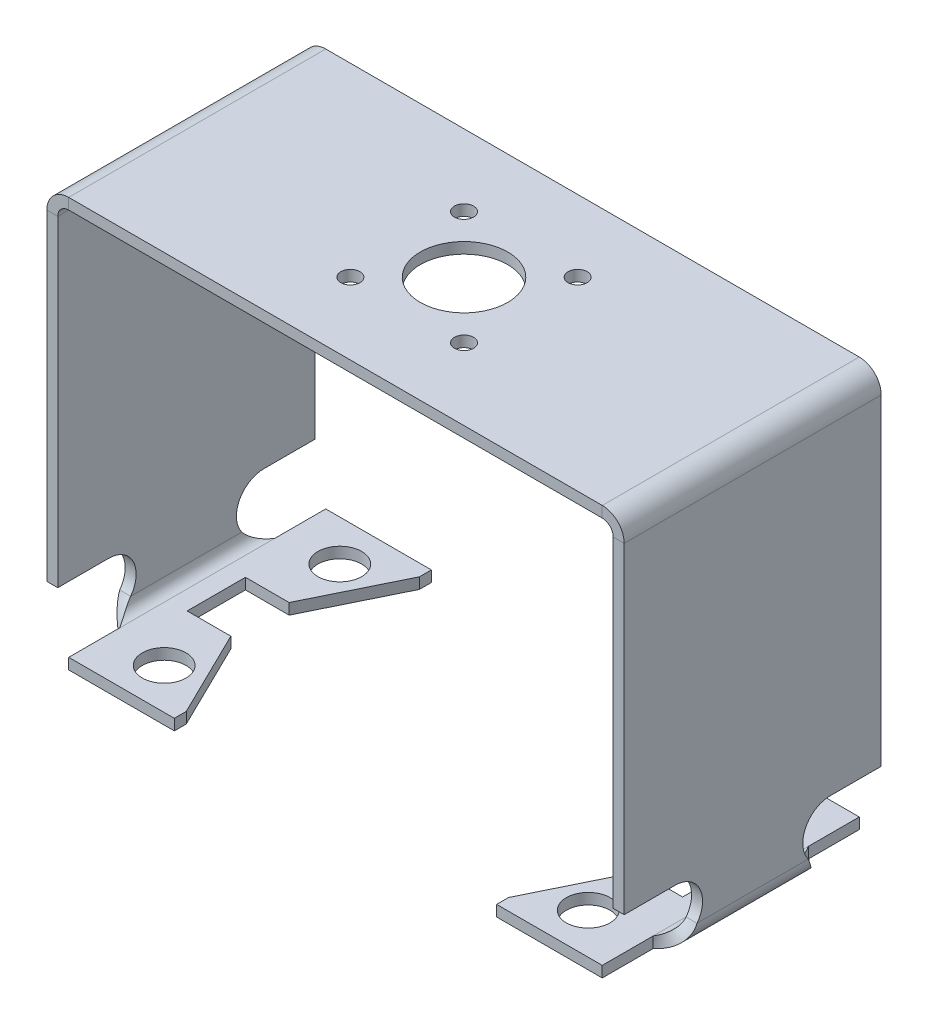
ISO-10303-21;
HEADER;
FILE_DESCRIPTION(('STEP AP214'),'2;1');
FILE_NAME('part.step','',(''),(''),'','','');
FILE_SCHEMA(('AUTOMOTIVE_DESIGN { 1 0 10303 214 1 1 1 1 }'));
ENDSEC;
DATA;
#1=APPLICATION_CONTEXT('core data for automotive mechanical design processes');
#2=APPLICATION_PROTOCOL_DEFINITION('international standard','automotive_design',2000,#1);
#3=PRODUCT_CONTEXT('',#1,'mechanical');
#4=PRODUCT('Part','Part','',(#3));
#5=PRODUCT_RELATED_PRODUCT_CATEGORY('part','',(#4));
#6=PRODUCT_DEFINITION_FORMATION('','',#4);
#7=PRODUCT_DEFINITION_CONTEXT('part definition',#1,'design');
#8=PRODUCT_DEFINITION('design','',#6,#7);
#9=PRODUCT_DEFINITION_SHAPE('','',#8);
#10=(LENGTH_UNIT() NAMED_UNIT(*) SI_UNIT(.MILLI.,.METRE.));
#11=(NAMED_UNIT(*) PLANE_ANGLE_UNIT() SI_UNIT($,.RADIAN.));
#12=(NAMED_UNIT(*) SI_UNIT($,.STERADIAN.) SOLID_ANGLE_UNIT());
#13=UNCERTAINTY_MEASURE_WITH_UNIT(LENGTH_MEASURE(1.E-05),#10,'distance_accuracy_value','');
#14=(GEOMETRIC_REPRESENTATION_CONTEXT(3) GLOBAL_UNCERTAINTY_ASSIGNED_CONTEXT((#13)) GLOBAL_UNIT_ASSIGNED_CONTEXT((#10,
#11,#12)) REPRESENTATION_CONTEXT('',''));
#15=CARTESIAN_POINT('',(0.,0.,0.));
#16=DIRECTION('',(0.,0.,1.));
#17=DIRECTION('',(1.,0.,0.));
#18=AXIS2_PLACEMENT_3D('',#15,#16,#17);
#19=CARTESIAN_POINT('',(-125.8062,0.,-56.007));
#20=DIRECTION('',(1.,0.,0.));
#21=DIRECTION('',(0.,1.,0.));
#22=AXIS2_PLACEMENT_3D('',#19,#20,#21);
#23=PLANE('',#22);
#24=DIRECTION('',(0.,0.,1.));
#25=VECTOR('',#24,1.);
#26=CARTESIAN_POINT('',(-125.8062,-144.932399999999,-56.007));
#27=LINE('',#26,#25);
#28=CARTESIAN_POINT('',(-125.8062,-144.932399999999,-56.007));
#29=VERTEX_POINT('',#28);
#30=CARTESIAN_POINT('',(-125.8062,-144.932399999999,-33.782));
#31=VERTEX_POINT('',#30);
#32=EDGE_CURVE('E462',#29,#31,#27,.T.);
#33=ORIENTED_EDGE('',*,*,#32,.T.);
#34=CARTESIAN_POINT('',(-125.806200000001,-156.870399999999,-33.782));
#35=DIRECTION('',(1.,0.,0.));
#36=DIRECTION('',(0.,1.,0.));
#37=AXIS2_PLACEMENT_3D('',#34,#35,#36);
#38=CIRCLE('',#37,11.938);
#39=CARTESIAN_POINT('',(-125.806200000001,-164.033199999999,-24.2316));
#40=VERTEX_POINT('',#39);
#41=EDGE_CURVE('E1737',#31,#40,#38,.T.);
#42=ORIENTED_EDGE('',*,*,#41,.T.);
#43=DIRECTION('',(0.,0.,-1.));
#44=VECTOR('',#43,1.);
#45=CARTESIAN_POINT('',(-125.806200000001,-164.033199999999,-56.007));
#46=LINE('',#45,#44);
#47=CARTESIAN_POINT('',(-125.806200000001,-164.033199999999,24.2316000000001));
#48=VERTEX_POINT('',#47);
#49=EDGE_CURVE('E363',#40,#48,#46,.F.);
#50=ORIENTED_EDGE('',*,*,#49,.T.);
#51=CARTESIAN_POINT('',(-125.806200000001,-156.870399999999,33.782));
#52=DIRECTION('',(1.,0.,0.));
#53=DIRECTION('',(0.,0.,1.));
#54=AXIS2_PLACEMENT_3D('',#51,#52,#53);
#55=CIRCLE('',#54,11.938);
#56=CARTESIAN_POINT('',(-125.806200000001,-144.932399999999,33.782));
#57=VERTEX_POINT('',#56);
#58=EDGE_CURVE('E1687',#48,#57,#55,.T.);
#59=ORIENTED_EDGE('',*,*,#58,.T.);
#60=DIRECTION('',(0.,0.,1.));
#61=VECTOR('',#60,1.);
#62=CARTESIAN_POINT('',(-125.806200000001,-144.932399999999,33.782));
#63=LINE('',#62,#61);
#64=CARTESIAN_POINT('',(-125.806200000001,-144.932399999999,56.007));
#65=VERTEX_POINT('',#64);
#66=EDGE_CURVE('E1690',#57,#65,#63,.T.);
#67=ORIENTED_EDGE('',*,*,#66,.T.);
#68=DIRECTION('',(0.,1.,0.));
#69=VECTOR('',#68,1.);
#70=CARTESIAN_POINT('',(-125.8062,0.,56.007));
#71=LINE('',#70,#69);
#72=CARTESIAN_POINT('',(-125.8062,-4.77519999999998,56.007));
#73=VERTEX_POINT('',#72);
#74=EDGE_CURVE('E381',#65,#73,#71,.T.);
#75=ORIENTED_EDGE('',*,*,#74,.T.);
#76=DIRECTION('',(0.,0.,1.));
#77=VECTOR('',#76,1.);
#78=CARTESIAN_POINT('',(-125.8062,-4.77519999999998,-56.007));
#79=LINE('',#78,#77);
#80=CARTESIAN_POINT('',(-125.8062,-4.77519999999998,-56.007));
#81=VERTEX_POINT('',#80);
#82=EDGE_CURVE('E372',#81,#73,#79,.T.);
#83=ORIENTED_EDGE('',*,*,#82,.F.);
#84=DIRECTION('',(0.,-1.,0.));
#85=VECTOR('',#84,1.);
#86=CARTESIAN_POINT('',(-125.806200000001,-168.808399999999,-56.007));
#87=LINE('',#86,#85);
#88=EDGE_CURVE('E378',#81,#29,#87,.T.);
#89=ORIENTED_EDGE('',*,*,#88,.T.);
#90=EDGE_LOOP('',(#33,#42,#50,#59,#67,#75,#83,#89));
#91=FACE_BOUND('',#90,.T.);
#92=ADVANCED_FACE('F32',(#91),#23,.F.);
#93=CARTESIAN_POINT('',(-121.031,0.,-56.007));
#94=DIRECTION('',(1.,0.,0.));
#95=DIRECTION('',(0.,1.,0.));
#96=AXIS2_PLACEMENT_3D('',#93,#94,#95);
#97=PLANE('',#96);
#98=CARTESIAN_POINT('',(-121.031000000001,-156.870399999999,-33.782));
#99=DIRECTION('',(1.,0.,0.));
#100=DIRECTION('',(0.,1.,0.));
#101=AXIS2_PLACEMENT_3D('',#98,#99,#100);
#102=CIRCLE('',#101,11.938);
#103=CARTESIAN_POINT('',(-121.031,-144.932399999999,-33.782));
#104=VERTEX_POINT('',#103);
#105=CARTESIAN_POINT('',(-121.031000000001,-164.033199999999,-24.2316));
#106=VERTEX_POINT('',#105);
#107=EDGE_CURVE('E1730',#104,#106,#102,.T.);
#108=ORIENTED_EDGE('',*,*,#107,.F.);
#109=DIRECTION('',(0.,0.,1.));
#110=VECTOR('',#109,1.);
#111=CARTESIAN_POINT('',(-121.031,-144.932399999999,-56.007));
#112=LINE('',#111,#110);
#113=CARTESIAN_POINT('',(-121.031000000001,-144.932399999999,-56.007));
#114=VERTEX_POINT('',#113);
#115=EDGE_CURVE('E531',#114,#104,#112,.T.);
#116=ORIENTED_EDGE('',*,*,#115,.F.);
#117=DIRECTION('',(0.,-1.,0.));
#118=VECTOR('',#117,1.);
#119=CARTESIAN_POINT('',(-121.031000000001,-168.808399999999,-56.007));
#120=LINE('',#119,#118);
#121=CARTESIAN_POINT('',(-121.031,-4.77519999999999,-56.007));
#122=VERTEX_POINT('',#121);
#123=EDGE_CURVE('E377',#122,#114,#120,.T.);
#124=ORIENTED_EDGE('',*,*,#123,.F.);
#125=DIRECTION('',(0.,0.,-1.));
#126=VECTOR('',#125,1.);
#127=CARTESIAN_POINT('',(-121.031,-4.77519999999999,56.007));
#128=LINE('',#127,#126);
#129=CARTESIAN_POINT('',(-121.031,-4.77519999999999,56.007));
#130=VERTEX_POINT('',#129);
#131=EDGE_CURVE('E367',#130,#122,#128,.T.);
#132=ORIENTED_EDGE('',*,*,#131,.F.);
#133=DIRECTION('',(0.,1.,0.));
#134=VECTOR('',#133,1.);
#135=CARTESIAN_POINT('',(-121.031,0.,56.007));
#136=LINE('',#135,#134);
#137=CARTESIAN_POINT('',(-121.031,-144.932399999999,56.007));
#138=VERTEX_POINT('',#137);
#139=EDGE_CURVE('E382',#138,#130,#136,.T.);
#140=ORIENTED_EDGE('',*,*,#139,.F.);
#141=DIRECTION('',(0.,0.,1.));
#142=VECTOR('',#141,1.);
#143=CARTESIAN_POINT('',(-121.031,-144.932399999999,-56.007));
#144=LINE('',#143,#142);
#145=CARTESIAN_POINT('',(-121.031,-144.932399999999,33.782));
#146=VERTEX_POINT('',#145);
#147=EDGE_CURVE('E447',#146,#138,#144,.T.);
#148=ORIENTED_EDGE('',*,*,#147,.F.);
#149=CARTESIAN_POINT('',(-121.031000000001,-156.870399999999,33.782));
#150=DIRECTION('',(1.,0.,0.));
#151=DIRECTION('',(0.,0.,-1.));
#152=AXIS2_PLACEMENT_3D('',#149,#150,#151);
#153=CIRCLE('',#152,11.938);
#154=CARTESIAN_POINT('',(-121.031000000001,-164.033199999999,24.2316000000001));
#155=VERTEX_POINT('',#154);
#156=EDGE_CURVE('E682',#155,#146,#153,.T.);
#157=ORIENTED_EDGE('',*,*,#156,.F.);
#158=DIRECTION('',(0.,0.,-1.));
#159=VECTOR('',#158,1.);
#160=CARTESIAN_POINT('',(-121.031000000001,-164.033199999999,-56.007));
#161=LINE('',#160,#159);
#162=EDGE_CURVE('E362',#106,#155,#161,.F.);
#163=ORIENTED_EDGE('',*,*,#162,.F.);
#164=EDGE_LOOP('',(#108,#116,#124,#132,#140,#148,#157,#163));
#165=FACE_BOUND('',#164,.T.);
#166=ADVANCED_FACE('F445',(#165),#97,.T.);
#167=CARTESIAN_POINT('',(-116.255800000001,-164.033199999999,-56.007));
#168=DIRECTION('',(0.,0.,-1.));
#169=DIRECTION('',(0.,-1.,0.));
#170=AXIS2_PLACEMENT_3D('',#167,#168,#169);
#171=CYLINDRICAL_SURFACE('',#170,9.55039999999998);
#172=ORIENTED_EDGE('',*,*,#49,.F.);
#173=CARTESIAN_POINT('',(-116.255800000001,-173.583599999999,-33.782));
#174=CARTESIAN_POINT('',(-116.575111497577,-173.583610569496,-33.5295588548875));
#175=CARTESIAN_POINT('',(-116.894438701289,-173.567586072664,-33.2771216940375));
#176=CARTESIAN_POINT('',(-117.530594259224,-173.503532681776,-32.773073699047));
#177=CARTESIAN_POINT('',(-117.847422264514,-173.455499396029,-32.5214629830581));
#178=CARTESIAN_POINT('',(-118.477220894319,-173.327237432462,-32.0189500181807));
#179=CARTESIAN_POINT('',(-118.790170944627,-173.246880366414,-31.7680546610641));
#180=CARTESIAN_POINT('',(-119.408252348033,-173.054118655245,-31.2689485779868));
#181=CARTESIAN_POINT('',(-119.713383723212,-172.941714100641,-31.0207378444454));
#182=CARTESIAN_POINT('',(-120.329916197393,-172.677873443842,-30.5140356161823));
#183=CARTESIAN_POINT('',(-120.64070362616,-172.524596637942,-30.2557517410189));
#184=CARTESIAN_POINT('',(-121.246942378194,-172.183026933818,-29.7443990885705));
#185=CARTESIAN_POINT('',(-121.542394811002,-171.994736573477,-29.4913299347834));
#186=CARTESIAN_POINT('',(-122.114127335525,-171.583957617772,-28.9918896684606));
#187=CARTESIAN_POINT('',(-122.390422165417,-171.361495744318,-28.7455134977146));
#188=CARTESIAN_POINT('',(-122.920147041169,-170.883301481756,-28.2605776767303));
#189=CARTESIAN_POINT('',(-123.173580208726,-170.627573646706,-28.0220169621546));
#190=CARTESIAN_POINT('',(-123.634530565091,-170.105757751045,-27.5726039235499));
#191=CARTESIAN_POINT('',(-123.844092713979,-169.842077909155,-27.361050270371));
#192=CARTESIAN_POINT('',(-124.237020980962,-169.289167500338,-26.9469108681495));
#193=CARTESIAN_POINT('',(-124.42038597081,-168.999935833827,-26.7443255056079));
#194=CARTESIAN_POINT('',(-124.672880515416,-168.549008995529,-26.448401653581));
#195=CARTESIAN_POINT('',(-124.75321682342,-168.396016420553,-26.3511801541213));
#196=CARTESIAN_POINT('',(-124.906075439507,-168.08449141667,-26.1594558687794));
#197=CARTESIAN_POINT('',(-124.978597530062,-167.925958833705,-26.0649531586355));
#198=CARTESIAN_POINT('',(-125.115344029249,-167.603806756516,-25.8788090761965));
#199=CARTESIAN_POINT('',(-125.179571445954,-167.440189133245,-25.7871666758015));
#200=CARTESIAN_POINT('',(-125.29932861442,-167.1082390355,-25.606837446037));
#201=CARTESIAN_POINT('',(-125.354859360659,-166.939907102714,-25.5181502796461));
#202=CARTESIAN_POINT('',(-125.470629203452,-166.552758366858,-25.3203466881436));
#203=CARTESIAN_POINT('',(-125.528077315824,-166.332604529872,-25.212194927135));
#204=CARTESIAN_POINT('',(-125.627459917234,-165.886404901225,-25.0012686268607));
#205=CARTESIAN_POINT('',(-125.669400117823,-165.660361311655,-24.8984921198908));
#206=CARTESIAN_POINT('',(-125.7371261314,-165.202880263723,-24.6982962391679));
#207=CARTESIAN_POINT('',(-125.762874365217,-164.97143154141,-24.6008898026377));
#208=CARTESIAN_POINT('',(-125.797426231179,-164.50477921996,-24.4118453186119));
#209=CARTESIAN_POINT('',(-125.806219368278,-164.269573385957,-24.3202108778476));
#210=CARTESIAN_POINT('',(-125.806200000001,-164.033199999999,-24.2316));
#211=B_SPLINE_CURVE_WITH_KNOTS('',3,(#173,#174,#175,#176,#177,#178,#179,#180,#181,#182,#183,
#184,#185,#186,#187,#188,#189,#190,#191,#192,#193,#194,#195,#196,#197,#198,#199,#200,#201,#202,
#203,#204,#205,#206,#207,#208,#209,#210),.UNSPECIFIED.,.F.,.F.,(4,2,2,2,2,2,2,2,2,2,2,2,2,2,2,2,
2,2,4),(0.,1.22083875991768,2.44184505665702,3.66774977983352,4.89365104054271,6.18854800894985,
7.48335115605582,8.77714688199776,10.070765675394,11.2623476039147,12.4539808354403,
13.0485988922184,13.6432334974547,14.2376518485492,14.8320021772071,15.5871569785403,
16.3420333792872,17.0986553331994,17.8557454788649),.UNSPECIFIED.);
#212=CARTESIAN_POINT('',(-116.255800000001,-173.583599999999,-33.782));
#213=VERTEX_POINT('',#212);
#214=EDGE_CURVE('E525',#213,#40,#211,.T.);
#215=ORIENTED_EDGE('',*,*,#214,.F.);
#216=DIRECTION('',(0.,0.,1.));
#217=VECTOR('',#216,1.);
#218=CARTESIAN_POINT('',(-116.255800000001,-173.583599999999,-56.007));
#219=LINE('',#218,#217);
#220=CARTESIAN_POINT('',(-116.255800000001,-173.583599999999,33.782));
#221=VERTEX_POINT('',#220);
#222=EDGE_CURVE('E324',#213,#221,#219,.T.);
#223=ORIENTED_EDGE('',*,*,#222,.T.);
#224=CARTESIAN_POINT('',(-125.806200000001,-164.033199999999,24.2316));
#225=CARTESIAN_POINT('',(-125.806229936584,-164.312370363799,24.3362734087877));
#226=CARTESIAN_POINT('',(-125.793962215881,-164.589829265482,24.4453031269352));
#227=CARTESIAN_POINT('',(-125.745938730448,-165.139196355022,24.6714352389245));
#228=CARTESIAN_POINT('',(-125.71019651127,-165.411107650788,24.7885329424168));
#229=CARTESIAN_POINT('',(-125.61653756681,-165.946385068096,25.0297454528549));
#230=CARTESIAN_POINT('',(-125.558720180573,-166.209783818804,25.1538267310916));
#231=CARTESIAN_POINT('',(-125.422145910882,-166.727629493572,25.409004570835));
#232=CARTESIAN_POINT('',(-125.343386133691,-166.982075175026,25.5401020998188));
#233=CARTESIAN_POINT('',(-125.164885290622,-167.484355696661,25.8110103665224));
#234=CARTESIAN_POINT('',(-125.064833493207,-167.732023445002,25.9509257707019));
#235=CARTESIAN_POINT('',(-124.84611555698,-168.214935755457,26.237426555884));
#236=CARTESIAN_POINT('',(-124.727449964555,-168.450180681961,26.3840117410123));
#237=CARTESIAN_POINT('',(-124.472853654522,-168.907491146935,26.6832337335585));
#238=CARTESIAN_POINT('',(-124.336905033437,-169.129542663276,26.8358767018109));
#239=CARTESIAN_POINT('',(-124.049350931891,-169.559279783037,27.1465391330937));
#240=CARTESIAN_POINT('',(-123.89774442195,-169.766964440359,27.3045589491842));
#241=CARTESIAN_POINT('',(-123.561431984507,-170.191090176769,27.6446449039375));
#242=CARTESIAN_POINT('',(-123.374935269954,-170.405616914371,27.8273297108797));
#243=CARTESIAN_POINT('',(-122.986144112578,-170.814964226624,28.198104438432));
#244=CARTESIAN_POINT('',(-122.78384280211,-171.009776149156,28.3861966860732));
#245=CARTESIAN_POINT('',(-122.365437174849,-171.378970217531,28.7671506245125));
#246=CARTESIAN_POINT('',(-122.149329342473,-171.553347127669,28.9600135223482));
#247=CARTESIAN_POINT('',(-121.705211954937,-171.881144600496,29.3498157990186));
#248=CARTESIAN_POINT('',(-121.477201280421,-172.034563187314,29.5467555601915));
#249=CARTESIAN_POINT('',(-120.98105594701,-172.338455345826,29.9696880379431));
#250=CARTESIAN_POINT('',(-120.711534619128,-172.486007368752,30.1961571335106));
#251=CARTESIAN_POINT('',(-120.161993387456,-172.753590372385,30.6526486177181));
#252=CARTESIAN_POINT('',(-119.881971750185,-172.873616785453,30.8826715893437));
#253=CARTESIAN_POINT('',(-119.313958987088,-173.085806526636,31.3453970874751));
#254=CARTESIAN_POINT('',(-119.025971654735,-173.177982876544,31.5780983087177));
#255=CARTESIAN_POINT('',(-118.444190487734,-173.334371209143,32.0454258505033));
#256=CARTESIAN_POINT('',(-118.150398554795,-173.39859219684,32.2800515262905));
#257=CARTESIAN_POINT('',(-117.589969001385,-173.493763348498,32.7259610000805));
#258=CARTESIAN_POINT('',(-117.323700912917,-173.527488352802,32.9371226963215));
#259=CARTESIAN_POINT('',(-116.79021930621,-173.572385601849,33.3595192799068));
#260=CARTESIAN_POINT('',(-116.523008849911,-173.583603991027,33.5707531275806));
#261=CARTESIAN_POINT('',(-116.255800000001,-173.583599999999,33.782));
#262=B_SPLINE_CURVE_WITH_KNOTS('',3,(#224,#225,#226,#227,#228,#229,#230,#231,#232,#233,#234,
#235,#236,#237,#238,#239,#240,#241,#242,#243,#244,#245,#246,#247,#248,#249,#250,#251,#252,#253,
#254,#255,#256,#257,#258,#259,#260,#261),.UNSPECIFIED.,.F.,.F.,(4,2,2,2,2,2,2,2,2,2,2,2,2,2,2,2,
2,2,4),(0.,0.894050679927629,1.78758591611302,2.67714671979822,3.56683050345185,4.470517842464,
5.37417865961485,6.27878332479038,7.18344750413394,8.19610711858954,9.20920924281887,
10.2225703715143,11.236026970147,12.3799476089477,13.5240579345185,14.6676324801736,
15.8108383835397,16.8346167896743,17.8562940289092),.UNSPECIFIED.);
#263=EDGE_CURVE('E670',#48,#221,#262,.T.);
#264=ORIENTED_EDGE('',*,*,#263,.F.);
#265=EDGE_LOOP('',(#172,#215,#223,#264));
#266=FACE_BOUND('',#265,.T.);
#267=ADVANCED_FACE('F842',(#266),#171,.T.);
#268=CARTESIAN_POINT('',(-116.255800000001,-164.033199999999,-56.007));
#269=DIRECTION('',(0.,0.,-1.));
#270=DIRECTION('',(0.,-1.,0.));
#271=AXIS2_PLACEMENT_3D('',#268,#269,#270);
#272=CYLINDRICAL_SURFACE('',#271,4.77519999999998);
#273=CARTESIAN_POINT('',(-116.255800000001,-168.808399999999,-33.782));
#274=CARTESIAN_POINT('',(-116.398986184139,-168.808389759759,-33.5555995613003));
#275=CARTESIAN_POINT('',(-116.542181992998,-168.801959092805,-33.3291984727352));
#276=CARTESIAN_POINT('',(-116.827998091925,-168.776169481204,-32.8764759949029));
#277=CARTESIAN_POINT('',(-116.970617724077,-168.756798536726,-32.6501548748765));
#278=CARTESIAN_POINT('',(-117.25446873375,-168.70503143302,-32.1980141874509));
#279=CARTESIAN_POINT('',(-117.395699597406,-168.672630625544,-31.9721948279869));
#280=CARTESIAN_POINT('',(-117.677164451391,-168.594316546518,-31.5195218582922));
#281=CARTESIAN_POINT('',(-117.817379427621,-168.548289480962,-31.292676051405));
#282=CARTESIAN_POINT('',(-118.094696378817,-168.442621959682,-30.8403393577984));
#283=CARTESIAN_POINT('',(-118.231799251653,-168.382985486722,-30.6148480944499));
#284=CARTESIAN_POINT('',(-118.501912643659,-168.249855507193,-30.1655891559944));
#285=CARTESIAN_POINT('',(-118.634924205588,-168.176365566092,-29.9418210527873));
#286=CARTESIAN_POINT('',(-118.916971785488,-168.002134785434,-29.4604051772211));
#287=CARTESIAN_POINT('',(-119.065121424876,-167.898909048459,-29.2031294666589));
#288=CARTESIAN_POINT('',(-119.352613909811,-167.672669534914,-28.692321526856));
#289=CARTESIAN_POINT('',(-119.491956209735,-167.549654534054,-28.4387895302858));
#290=CARTESIAN_POINT('',(-119.759187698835,-167.283479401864,-27.9370185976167));
#291=CARTESIAN_POINT('',(-119.887098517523,-167.140358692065,-27.6887703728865));
#292=CARTESIAN_POINT('',(-120.128890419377,-166.833179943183,-27.1984924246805));
#293=CARTESIAN_POINT('',(-120.242776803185,-166.669129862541,-26.9564603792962));
#294=CARTESIAN_POINT('',(-120.42371296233,-166.368299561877,-26.5465722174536));
#295=CARTESIAN_POINT('',(-120.494977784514,-166.236632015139,-26.3768148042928));
#296=CARTESIAN_POINT('',(-120.626764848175,-165.962029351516,-26.0422266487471));
#297=CARTESIAN_POINT('',(-120.687286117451,-165.81909321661,-25.8773963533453));
#298=CARTESIAN_POINT('',(-120.795474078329,-165.522734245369,-25.5540758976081));
#299=CARTESIAN_POINT('',(-120.843183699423,-165.36934864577,-25.3955661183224));
#300=CARTESIAN_POINT('',(-120.923914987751,-165.052021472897,-25.0856386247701));
#301=CARTESIAN_POINT('',(-120.956946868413,-164.88808733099,-24.9342160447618));
#302=CARTESIAN_POINT('',(-120.997479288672,-164.608924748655,-24.6906241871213));
#303=CARTESIAN_POINT('',(-121.009859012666,-164.496464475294,-24.5960773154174));
#304=CARTESIAN_POINT('',(-121.026621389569,-164.26764139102,-24.410825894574));
#305=CARTESIAN_POINT('',(-121.030994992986,-164.151274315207,-24.3201258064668));
#306=CARTESIAN_POINT('',(-121.031000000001,-164.033199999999,-24.2316));
#307=B_SPLINE_CURVE_WITH_KNOTS('',3,(#273,#274,#275,#276,#277,#278,#279,#280,#281,#282,#283,
#284,#285,#286,#287,#288,#289,#290,#291,#292,#293,#294,#295,#296,#297,#298,#299,#300,#301,#302,
#303,#304,#305,#306),.UNSPECIFIED.,.F.,.F.,(4,2,2,2,2,2,2,2,2,2,2,2,2,2,2,2,4),(0.,
0.803570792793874,1.60788779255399,2.41249197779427,3.2240147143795,4.03530026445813,
4.84637729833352,5.78859630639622,6.73087362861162,7.67132855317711,8.61142692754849,
9.2899539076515,9.96854225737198,10.6448275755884,11.3206415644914,11.7626782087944,
12.2052141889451),.UNSPECIFIED.);
#308=CARTESIAN_POINT('',(-116.255800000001,-168.808399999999,-33.782));
#309=VERTEX_POINT('',#308);
#310=EDGE_CURVE('E515',#309,#106,#307,.T.);
#311=ORIENTED_EDGE('',*,*,#310,.T.);
#312=ORIENTED_EDGE('',*,*,#162,.T.);
#313=CARTESIAN_POINT('',(-121.031000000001,-164.033199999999,24.2316));
#314=CARTESIAN_POINT('',(-121.030971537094,-164.196511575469,24.3540858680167));
#315=CARTESIAN_POINT('',(-121.022626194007,-164.35641955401,24.4808277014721));
#316=CARTESIAN_POINT('',(-120.991157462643,-164.66844055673,24.7413692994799));
#317=CARTESIAN_POINT('',(-120.96805867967,-164.82056610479,24.8751569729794));
#318=CARTESIAN_POINT('',(-120.909205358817,-165.115186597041,25.1474617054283));
#319=CARTESIAN_POINT('',(-120.873572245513,-165.257758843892,25.2859222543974));
#320=CARTESIAN_POINT('',(-120.791166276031,-165.534479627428,25.567996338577));
#321=CARTESIAN_POINT('',(-120.744387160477,-165.66862337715,25.7116127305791));
#322=CARTESIAN_POINT('',(-120.656116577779,-165.890506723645,25.9610833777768));
#323=CARTESIAN_POINT('',(-120.617009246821,-165.980445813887,26.0658450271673));
#324=CARTESIAN_POINT('',(-120.534442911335,-166.155732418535,26.2774911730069));
#325=CARTESIAN_POINT('',(-120.490983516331,-166.241079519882,26.384375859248));
#326=CARTESIAN_POINT('',(-120.400091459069,-166.407300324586,26.5999454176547));
#327=CARTESIAN_POINT('',(-120.352658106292,-166.488173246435,26.7086306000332));
#328=CARTESIAN_POINT('',(-120.254219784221,-166.645436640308,26.9275968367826));
#329=CARTESIAN_POINT('',(-120.203214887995,-166.721827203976,27.0378778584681));
#330=CARTESIAN_POINT('',(-120.044790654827,-166.945164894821,27.3720923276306));
#331=CARTESIAN_POINT('',(-119.932457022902,-167.085386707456,27.598237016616));
#332=CARTESIAN_POINT('',(-119.697250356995,-167.348327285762,28.055056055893));
#333=CARTESIAN_POINT('',(-119.57437715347,-167.471045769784,28.2857304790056));
#334=CARTESIAN_POINT('',(-119.267161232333,-167.747073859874,28.8475768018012));
#335=CARTESIAN_POINT('',(-119.078521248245,-167.891854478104,29.180613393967));
#336=CARTESIAN_POINT('',(-118.688791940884,-168.148730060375,29.852042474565));
#337=CARTESIAN_POINT('',(-118.487696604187,-168.260809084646,30.1904374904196));
#338=CARTESIAN_POINT('',(-118.077075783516,-168.453245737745,30.8703120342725));
#339=CARTESIAN_POINT('',(-117.867563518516,-168.533651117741,31.2117861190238));
#340=CARTESIAN_POINT('',(-117.443048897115,-168.663776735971,31.8969118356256));
#341=CARTESIAN_POINT('',(-117.228049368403,-168.713512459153,32.2405622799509));
#342=CARTESIAN_POINT('',(-116.886149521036,-168.768317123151,32.7842540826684));
#343=CARTESIAN_POINT('',(-116.760203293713,-168.783373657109,32.9839445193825));
#344=CARTESIAN_POINT('',(-116.508104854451,-168.80340097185,33.3830830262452));
#345=CARTESIAN_POINT('',(-116.381953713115,-168.808393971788,33.5825306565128));
#346=CARTESIAN_POINT('',(-116.255800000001,-168.808399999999,33.782));
#347=B_SPLINE_CURVE_WITH_KNOTS('',3,(#313,#314,#315,#316,#317,#318,#319,#320,#321,#322,#323,
#324,#325,#326,#327,#328,#329,#330,#331,#332,#333,#334,#335,#336,#337,#338,#339,#340,#341,#342,
#343,#344,#345,#346),.UNSPECIFIED.,.F.,.F.,(4,2,2,2,2,2,2,2,2,2,2,2,2,2,2,2,4),(0.,
0.611938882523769,1.22285984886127,1.82801858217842,2.433517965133,2.86388256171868,
3.29428580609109,3.72476399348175,4.15523337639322,5.02079236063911,5.88636527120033,
7.11223096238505,8.33869318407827,9.56329925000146,10.7872865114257,11.4968045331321,
12.2047542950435),.UNSPECIFIED.);
#348=CARTESIAN_POINT('',(-116.255800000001,-168.808399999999,33.782));
#349=VERTEX_POINT('',#348);
#350=EDGE_CURVE('E518',#155,#349,#347,.T.);
#351=ORIENTED_EDGE('',*,*,#350,.T.);
#352=DIRECTION('',(0.,0.,-1.));
#353=VECTOR('',#352,1.);
#354=CARTESIAN_POINT('',(-116.255800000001,-168.808399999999,56.007));
#355=LINE('',#354,#353);
#356=EDGE_CURVE('E505',#349,#309,#355,.T.);
#357=ORIENTED_EDGE('',*,*,#356,.T.);
#358=EDGE_LOOP('',(#311,#312,#351,#357));
#359=FACE_BOUND('',#358,.T.);
#360=ADVANCED_FACE('F514',(#359),#272,.F.);
#361=CARTESIAN_POINT('',(-125.806200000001,-168.808399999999,-56.007));
#362=DIRECTION('',(0.,0.,1.));
#363=DIRECTION('',(0.,-1.,0.));
#364=AXIS2_PLACEMENT_3D('',#361,#362,#363);
#365=PLANE('',#364);
#366=DIRECTION('',(1.,0.,0.));
#367=VECTOR('',#366,1.);
#368=CARTESIAN_POINT('',(-121.031000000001,-144.932399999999,-56.007));
#369=LINE('',#368,#367);
#370=EDGE_CURVE('E458',#114,#29,#369,.F.);
#371=ORIENTED_EDGE('',*,*,#370,.T.);
#372=ORIENTED_EDGE('',*,*,#88,.F.);
#373=DIRECTION('',(-1.,0.,0.));
#374=VECTOR('',#373,1.);
#375=CARTESIAN_POINT('',(-121.031,-4.77519999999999,-56.007));
#376=LINE('',#375,#374);
#377=EDGE_CURVE('E369',#122,#81,#376,.T.);
#378=ORIENTED_EDGE('',*,*,#377,.F.);
#379=ORIENTED_EDGE('',*,*,#123,.T.);
#380=EDGE_LOOP('',(#371,#372,#378,#379));
#381=FACE_BOUND('',#380,.T.);
#382=ADVANCED_FACE('F457',(#381),#365,.F.);
#383=CARTESIAN_POINT('',(125.8062,0.,-56.007));
#384=DIRECTION('',(-1.,0.,0.));
#385=DIRECTION('',(0.,1.,0.));
#386=AXIS2_PLACEMENT_3D('',#383,#384,#385);
#387=PLANE('',#386);
#388=DIRECTION('',(0.,0.,-1.));
#389=VECTOR('',#388,1.);
#390=CARTESIAN_POINT('',(125.8062,-144.932399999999,-56.007));
#391=LINE('',#390,#389);
#392=CARTESIAN_POINT('',(125.8062,-144.932399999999,56.007));
#393=VERTEX_POINT('',#392);
#394=CARTESIAN_POINT('',(125.8062,-144.932399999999,33.782));
#395=VERTEX_POINT('',#394);
#396=EDGE_CURVE('E599',#393,#395,#391,.T.);
#397=ORIENTED_EDGE('',*,*,#396,.T.);
#398=CARTESIAN_POINT('',(125.806200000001,-156.870399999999,33.782));
#399=DIRECTION('',(-1.,0.,0.));
#400=DIRECTION('',(0.,-1.,0.));
#401=AXIS2_PLACEMENT_3D('',#398,#399,#400);
#402=CIRCLE('',#401,11.938);
#403=CARTESIAN_POINT('',(125.806200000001,-164.033199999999,24.2316));
#404=VERTEX_POINT('',#403);
#405=EDGE_CURVE('E1761',#395,#404,#402,.T.);
#406=ORIENTED_EDGE('',*,*,#405,.T.);
#407=DIRECTION('',(0.,0.,1.));
#408=VECTOR('',#407,1.);
#409=CARTESIAN_POINT('',(125.806200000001,-164.033199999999,56.007));
#410=LINE('',#409,#408);
#411=CARTESIAN_POINT('',(125.806200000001,-164.033199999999,-24.2316000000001));
#412=VERTEX_POINT('',#411);
#413=EDGE_CURVE('E1639',#404,#412,#410,.F.);
#414=ORIENTED_EDGE('',*,*,#413,.T.);
#415=CARTESIAN_POINT('',(125.806200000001,-156.870399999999,-33.782));
#416=DIRECTION('',(1.,0.,0.));
#417=DIRECTION('',(0.,0.,-1.));
#418=AXIS2_PLACEMENT_3D('',#415,#416,#417);
#419=CIRCLE('',#418,11.938);
#420=CARTESIAN_POINT('',(125.806200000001,-144.932399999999,-33.782));
#421=VERTEX_POINT('',#420);
#422=EDGE_CURVE('E1669',#421,#412,#419,.T.);
#423=ORIENTED_EDGE('',*,*,#422,.F.);
#424=DIRECTION('',(0.,0.,1.));
#425=VECTOR('',#424,1.);
#426=CARTESIAN_POINT('',(125.806200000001,-144.932399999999,-33.782));
#427=LINE('',#426,#425);
#428=CARTESIAN_POINT('',(125.806200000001,-144.932399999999,-56.007));
#429=VERTEX_POINT('',#428);
#430=EDGE_CURVE('E1667',#429,#421,#427,.T.);
#431=ORIENTED_EDGE('',*,*,#430,.F.);
#432=DIRECTION('',(0.,-1.,0.));
#433=VECTOR('',#432,1.);
#434=CARTESIAN_POINT('',(125.806200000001,-168.808399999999,-56.007));
#435=LINE('',#434,#433);
#436=CARTESIAN_POINT('',(125.8062,-4.77519999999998,-56.007));
#437=VERTEX_POINT('',#436);
#438=EDGE_CURVE('E1651',#437,#429,#435,.T.);
#439=ORIENTED_EDGE('',*,*,#438,.F.);
#440=DIRECTION('',(0.,0.,-1.));
#441=VECTOR('',#440,1.);
#442=CARTESIAN_POINT('',(125.8062,-4.77519999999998,-56.007));
#443=LINE('',#442,#441);
#444=CARTESIAN_POINT('',(125.8062,-4.77519999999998,56.007));
#445=VERTEX_POINT('',#444);
#446=EDGE_CURVE('E1647',#445,#437,#443,.T.);
#447=ORIENTED_EDGE('',*,*,#446,.F.);
#448=DIRECTION('',(0.,1.,0.));
#449=VECTOR('',#448,1.);
#450=CARTESIAN_POINT('',(125.8062,0.,56.007));
#451=LINE('',#450,#449);
#452=EDGE_CURVE('E499',#393,#445,#451,.T.);
#453=ORIENTED_EDGE('',*,*,#452,.F.);
#454=EDGE_LOOP('',(#397,#406,#414,#423,#431,#439,#447,#453));
#455=FACE_BOUND('',#454,.T.);
#456=ADVANCED_FACE('F801',(#455),#387,.F.);
#457=CARTESIAN_POINT('',(121.031,0.,-56.007));
#458=DIRECTION('',(-1.,0.,0.));
#459=DIRECTION('',(0.,1.,0.));
#460=AXIS2_PLACEMENT_3D('',#457,#458,#459);
#461=PLANE('',#460);
#462=CARTESIAN_POINT('',(121.031000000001,-156.870399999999,33.782));
#463=DIRECTION('',(-1.,0.,0.));
#464=DIRECTION('',(0.,-1.,0.));
#465=AXIS2_PLACEMENT_3D('',#462,#463,#464);
#466=CIRCLE('',#465,11.938);
#467=CARTESIAN_POINT('',(121.031000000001,-144.932399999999,33.782));
#468=VERTEX_POINT('',#467);
#469=CARTESIAN_POINT('',(121.031000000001,-164.033199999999,24.2316000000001));
#470=VERTEX_POINT('',#469);
#471=EDGE_CURVE('E1753',#468,#470,#466,.T.);
#472=ORIENTED_EDGE('',*,*,#471,.F.);
#473=DIRECTION('',(0.,0.,-1.));
#474=VECTOR('',#473,1.);
#475=CARTESIAN_POINT('',(121.031,-144.932399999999,-56.007));
#476=LINE('',#475,#474);
#477=CARTESIAN_POINT('',(121.031000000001,-144.932399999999,56.007));
#478=VERTEX_POINT('',#477);
#479=EDGE_CURVE('E1750',#478,#468,#476,.T.);
#480=ORIENTED_EDGE('',*,*,#479,.F.);
#481=DIRECTION('',(0.,1.,0.));
#482=VECTOR('',#481,1.);
#483=CARTESIAN_POINT('',(121.031,0.,56.007));
#484=LINE('',#483,#482);
#485=CARTESIAN_POINT('',(121.031,-4.77519999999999,56.007));
#486=VERTEX_POINT('',#485);
#487=EDGE_CURVE('E1654',#478,#486,#484,.T.);
#488=ORIENTED_EDGE('',*,*,#487,.T.);
#489=DIRECTION('',(0.,0.,1.));
#490=VECTOR('',#489,1.);
#491=CARTESIAN_POINT('',(121.031,-4.77519999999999,-56.007));
#492=LINE('',#491,#490);
#493=CARTESIAN_POINT('',(121.031,-4.77519999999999,-56.007));
#494=VERTEX_POINT('',#493);
#495=EDGE_CURVE('E1642',#494,#486,#492,.T.);
#496=ORIENTED_EDGE('',*,*,#495,.F.);
#497=DIRECTION('',(0.,-1.,0.));
#498=VECTOR('',#497,1.);
#499=CARTESIAN_POINT('',(121.031000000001,-168.808399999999,-56.007));
#500=LINE('',#499,#498);
#501=CARTESIAN_POINT('',(121.031,-144.932399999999,-56.007));
#502=VERTEX_POINT('',#501);
#503=EDGE_CURVE('E1650',#494,#502,#500,.T.);
#504=ORIENTED_EDGE('',*,*,#503,.T.);
#505=DIRECTION('',(0.,0.,-1.));
#506=VECTOR('',#505,1.);
#507=CARTESIAN_POINT('',(121.031,-144.932399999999,-56.007));
#508=LINE('',#507,#506);
#509=CARTESIAN_POINT('',(121.031,-144.932399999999,-33.782));
#510=VERTEX_POINT('',#509);
#511=EDGE_CURVE('E1674',#502,#510,#508,.F.);
#512=ORIENTED_EDGE('',*,*,#511,.T.);
#513=CARTESIAN_POINT('',(121.031000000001,-156.870399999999,-33.782));
#514=DIRECTION('',(1.,0.,0.));
#515=DIRECTION('',(0.,0.,-1.));
#516=AXIS2_PLACEMENT_3D('',#513,#514,#515);
#517=CIRCLE('',#516,11.938);
#518=CARTESIAN_POINT('',(121.031000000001,-164.033199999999,-24.2316000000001));
#519=VERTEX_POINT('',#518);
#520=EDGE_CURVE('E641',#510,#519,#517,.T.);
#521=ORIENTED_EDGE('',*,*,#520,.T.);
#522=DIRECTION('',(0.,0.,1.));
#523=VECTOR('',#522,1.);
#524=CARTESIAN_POINT('',(121.031000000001,-164.033199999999,56.007));
#525=LINE('',#524,#523);
#526=EDGE_CURVE('E1638',#470,#519,#525,.F.);
#527=ORIENTED_EDGE('',*,*,#526,.F.);
#528=EDGE_LOOP('',(#472,#480,#488,#496,#504,#512,#521,#527));
#529=FACE_BOUND('',#528,.T.);
#530=ADVANCED_FACE('F795',(#529),#461,.T.);
#531=CARTESIAN_POINT('',(116.255800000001,-164.033199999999,56.007));
#532=DIRECTION('',(0.,0.,1.));
#533=DIRECTION('',(0.,-1.,0.));
#534=AXIS2_PLACEMENT_3D('',#531,#532,#533);
#535=CYLINDRICAL_SURFACE('',#534,9.55039999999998);
#536=ORIENTED_EDGE('',*,*,#413,.F.);
#537=CARTESIAN_POINT('',(116.255800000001,-173.583599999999,33.782));
#538=CARTESIAN_POINT('',(116.575111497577,-173.583610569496,33.5295588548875));
#539=CARTESIAN_POINT('',(116.894438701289,-173.567586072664,33.2771216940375));
#540=CARTESIAN_POINT('',(117.530594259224,-173.503532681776,32.773073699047));
#541=CARTESIAN_POINT('',(117.847422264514,-173.455499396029,32.5214629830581));
#542=CARTESIAN_POINT('',(118.477220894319,-173.327237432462,32.0189500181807));
#543=CARTESIAN_POINT('',(118.790170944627,-173.246880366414,31.7680546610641));
#544=CARTESIAN_POINT('',(119.408252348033,-173.054118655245,31.2689485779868));
#545=CARTESIAN_POINT('',(119.713383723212,-172.941714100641,31.0207378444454));
#546=CARTESIAN_POINT('',(120.329916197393,-172.677873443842,30.5140356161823));
#547=CARTESIAN_POINT('',(120.64070362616,-172.524596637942,30.2557517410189));
#548=CARTESIAN_POINT('',(121.246942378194,-172.183026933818,29.7443990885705));
#549=CARTESIAN_POINT('',(121.542394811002,-171.994736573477,29.4913299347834));
#550=CARTESIAN_POINT('',(122.114127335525,-171.583957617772,28.9918896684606));
#551=CARTESIAN_POINT('',(122.390422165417,-171.361495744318,28.7455134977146));
#552=CARTESIAN_POINT('',(122.920147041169,-170.883301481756,28.2605776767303));
#553=CARTESIAN_POINT('',(123.173580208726,-170.627573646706,28.0220169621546));
#554=CARTESIAN_POINT('',(123.634530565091,-170.105757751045,27.5726039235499));
#555=CARTESIAN_POINT('',(123.844092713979,-169.842077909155,27.361050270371));
#556=CARTESIAN_POINT('',(124.237020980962,-169.289167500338,26.9469108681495));
#557=CARTESIAN_POINT('',(124.42038597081,-168.999935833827,26.7443255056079));
#558=CARTESIAN_POINT('',(124.672880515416,-168.549008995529,26.448401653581));
#559=CARTESIAN_POINT('',(124.75321682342,-168.396016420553,26.3511801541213));
#560=CARTESIAN_POINT('',(124.906075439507,-168.08449141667,26.1594558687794));
#561=CARTESIAN_POINT('',(124.978597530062,-167.925958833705,26.0649531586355));
#562=CARTESIAN_POINT('',(125.115344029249,-167.603806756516,25.8788090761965));
#563=CARTESIAN_POINT('',(125.179571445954,-167.440189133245,25.7871666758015));
#564=CARTESIAN_POINT('',(125.29932861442,-167.1082390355,25.606837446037));
#565=CARTESIAN_POINT('',(125.354859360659,-166.939907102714,25.5181502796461));
#566=CARTESIAN_POINT('',(125.470629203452,-166.552758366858,25.3203466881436));
#567=CARTESIAN_POINT('',(125.528077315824,-166.332604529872,25.212194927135));
#568=CARTESIAN_POINT('',(125.627459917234,-165.886404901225,25.0012686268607));
#569=CARTESIAN_POINT('',(125.669400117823,-165.660361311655,24.8984921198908));
#570=CARTESIAN_POINT('',(125.7371261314,-165.202880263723,24.6982962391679));
#571=CARTESIAN_POINT('',(125.762874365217,-164.97143154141,24.6008898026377));
#572=CARTESIAN_POINT('',(125.797426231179,-164.50477921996,24.4118453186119));
#573=CARTESIAN_POINT('',(125.806219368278,-164.269573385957,24.3202108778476));
#574=CARTESIAN_POINT('',(125.806200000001,-164.033199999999,24.2316));
#575=B_SPLINE_CURVE_WITH_KNOTS('',3,(#537,#538,#539,#540,#541,#542,#543,#544,#545,#546,#547,
#548,#549,#550,#551,#552,#553,#554,#555,#556,#557,#558,#559,#560,#561,#562,#563,#564,#565,#566,
#567,#568,#569,#570,#571,#572,#573,#574),.UNSPECIFIED.,.F.,.F.,(4,2,2,2,2,2,2,2,2,2,2,2,2,2,2,2,
2,2,4),(0.,1.22083875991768,2.44184505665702,3.66774977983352,4.89365104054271,6.18854800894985,
7.48335115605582,8.77714688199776,10.070765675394,11.2623476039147,12.4539808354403,
13.0485988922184,13.6432334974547,14.2376518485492,14.8320021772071,15.5871569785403,
16.3420333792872,17.0986553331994,17.8557454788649),.UNSPECIFIED.);
#576=CARTESIAN_POINT('',(116.255800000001,-173.583599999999,33.782));
#577=VERTEX_POINT('',#576);
#578=EDGE_CURVE('E584',#577,#404,#575,.T.);
#579=ORIENTED_EDGE('',*,*,#578,.F.);
#580=DIRECTION('',(0.,0.,-1.));
#581=VECTOR('',#580,1.);
#582=CARTESIAN_POINT('',(116.255800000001,-173.583599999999,-56.007));
#583=LINE('',#582,#581);
#584=CARTESIAN_POINT('',(116.255800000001,-173.583599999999,-33.782));
#585=VERTEX_POINT('',#584);
#586=EDGE_CURVE('E1609',#577,#585,#583,.T.);
#587=ORIENTED_EDGE('',*,*,#586,.T.);
#588=CARTESIAN_POINT('',(125.806200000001,-164.033199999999,-24.2316));
#589=CARTESIAN_POINT('',(125.806200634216,-164.172736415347,-24.2839246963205));
#590=CARTESIAN_POINT('',(125.803141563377,-164.311861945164,-24.3372854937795));
#591=CARTESIAN_POINT('',(125.791020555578,-164.589034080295,-24.4460613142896));
#592=CARTESIAN_POINT('',(125.781959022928,-164.727080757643,-24.5014761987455));
#593=CARTESIAN_POINT('',(125.745963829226,-165.139028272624,-24.6706967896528));
#594=CARTESIAN_POINT('',(125.710219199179,-165.410957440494,-24.7875610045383));
#595=CARTESIAN_POINT('',(125.616574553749,-165.946194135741,-25.028404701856));
#596=CARTESIAN_POINT('',(125.558774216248,-166.209534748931,-25.1523500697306));
#597=CARTESIAN_POINT('',(125.422282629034,-166.727155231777,-25.4075225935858));
#598=CARTESIAN_POINT('',(125.343588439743,-166.981433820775,-25.538750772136));
#599=CARTESIAN_POINT('',(125.165300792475,-167.483259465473,-25.8098826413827));
#600=CARTESIAN_POINT('',(125.065406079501,-167.730644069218,-25.9498883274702));
#601=CARTESIAN_POINT('',(124.846987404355,-168.213125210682,-26.236336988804));
#602=CARTESIAN_POINT('',(124.728463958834,-168.448222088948,-26.3827797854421));
#603=CARTESIAN_POINT('',(124.474194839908,-168.905218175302,-26.6816955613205));
#604=CARTESIAN_POINT('',(124.338434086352,-169.12710557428,-26.8341737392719));
#605=CARTESIAN_POINT('',(124.051229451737,-169.556622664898,-27.1445564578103));
#606=CARTESIAN_POINT('',(123.89977885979,-169.764246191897,-27.3024633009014));
#607=CARTESIAN_POINT('',(123.563461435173,-170.188699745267,-27.6426354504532));
#608=CARTESIAN_POINT('',(123.376770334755,-170.403582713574,-27.8255290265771));
#609=CARTESIAN_POINT('',(122.987691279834,-170.813436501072,-28.1966302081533));
#610=CARTESIAN_POINT('',(122.785307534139,-171.00841262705,-28.3848363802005));
#611=CARTESIAN_POINT('',(122.366630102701,-171.377988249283,-28.7660854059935));
#612=CARTESIAN_POINT('',(122.150327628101,-171.552574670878,-28.9591312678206));
#613=CARTESIAN_POINT('',(121.705814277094,-171.88073554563,-29.3492994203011));
#614=CARTESIAN_POINT('',(121.477603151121,-172.034309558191,-29.5464217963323));
#615=CARTESIAN_POINT('',(120.981270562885,-172.338332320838,-29.9695240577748));
#616=CARTESIAN_POINT('',(120.711772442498,-172.485881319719,-30.1959764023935));
#617=CARTESIAN_POINT('',(120.162274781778,-172.753463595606,-30.6524292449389));
#618=CARTESIAN_POINT('',(119.882273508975,-172.873492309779,-30.8824303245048));
#619=CARTESIAN_POINT('',(119.314302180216,-173.085690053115,-31.345114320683));
#620=CARTESIAN_POINT('',(119.026335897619,-173.177872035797,-31.5777959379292));
#621=CARTESIAN_POINT('',(118.444595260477,-173.334275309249,-32.0450827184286));
#622=CARTESIAN_POINT('',(118.150822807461,-173.398505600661,-32.279687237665));
#623=CARTESIAN_POINT('',(117.590340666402,-173.493713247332,-32.7256407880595));
#624=CARTESIAN_POINT('',(117.323998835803,-173.527457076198,-32.9368671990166));
#625=CARTESIAN_POINT('',(116.790369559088,-173.572379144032,-33.3593931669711));
#626=CARTESIAN_POINT('',(116.523085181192,-173.583603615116,-33.5706916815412));
#627=CARTESIAN_POINT('',(116.255800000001,-173.583599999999,-33.782));
#628=B_SPLINE_CURVE_WITH_KNOTS('',3,(#588,#589,#590,#591,#592,#593,#594,#595,#596,#597,#598,
#599,#600,#601,#602,#603,#604,#605,#606,#607,#608,#609,#610,#611,#612,#613,#614,#615,#616,#617,
#618,#619,#620,#621,#622,#623,#624,#625,#626,#627),.UNSPECIFIED.,.F.,.F.,(4,2,2,2,2,2,2,2,2,2,2,
2,2,2,2,2,2,2,2,4),(0.,0.446997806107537,0.893965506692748,1.78719593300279,2.67643643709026,
3.56580211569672,4.46877113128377,5.37171510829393,6.27545454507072,7.17958213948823,
8.1935756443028,9.20729812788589,10.2216671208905,11.2360573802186,12.3798961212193,
13.5239243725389,14.6674196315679,15.8105464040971,16.8346222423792,17.8565934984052),.UNSPECIFIED.);
#629=EDGE_CURVE('E627',#412,#585,#628,.T.);
#630=ORIENTED_EDGE('',*,*,#629,.F.);
#631=EDGE_LOOP('',(#536,#579,#587,#630));
#632=FACE_BOUND('',#631,.T.);
#633=ADVANCED_FACE('F791',(#632),#535,.T.);
#634=CARTESIAN_POINT('',(116.255800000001,-164.033199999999,56.007));
#635=DIRECTION('',(0.,0.,1.));
#636=DIRECTION('',(0.,-1.,0.));
#637=AXIS2_PLACEMENT_3D('',#634,#635,#636);
#638=CYLINDRICAL_SURFACE('',#637,4.77519999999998);
#639=CARTESIAN_POINT('',(116.255800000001,-168.808399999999,33.782));
#640=CARTESIAN_POINT('',(116.398986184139,-168.808389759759,33.5555995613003));
#641=CARTESIAN_POINT('',(116.542181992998,-168.801959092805,33.3291984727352));
#642=CARTESIAN_POINT('',(116.827998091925,-168.776169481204,32.8764759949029));
#643=CARTESIAN_POINT('',(116.970617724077,-168.756798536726,32.6501548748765));
#644=CARTESIAN_POINT('',(117.25446873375,-168.70503143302,32.1980141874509));
#645=CARTESIAN_POINT('',(117.395699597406,-168.672630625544,31.9721948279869));
#646=CARTESIAN_POINT('',(117.677164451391,-168.594316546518,31.5195218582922));
#647=CARTESIAN_POINT('',(117.817379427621,-168.548289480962,31.292676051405));
#648=CARTESIAN_POINT('',(118.094696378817,-168.442621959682,30.8403393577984));
#649=CARTESIAN_POINT('',(118.231799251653,-168.382985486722,30.6148480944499));
#650=CARTESIAN_POINT('',(118.501912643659,-168.249855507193,30.1655891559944));
#651=CARTESIAN_POINT('',(118.634924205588,-168.176365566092,29.9418210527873));
#652=CARTESIAN_POINT('',(118.916971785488,-168.002134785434,29.4604051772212));
#653=CARTESIAN_POINT('',(119.065121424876,-167.898909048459,29.203129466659));
#654=CARTESIAN_POINT('',(119.352613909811,-167.672669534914,28.6923215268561));
#655=CARTESIAN_POINT('',(119.491956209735,-167.549654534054,28.4387895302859));
#656=CARTESIAN_POINT('',(119.759187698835,-167.283479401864,27.9370185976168));
#657=CARTESIAN_POINT('',(119.887098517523,-167.140358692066,27.6887703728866));
#658=CARTESIAN_POINT('',(120.128890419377,-166.833179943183,27.1984924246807));
#659=CARTESIAN_POINT('',(120.242776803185,-166.669129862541,26.9564603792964));
#660=CARTESIAN_POINT('',(120.42371296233,-166.368299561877,26.5465722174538));
#661=CARTESIAN_POINT('',(120.494977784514,-166.236632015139,26.376814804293));
#662=CARTESIAN_POINT('',(120.626764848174,-165.962029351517,26.0422266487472));
#663=CARTESIAN_POINT('',(120.687286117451,-165.81909321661,25.8773963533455));
#664=CARTESIAN_POINT('',(120.795474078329,-165.522734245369,25.5540758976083));
#665=CARTESIAN_POINT('',(120.843183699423,-165.36934864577,25.3955661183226));
#666=CARTESIAN_POINT('',(120.923914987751,-165.052021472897,25.0856386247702));
#667=CARTESIAN_POINT('',(120.956946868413,-164.88808733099,24.9342160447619));
#668=CARTESIAN_POINT('',(120.997479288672,-164.608924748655,24.6906241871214));
#669=CARTESIAN_POINT('',(121.009859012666,-164.496464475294,24.5960773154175));
#670=CARTESIAN_POINT('',(121.026621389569,-164.26764139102,24.4108258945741));
#671=CARTESIAN_POINT('',(121.030994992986,-164.151274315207,24.3201258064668));
#672=CARTESIAN_POINT('',(121.031000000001,-164.033199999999,24.2316));
#673=B_SPLINE_CURVE_WITH_KNOTS('',3,(#639,#640,#641,#642,#643,#644,#645,#646,#647,#648,#649,
#650,#651,#652,#653,#654,#655,#656,#657,#658,#659,#660,#661,#662,#663,#664,#665,#666,#667,#668,
#669,#670,#671,#672),.UNSPECIFIED.,.F.,.F.,(4,2,2,2,2,2,2,2,2,2,2,2,2,2,2,2,4),(0.,
0.803570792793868,1.60788779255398,2.41249197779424,3.22401471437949,4.03530026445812,
4.84637729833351,5.78859630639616,6.7308736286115,7.67132855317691,8.61142692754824,
9.28995390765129,9.96854225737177,10.6448275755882,11.3206415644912,11.7626782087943,
12.2052141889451),.UNSPECIFIED.);
#674=CARTESIAN_POINT('',(116.255800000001,-168.808399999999,33.782));
#675=VERTEX_POINT('',#674);
#676=EDGE_CURVE('E591',#675,#470,#673,.T.);
#677=ORIENTED_EDGE('',*,*,#676,.T.);
#678=ORIENTED_EDGE('',*,*,#526,.T.);
#679=CARTESIAN_POINT('',(121.031000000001,-164.033199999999,-24.2316));
#680=CARTESIAN_POINT('',(121.030999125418,-164.114849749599,-24.2928316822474));
#681=CARTESIAN_POINT('',(121.02890598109,-164.195696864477,-24.3550976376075));
#682=CARTESIAN_POINT('',(121.020774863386,-164.355629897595,-24.4815667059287));
#683=CARTESIAN_POINT('',(121.014737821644,-164.43471622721,-24.5457693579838));
#684=CARTESIAN_POINT('',(120.991098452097,-164.668862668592,-24.7408837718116));
#685=CARTESIAN_POINT('',(120.967966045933,-164.821119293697,-24.8745338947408));
#686=CARTESIAN_POINT('',(120.90905459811,-165.115852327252,-25.1467141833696));
#687=CARTESIAN_POINT('',(120.87339689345,-165.258407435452,-25.285186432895));
#688=CARTESIAN_POINT('',(120.791008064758,-165.534950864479,-25.5674424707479));
#689=CARTESIAN_POINT('',(120.744270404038,-165.668934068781,-25.7112293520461));
#690=CARTESIAN_POINT('',(120.656003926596,-165.890777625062,-25.9611174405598));
#691=CARTESIAN_POINT('',(120.616850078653,-165.98081039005,-26.0661489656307));
#692=CARTESIAN_POINT('',(120.534143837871,-166.156340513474,-26.2782575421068));
#693=CARTESIAN_POINT('',(120.490591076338,-166.241837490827,-26.3853347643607));
#694=CARTESIAN_POINT('',(120.353966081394,-166.491571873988,-26.7092825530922));
#695=CARTESIAN_POINT('',(120.254922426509,-166.649064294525,-26.9288823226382));
#696=CARTESIAN_POINT('',(120.043362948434,-166.947043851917,-27.3750129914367));
#697=CARTESIAN_POINT('',(119.930774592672,-167.087430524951,-27.6015758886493));
#698=CARTESIAN_POINT('',(119.69501548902,-167.350659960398,-28.0592889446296));
#699=CARTESIAN_POINT('',(119.571844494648,-167.473502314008,-28.2904392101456));
#700=CARTESIAN_POINT('',(119.264121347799,-167.749544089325,-28.8530112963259));
#701=CARTESIAN_POINT('',(119.075286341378,-167.89422515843,-29.1862870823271));
#702=CARTESIAN_POINT('',(118.685173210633,-168.150872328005,-29.8581937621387));
#703=CARTESIAN_POINT('',(118.483889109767,-168.262822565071,-30.1968271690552));
#704=CARTESIAN_POINT('',(118.072904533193,-168.454967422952,-30.8771587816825));
#705=CARTESIAN_POINT('',(117.863217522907,-168.535210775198,-31.2188514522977));
#706=CARTESIAN_POINT('',(117.438364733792,-168.664980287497,-31.9044076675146));
#707=CARTESIAN_POINT('',(117.223201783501,-168.714521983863,-32.2482700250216));
#708=CARTESIAN_POINT('',(116.881974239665,-168.768848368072,-32.7908541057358));
#709=CARTESIAN_POINT('',(116.756860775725,-168.78370500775,-32.9892224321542));
#710=CARTESIAN_POINT('',(116.506432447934,-168.803466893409,-33.3857206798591));
#711=CARTESIAN_POINT('',(116.381118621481,-168.808393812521,-33.583850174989));
#712=CARTESIAN_POINT('',(116.255800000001,-168.808399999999,-33.782));
#713=B_SPLINE_CURVE_WITH_KNOTS('',3,(#679,#680,#681,#682,#683,#684,#685,#686,#687,#688,#689,
#690,#691,#692,#693,#694,#695,#696,#697,#698,#699,#700,#701,#702,#703,#704,#705,#706,#707,#708,
#709,#710,#711,#712),.UNSPECIFIED.,.F.,.F.,(4,2,2,2,2,2,2,2,2,2,2,2,2,2,2,2,4),(0.,
0.306108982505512,0.612145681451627,1.22306421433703,1.82822074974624,2.43373519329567,
2.8649031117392,3.29610719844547,4.15846131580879,5.02565818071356,5.89287524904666,
7.11950261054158,8.34672349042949,9.57205080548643,10.7967575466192,11.5015636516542,
12.2048297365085),.UNSPECIFIED.);
#714=CARTESIAN_POINT('',(116.255800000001,-168.808399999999,-33.782));
#715=VERTEX_POINT('',#714);
#716=EDGE_CURVE('E634',#519,#715,#713,.T.);
#717=ORIENTED_EDGE('',*,*,#716,.T.);
#718=DIRECTION('',(0.,0.,1.));
#719=VECTOR('',#718,1.);
#720=CARTESIAN_POINT('',(116.255800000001,-168.808399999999,-56.007));
#721=LINE('',#720,#719);
#722=EDGE_CURVE('E1607',#715,#675,#721,.T.);
#723=ORIENTED_EDGE('',*,*,#722,.T.);
#724=EDGE_LOOP('',(#677,#678,#717,#723));
#725=FACE_BOUND('',#724,.T.);
#726=ADVANCED_FACE('F794',(#725),#638,.F.);
#727=CARTESIAN_POINT('',(125.8062,0.,56.007));
#728=DIRECTION('',(0.,0.,1.));
#729=DIRECTION('',(1.,0.,0.));
#730=AXIS2_PLACEMENT_3D('',#727,#728,#729);
#731=PLANE('',#730);
#732=ORIENTED_EDGE('',*,*,#487,.F.);
#733=DIRECTION('',(-1.,0.,0.));
#734=VECTOR('',#733,1.);
#735=CARTESIAN_POINT('',(121.031000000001,-144.932399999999,56.007));
#736=LINE('',#735,#734);
#737=EDGE_CURVE('E1764',#478,#393,#736,.F.);
#738=ORIENTED_EDGE('',*,*,#737,.T.);
#739=ORIENTED_EDGE('',*,*,#452,.T.);
#740=DIRECTION('',(1.,0.,0.));
#741=VECTOR('',#740,1.);
#742=CARTESIAN_POINT('',(121.031,-4.77519999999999,56.007));
#743=LINE('',#742,#741);
#744=EDGE_CURVE('E1644',#486,#445,#743,.T.);
#745=ORIENTED_EDGE('',*,*,#744,.F.);
#746=EDGE_LOOP('',(#732,#738,#739,#745));
#747=FACE_BOUND('',#746,.T.);
#748=ADVANCED_FACE('F799',(#747),#731,.T.);
#749=CARTESIAN_POINT('',(125.806200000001,-168.808399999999,-56.007));
#750=DIRECTION('',(0.,0.,-1.));
#751=DIRECTION('',(0.,1.,0.));
#752=AXIS2_PLACEMENT_3D('',#749,#750,#751);
#753=PLANE('',#752);
#754=ORIENTED_EDGE('',*,*,#438,.T.);
#755=DIRECTION('',(1.,0.,0.));
#756=VECTOR('',#755,1.);
#757=CARTESIAN_POINT('',(125.806200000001,-144.932399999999,-56.007));
#758=LINE('',#757,#756);
#759=EDGE_CURVE('E681',#429,#502,#758,.F.);
#760=ORIENTED_EDGE('',*,*,#759,.T.);
#761=ORIENTED_EDGE('',*,*,#503,.F.);
#762=DIRECTION('',(1.,0.,0.));
#763=VECTOR('',#762,1.);
#764=CARTESIAN_POINT('',(121.031,-4.77519999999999,-56.007));
#765=LINE('',#764,#763);
#766=EDGE_CURVE('E491',#494,#437,#765,.T.);
#767=ORIENTED_EDGE('',*,*,#766,.T.);
#768=EDGE_LOOP('',(#754,#760,#761,#767));
#769=FACE_BOUND('',#768,.T.);
#770=ADVANCED_FACE('F810',(#769),#753,.T.);
#771=CARTESIAN_POINT('',(-125.8062,0.,56.007));
#772=DIRECTION('',(0.,0.,-1.));
#773=DIRECTION('',(-1.,0.,0.));
#774=AXIS2_PLACEMENT_3D('',#771,#772,#773);
#775=PLANE('',#774);
#776=DIRECTION('',(-1.,0.,0.));
#777=VECTOR('',#776,1.);
#778=CARTESIAN_POINT('',(-125.806200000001,-144.932399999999,56.007));
#779=LINE('',#778,#777);
#780=EDGE_CURVE('E441',#65,#138,#779,.F.);
#781=ORIENTED_EDGE('',*,*,#780,.T.);
#782=ORIENTED_EDGE('',*,*,#139,.T.);
#783=DIRECTION('',(-1.,0.,0.));
#784=VECTOR('',#783,1.);
#785=CARTESIAN_POINT('',(-121.031,-4.77519999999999,56.007));
#786=LINE('',#785,#784);
#787=EDGE_CURVE('E365',#130,#73,#786,.T.);
#788=ORIENTED_EDGE('',*,*,#787,.T.);
#789=ORIENTED_EDGE('',*,*,#74,.F.);
#790=EDGE_LOOP('',(#781,#782,#788,#789));
#791=FACE_BOUND('',#790,.T.);
#792=ADVANCED_FACE('F439',(#791),#775,.F.);
#793=CARTESIAN_POINT('',(-121.031000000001,-173.583599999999,-56.007));
#794=DIRECTION('',(0.,1.,0.));
#795=DIRECTION('',(-1.,0.,0.));
#796=AXIS2_PLACEMENT_3D('',#793,#794,#795);
#797=PLANE('',#796);
#798=CARTESIAN_POINT('',(-92.3925000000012,-173.583599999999,38.2651));
#799=DIRECTION('',(0.,-1.,0.));
#800=DIRECTION('',(1.,0.,0.));
#801=AXIS2_PLACEMENT_3D('',#798,#799,#800);
#802=CIRCLE('',#801,9.52500000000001);
#803=CARTESIAN_POINT('',(-82.8675000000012,-173.583599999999,38.2651));
#804=VERTEX_POINT('',#803);
#805=EDGE_CURVE('E1598',#804,#804,#802,.T.);
#806=ORIENTED_EDGE('',*,*,#805,.F.);
#807=EDGE_LOOP('',(#806));
#808=FACE_BOUND('',#807,.T.);
#809=CARTESIAN_POINT('',(-92.3925000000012,-173.583599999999,-38.2651));
#810=DIRECTION('',(0.,-1.,0.));
#811=DIRECTION('',(1.,0.,0.));
#812=AXIS2_PLACEMENT_3D('',#809,#810,#811);
#813=CIRCLE('',#812,9.52500000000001);
#814=CARTESIAN_POINT('',(-82.8675000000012,-173.583599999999,-38.2651));
#815=VERTEX_POINT('',#814);
#816=EDGE_CURVE('E1592',#815,#815,#813,.T.);
#817=ORIENTED_EDGE('',*,*,#816,.F.);
#818=EDGE_LOOP('',(#817));
#819=FACE_BOUND('',#818,.T.);
#820=DIRECTION('',(-0.440015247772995,0.,-0.897990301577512));
#821=VECTOR('',#820,1.);
#822=CARTESIAN_POINT('',(-88.9000000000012,-173.583599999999,12.7));
#823=LINE('',#822,#821);
#824=CARTESIAN_POINT('',(-70.2310000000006,-173.5836,50.8));
#825=VERTEX_POINT('',#824);
#826=CARTESIAN_POINT('',(-88.9,-173.583599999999,12.7));
#827=VERTEX_POINT('',#826);
#828=EDGE_CURVE('E1505',#825,#827,#823,.T.);
#829=ORIENTED_EDGE('',*,*,#828,.F.);
#830=DIRECTION('',(0.,0.,1.));
#831=VECTOR('',#830,1.);
#832=CARTESIAN_POINT('',(-70.2310000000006,-173.5836,56.007));
#833=LINE('',#832,#831);
#834=CARTESIAN_POINT('',(-70.2310000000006,-173.5836,56.007));
#835=VERTEX_POINT('',#834);
#836=EDGE_CURVE('E341',#825,#835,#833,.T.);
#837=ORIENTED_EDGE('',*,*,#836,.T.);
#838=DIRECTION('',(-1.,0.,0.));
#839=VECTOR('',#838,1.);
#840=CARTESIAN_POINT('',(-121.031000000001,-173.583599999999,56.007));
#841=LINE('',#840,#839);
#842=CARTESIAN_POINT('',(-116.255800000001,-173.583599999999,56.007));
#843=VERTEX_POINT('',#842);
#844=EDGE_CURVE('E351',#835,#843,#841,.T.);
#845=ORIENTED_EDGE('',*,*,#844,.T.);
#846=DIRECTION('',(0.,0.,-1.));
#847=VECTOR('',#846,1.);
#848=CARTESIAN_POINT('',(-116.255800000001,-173.583599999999,-56.007));
#849=LINE('',#848,#847);
#850=EDGE_CURVE('E1684',#843,#221,#849,.T.);
#851=ORIENTED_EDGE('',*,*,#850,.T.);
#852=ORIENTED_EDGE('',*,*,#222,.F.);
#853=CARTESIAN_POINT('',(-116.255800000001,-173.583599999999,-56.007));
#854=VERTEX_POINT('',#853);
#855=EDGE_CURVE('E317',#854,#213,#219,.T.);
#856=ORIENTED_EDGE('',*,*,#855,.F.);
#857=DIRECTION('',(1.,0.,0.));
#858=VECTOR('',#857,1.);
#859=CARTESIAN_POINT('',(-70.2310000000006,-173.5836,-56.007));
#860=LINE('',#859,#858);
#861=CARTESIAN_POINT('',(-70.2310000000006,-173.5836,-56.007));
#862=VERTEX_POINT('',#861);
#863=EDGE_CURVE('E332',#854,#862,#860,.T.);
#864=ORIENTED_EDGE('',*,*,#863,.T.);
#865=CARTESIAN_POINT('',(-70.2310000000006,-173.5836,-50.8000000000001));
#866=VERTEX_POINT('',#865);
#867=EDGE_CURVE('E344',#862,#866,#833,.T.);
#868=ORIENTED_EDGE('',*,*,#867,.T.);
#869=DIRECTION('',(0.440015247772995,0.,-0.897990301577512));
#870=VECTOR('',#869,1.);
#871=CARTESIAN_POINT('',(-88.9000000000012,-173.583599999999,-12.7));
#872=LINE('',#871,#870);
#873=CARTESIAN_POINT('',(-88.9,-173.583599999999,-12.7));
#874=VERTEX_POINT('',#873);
#875=EDGE_CURVE('E47',#874,#866,#872,.T.);
#876=ORIENTED_EDGE('',*,*,#875,.F.);
#877=DIRECTION('',(-1.,0.,0.));
#878=VECTOR('',#877,1.);
#879=CARTESIAN_POINT('',(-121.031000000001,-173.583599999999,-12.7));
#880=LINE('',#879,#878);
#881=CARTESIAN_POINT('',(-107.950000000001,-173.583599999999,-12.7));
#882=VERTEX_POINT('',#881);
#883=EDGE_CURVE('E1512',#882,#874,#880,.F.);
#884=ORIENTED_EDGE('',*,*,#883,.F.);
#885=DIRECTION('',(0.,0.,1.));
#886=VECTOR('',#885,1.);
#887=CARTESIAN_POINT('',(-107.950000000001,-173.583599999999,-56.007));
#888=LINE('',#887,#886);
#889=CARTESIAN_POINT('',(-107.950000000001,-173.583599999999,12.7));
#890=VERTEX_POINT('',#889);
#891=EDGE_CURVE('E1510',#890,#882,#888,.F.);
#892=ORIENTED_EDGE('',*,*,#891,.F.);
#893=DIRECTION('',(-1.,0.,0.));
#894=VECTOR('',#893,1.);
#895=CARTESIAN_POINT('',(-121.031000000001,-173.583599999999,12.7));
#896=LINE('',#895,#894);
#897=EDGE_CURVE('E1508',#827,#890,#896,.T.);
#898=ORIENTED_EDGE('',*,*,#897,.F.);
#899=EDGE_LOOP('',(#829,#837,#845,#851,#852,#856,#864,#868,#876,#884,#892,#898));
#900=FACE_BOUND('',#899,.T.);
#901=ADVANCED_FACE('F330',(#808,#819,#900),#797,.F.);
#902=CARTESIAN_POINT('',(-121.031000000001,-168.808399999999,-56.007));
#903=DIRECTION('',(0.,1.,0.));
#904=DIRECTION('',(-1.,0.,0.));
#905=AXIS2_PLACEMENT_3D('',#902,#903,#904);
#906=PLANE('',#905);
#907=CARTESIAN_POINT('',(-92.3925000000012,-168.808399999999,38.2651));
#908=DIRECTION('',(0.,1.,0.));
#909=DIRECTION('',(-1.,0.,0.));
#910=AXIS2_PLACEMENT_3D('',#907,#908,#909);
#911=CIRCLE('',#910,9.52500000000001);
#912=CARTESIAN_POINT('',(-82.8675000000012,-168.808399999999,38.2651));
#913=VERTEX_POINT('',#912);
#914=EDGE_CURVE('E1595',#913,#913,#911,.F.);
#915=ORIENTED_EDGE('',*,*,#914,.T.);
#916=EDGE_LOOP('',(#915));
#917=FACE_BOUND('',#916,.T.);
#918=CARTESIAN_POINT('',(-92.3925000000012,-168.808399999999,-38.2651));
#919=DIRECTION('',(0.,1.,0.));
#920=DIRECTION('',(-1.,0.,0.));
#921=AXIS2_PLACEMENT_3D('',#918,#919,#920);
#922=CIRCLE('',#921,9.52500000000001);
#923=CARTESIAN_POINT('',(-82.8675000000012,-168.808399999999,-38.2651));
#924=VERTEX_POINT('',#923);
#925=EDGE_CURVE('E1589',#924,#924,#922,.F.);
#926=ORIENTED_EDGE('',*,*,#925,.T.);
#927=EDGE_LOOP('',(#926));
#928=FACE_BOUND('',#927,.T.);
#929=DIRECTION('',(0.,0.,1.));
#930=VECTOR('',#929,1.);
#931=CARTESIAN_POINT('',(-70.2310000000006,-168.808399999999,56.007));
#932=LINE('',#931,#930);
#933=CARTESIAN_POINT('',(-70.2310000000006,-168.808399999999,50.8));
#934=VERTEX_POINT('',#933);
#935=CARTESIAN_POINT('',(-70.2310000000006,-168.808399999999,56.007));
#936=VERTEX_POINT('',#935);
#937=EDGE_CURVE('E356',#934,#936,#932,.T.);
#938=ORIENTED_EDGE('',*,*,#937,.F.);
#939=DIRECTION('',(-0.440015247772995,0.,-0.897990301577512));
#940=VECTOR('',#939,1.);
#941=CARTESIAN_POINT('',(-88.9000000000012,-168.808399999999,12.7));
#942=LINE('',#941,#940);
#943=CARTESIAN_POINT('',(-88.9,-168.808399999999,12.7));
#944=VERTEX_POINT('',#943);
#945=EDGE_CURVE('E1514',#934,#944,#942,.T.);
#946=ORIENTED_EDGE('',*,*,#945,.T.);
#947=DIRECTION('',(-1.,0.,0.));
#948=VECTOR('',#947,1.);
#949=CARTESIAN_POINT('',(-107.950000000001,-168.808399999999,12.7));
#950=LINE('',#949,#948);
#951=CARTESIAN_POINT('',(-107.950000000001,-168.808399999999,12.7));
#952=VERTEX_POINT('',#951);
#953=EDGE_CURVE('E1521',#944,#952,#950,.T.);
#954=ORIENTED_EDGE('',*,*,#953,.T.);
#955=DIRECTION('',(0.,0.,-1.));
#956=VECTOR('',#955,1.);
#957=CARTESIAN_POINT('',(-107.950000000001,-168.808399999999,12.7));
#958=LINE('',#957,#956);
#959=CARTESIAN_POINT('',(-107.950000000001,-168.808399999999,-12.7));
#960=VERTEX_POINT('',#959);
#961=EDGE_CURVE('E1518',#952,#960,#958,.T.);
#962=ORIENTED_EDGE('',*,*,#961,.T.);
#963=DIRECTION('',(1.,0.,0.));
#964=VECTOR('',#963,1.);
#965=CARTESIAN_POINT('',(-107.950000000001,-168.808399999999,-12.7));
#966=LINE('',#965,#964);
#967=CARTESIAN_POINT('',(-88.9,-168.808399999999,-12.7));
#968=VERTEX_POINT('',#967);
#969=EDGE_CURVE('E1497',#960,#968,#966,.T.);
#970=ORIENTED_EDGE('',*,*,#969,.T.);
#971=DIRECTION('',(0.440015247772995,0.,-0.897990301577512));
#972=VECTOR('',#971,1.);
#973=CARTESIAN_POINT('',(-88.9000000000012,-168.808399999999,-12.7));
#974=LINE('',#973,#972);
#975=CARTESIAN_POINT('',(-70.2310000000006,-168.808399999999,-50.8000000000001));
#976=VERTEX_POINT('',#975);
#977=EDGE_CURVE('E1493',#968,#976,#974,.T.);
#978=ORIENTED_EDGE('',*,*,#977,.T.);
#979=CARTESIAN_POINT('',(-70.2310000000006,-168.808399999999,-56.007));
#980=VERTEX_POINT('',#979);
#981=EDGE_CURVE('E347',#980,#976,#932,.T.);
#982=ORIENTED_EDGE('',*,*,#981,.F.);
#983=DIRECTION('',(1.,0.,0.));
#984=VECTOR('',#983,1.);
#985=CARTESIAN_POINT('',(-70.2310000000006,-168.808399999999,-56.007));
#986=LINE('',#985,#984);
#987=CARTESIAN_POINT('',(-116.255800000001,-168.808399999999,-56.007));
#988=VERTEX_POINT('',#987);
#989=EDGE_CURVE('E335',#988,#980,#986,.T.);
#990=ORIENTED_EDGE('',*,*,#989,.F.);
#991=DIRECTION('',(0.,0.,-1.));
#992=VECTOR('',#991,1.);
#993=CARTESIAN_POINT('',(-116.255800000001,-168.808399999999,-56.007));
#994=LINE('',#993,#992);
#995=EDGE_CURVE('E320',#988,#309,#994,.F.);
#996=ORIENTED_EDGE('',*,*,#995,.T.);
#997=ORIENTED_EDGE('',*,*,#356,.F.);
#998=CARTESIAN_POINT('',(-116.255800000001,-168.808399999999,56.007));
#999=VERTEX_POINT('',#998);
#1000=EDGE_CURVE('E325',#999,#349,#355,.T.);
#1001=ORIENTED_EDGE('',*,*,#1000,.F.);
#1002=DIRECTION('',(-1.,0.,0.));
#1003=VECTOR('',#1002,1.);
#1004=CARTESIAN_POINT('',(-121.031000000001,-168.808399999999,56.007));
#1005=LINE('',#1004,#1003);
#1006=EDGE_CURVE('E342',#936,#999,#1005,.T.);
#1007=ORIENTED_EDGE('',*,*,#1006,.F.);
#1008=EDGE_LOOP('',(#938,#946,#954,#962,#970,#978,#982,#990,#996,#997,#1001,#1007));
#1009=FACE_BOUND('',#1008,.T.);
#1010=ADVANCED_FACE('F522',(#917,#928,#1009),#906,.T.);
#1011=CARTESIAN_POINT('',(-70.2310000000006,-173.5836,56.007));
#1012=DIRECTION('',(-1.,0.,0.));
#1013=DIRECTION('',(0.,-1.,0.));
#1014=AXIS2_PLACEMENT_3D('',#1011,#1012,#1013);
#1015=PLANE('',#1014);
#1016=DIRECTION('',(0.,1.,0.));
#1017=VECTOR('',#1016,1.);
#1018=CARTESIAN_POINT('',(-70.2310000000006,-168.808399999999,50.8));
#1019=LINE('',#1018,#1017);
#1020=EDGE_CURVE('E1526',#934,#825,#1019,.F.);
#1021=ORIENTED_EDGE('',*,*,#1020,.F.);
#1022=ORIENTED_EDGE('',*,*,#937,.T.);
#1023=DIRECTION('',(0.,1.,0.));
#1024=VECTOR('',#1023,1.);
#1025=CARTESIAN_POINT('',(-70.2310000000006,-173.5836,56.007));
#1026=LINE('',#1025,#1024);
#1027=EDGE_CURVE('E354',#835,#936,#1026,.T.);
#1028=ORIENTED_EDGE('',*,*,#1027,.F.);
#1029=ORIENTED_EDGE('',*,*,#836,.F.);
#1030=EDGE_LOOP('',(#1021,#1022,#1028,#1029));
#1031=FACE_BOUND('',#1030,.T.);
#1032=ADVANCED_FACE('F833',(#1031),#1015,.F.);
#1033=DIRECTION('',(0.,1.,0.));
#1034=VECTOR('',#1033,1.);
#1035=CARTESIAN_POINT('',(-70.2310000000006,-168.808399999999,-50.8000000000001));
#1036=LINE('',#1035,#1034);
#1037=EDGE_CURVE('E1507',#976,#866,#1036,.F.);
#1038=ORIENTED_EDGE('',*,*,#1037,.T.);
#1039=ORIENTED_EDGE('',*,*,#867,.F.);
#1040=DIRECTION('',(0.,1.,0.));
#1041=VECTOR('',#1040,1.);
#1042=CARTESIAN_POINT('',(-70.2310000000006,-173.5836,-56.007));
#1043=LINE('',#1042,#1041);
#1044=EDGE_CURVE('E340',#862,#980,#1043,.T.);
#1045=ORIENTED_EDGE('',*,*,#1044,.T.);
#1046=ORIENTED_EDGE('',*,*,#981,.T.);
#1047=EDGE_LOOP('',(#1038,#1039,#1045,#1046));
#1048=FACE_BOUND('',#1047,.T.);
#1049=ADVANCED_FACE('F774',(#1048),#1015,.F.);
#1050=CARTESIAN_POINT('',(121.031000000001,-173.583599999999,-56.007));
#1051=DIRECTION('',(0.,1.,0.));
#1052=DIRECTION('',(1.,0.,0.));
#1053=AXIS2_PLACEMENT_3D('',#1050,#1051,#1052);
#1054=PLANE('',#1053);
#1055=CARTESIAN_POINT('',(92.3924999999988,-173.583600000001,38.2651));
#1056=DIRECTION('',(0.,-1.,0.));
#1057=DIRECTION('',(1.,0.,0.));
#1058=AXIS2_PLACEMENT_3D('',#1055,#1056,#1057);
#1059=CIRCLE('',#1058,9.52500000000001);
#1060=CARTESIAN_POINT('',(101.917499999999,-173.583600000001,38.2651));
#1061=VERTEX_POINT('',#1060);
#1062=EDGE_CURVE('E1586',#1061,#1061,#1059,.T.);
#1063=ORIENTED_EDGE('',*,*,#1062,.F.);
#1064=EDGE_LOOP('',(#1063));
#1065=FACE_BOUND('',#1064,.T.);
#1066=CARTESIAN_POINT('',(92.3924999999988,-173.583600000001,-38.2651));
#1067=DIRECTION('',(0.,-1.,0.));
#1068=DIRECTION('',(1.,0.,0.));
#1069=AXIS2_PLACEMENT_3D('',#1066,#1067,#1068);
#1070=CIRCLE('',#1069,9.52500000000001);
#1071=CARTESIAN_POINT('',(101.917499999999,-173.583600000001,-38.2651));
#1072=VERTEX_POINT('',#1071);
#1073=EDGE_CURVE('E1580',#1072,#1072,#1070,.T.);
#1074=ORIENTED_EDGE('',*,*,#1073,.F.);
#1075=EDGE_LOOP('',(#1074));
#1076=FACE_BOUND('',#1075,.T.);
#1077=DIRECTION('',(0.440015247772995,0.,0.897990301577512));
#1078=VECTOR('',#1077,1.);
#1079=CARTESIAN_POINT('',(88.8999999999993,-173.583599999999,-12.699999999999));
#1080=LINE('',#1079,#1078);
#1081=CARTESIAN_POINT('',(70.2310000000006,-173.5836,-50.8));
#1082=VERTEX_POINT('',#1081);
#1083=CARTESIAN_POINT('',(88.8999999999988,-173.583599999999,-12.7));
#1084=VERTEX_POINT('',#1083);
#1085=EDGE_CURVE('E1541',#1082,#1084,#1080,.T.);
#1086=ORIENTED_EDGE('',*,*,#1085,.F.);
#1087=DIRECTION('',(0.,0.,1.));
#1088=VECTOR('',#1087,1.);
#1089=CARTESIAN_POINT('',(70.2310000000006,-173.5836,56.007));
#1090=LINE('',#1089,#1088);
#1091=CARTESIAN_POINT('',(70.2310000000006,-173.5836,-56.007));
#1092=VERTEX_POINT('',#1091);
#1093=EDGE_CURVE('E1622',#1092,#1082,#1090,.T.);
#1094=ORIENTED_EDGE('',*,*,#1093,.F.);
#1095=DIRECTION('',(-1.,0.,0.));
#1096=VECTOR('',#1095,1.);
#1097=CARTESIAN_POINT('',(70.2310000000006,-173.5836,-56.007));
#1098=LINE('',#1097,#1096);
#1099=CARTESIAN_POINT('',(116.255800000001,-173.583599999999,-56.007));
#1100=VERTEX_POINT('',#1099);
#1101=EDGE_CURVE('E1615',#1100,#1092,#1098,.T.);
#1102=ORIENTED_EDGE('',*,*,#1101,.F.);
#1103=DIRECTION('',(0.,0.,1.));
#1104=VECTOR('',#1103,1.);
#1105=CARTESIAN_POINT('',(116.255800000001,-173.583599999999,56.007));
#1106=LINE('',#1105,#1104);
#1107=EDGE_CURVE('E1772',#1100,#585,#1106,.T.);
#1108=ORIENTED_EDGE('',*,*,#1107,.T.);
#1109=ORIENTED_EDGE('',*,*,#586,.F.);
#1110=CARTESIAN_POINT('',(116.255800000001,-173.583599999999,56.007));
#1111=VERTEX_POINT('',#1110);
#1112=EDGE_CURVE('E1612',#1111,#577,#583,.T.);
#1113=ORIENTED_EDGE('',*,*,#1112,.F.);
#1114=DIRECTION('',(1.,0.,0.));
#1115=VECTOR('',#1114,1.);
#1116=CARTESIAN_POINT('',(121.031000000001,-173.583599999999,56.007));
#1117=LINE('',#1116,#1115);
#1118=CARTESIAN_POINT('',(70.2310000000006,-173.5836,56.007));
#1119=VERTEX_POINT('',#1118);
#1120=EDGE_CURVE('E1617',#1119,#1111,#1117,.T.);
#1121=ORIENTED_EDGE('',*,*,#1120,.F.);
#1122=CARTESIAN_POINT('',(70.2310000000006,-173.5836,50.7999999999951));
#1123=VERTEX_POINT('',#1122);
#1124=EDGE_CURVE('E1621',#1123,#1119,#1090,.T.);
#1125=ORIENTED_EDGE('',*,*,#1124,.F.);
#1126=DIRECTION('',(-0.440015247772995,0.,0.897990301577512));
#1127=VECTOR('',#1126,1.);
#1128=CARTESIAN_POINT('',(88.8999999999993,-173.583599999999,12.699999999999));
#1129=LINE('',#1128,#1127);
#1130=CARTESIAN_POINT('',(88.8999999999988,-173.583599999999,12.7));
#1131=VERTEX_POINT('',#1130);
#1132=EDGE_CURVE('E55',#1131,#1123,#1129,.T.);
#1133=ORIENTED_EDGE('',*,*,#1132,.F.);
#1134=DIRECTION('',(1.,0.,0.));
#1135=VECTOR('',#1134,1.);
#1136=CARTESIAN_POINT('',(121.031000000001,-173.583599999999,12.7));
#1137=LINE('',#1136,#1135);
#1138=CARTESIAN_POINT('',(107.949999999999,-173.583599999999,12.7));
#1139=VERTEX_POINT('',#1138);
#1140=EDGE_CURVE('E1548',#1139,#1131,#1137,.F.);
#1141=ORIENTED_EDGE('',*,*,#1140,.F.);
#1142=DIRECTION('',(0.,0.,-1.));
#1143=VECTOR('',#1142,1.);
#1144=CARTESIAN_POINT('',(107.949999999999,-173.583599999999,-56.007));
#1145=LINE('',#1144,#1143);
#1146=CARTESIAN_POINT('',(107.949999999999,-173.583599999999,-12.7));
#1147=VERTEX_POINT('',#1146);
#1148=EDGE_CURVE('E1546',#1147,#1139,#1145,.F.);
#1149=ORIENTED_EDGE('',*,*,#1148,.F.);
#1150=DIRECTION('',(1.,0.,0.));
#1151=VECTOR('',#1150,1.);
#1152=CARTESIAN_POINT('',(121.031000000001,-173.583599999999,-12.7));
#1153=LINE('',#1152,#1151);
#1154=EDGE_CURVE('E1544',#1084,#1147,#1153,.T.);
#1155=ORIENTED_EDGE('',*,*,#1154,.F.);
#1156=EDGE_LOOP('',(#1086,#1094,#1102,#1108,#1109,#1113,#1121,#1125,#1133,#1141,#1149,#1155));
#1157=FACE_BOUND('',#1156,.T.);
#1158=ADVANCED_FACE('F770',(#1065,#1076,#1157),#1054,.F.);
#1159=CARTESIAN_POINT('',(121.031000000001,-168.808399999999,-56.007));
#1160=DIRECTION('',(0.,1.,0.));
#1161=DIRECTION('',(1.,0.,0.));
#1162=AXIS2_PLACEMENT_3D('',#1159,#1160,#1161);
#1163=PLANE('',#1162);
#1164=CARTESIAN_POINT('',(92.3924999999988,-168.808399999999,38.2651));
#1165=DIRECTION('',(0.,1.,0.));
#1166=DIRECTION('',(-1.,0.,0.));
#1167=AXIS2_PLACEMENT_3D('',#1164,#1165,#1166);
#1168=CIRCLE('',#1167,9.52500000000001);
#1169=CARTESIAN_POINT('',(101.917499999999,-168.808399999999,38.2651));
#1170=VERTEX_POINT('',#1169);
#1171=EDGE_CURVE('E1583',#1170,#1170,#1168,.F.);
#1172=ORIENTED_EDGE('',*,*,#1171,.T.);
#1173=EDGE_LOOP('',(#1172));
#1174=FACE_BOUND('',#1173,.T.);
#1175=CARTESIAN_POINT('',(92.3924999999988,-168.808399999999,-38.2651));
#1176=DIRECTION('',(0.,1.,0.));
#1177=DIRECTION('',(-1.,0.,0.));
#1178=AXIS2_PLACEMENT_3D('',#1175,#1176,#1177);
#1179=CIRCLE('',#1178,9.52500000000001);
#1180=CARTESIAN_POINT('',(101.917499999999,-168.808399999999,-38.2651));
#1181=VERTEX_POINT('',#1180);
#1182=EDGE_CURVE('E1578',#1181,#1181,#1179,.F.);
#1183=ORIENTED_EDGE('',*,*,#1182,.T.);
#1184=EDGE_LOOP('',(#1183));
#1185=FACE_BOUND('',#1184,.T.);
#1186=DIRECTION('',(0.,0.,1.));
#1187=VECTOR('',#1186,1.);
#1188=CARTESIAN_POINT('',(70.2310000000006,-168.808399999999,56.007));
#1189=LINE('',#1188,#1187);
#1190=CARTESIAN_POINT('',(70.2310000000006,-168.808399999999,-56.007));
#1191=VERTEX_POINT('',#1190);
#1192=CARTESIAN_POINT('',(70.2310000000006,-168.808399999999,-50.8));
#1193=VERTEX_POINT('',#1192);
#1194=EDGE_CURVE('E1618',#1191,#1193,#1189,.T.);
#1195=ORIENTED_EDGE('',*,*,#1194,.T.);
#1196=DIRECTION('',(0.440015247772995,0.,0.897990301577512));
#1197=VECTOR('',#1196,1.);
#1198=CARTESIAN_POINT('',(88.8999999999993,-168.808399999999,-12.699999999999));
#1199=LINE('',#1198,#1197);
#1200=CARTESIAN_POINT('',(88.8999999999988,-168.808399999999,-12.7));
#1201=VERTEX_POINT('',#1200);
#1202=EDGE_CURVE('E1551',#1193,#1201,#1199,.T.);
#1203=ORIENTED_EDGE('',*,*,#1202,.T.);
#1204=DIRECTION('',(1.,0.,0.));
#1205=VECTOR('',#1204,1.);
#1206=CARTESIAN_POINT('',(107.950000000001,-168.808399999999,-12.7));
#1207=LINE('',#1206,#1205);
#1208=CARTESIAN_POINT('',(107.949999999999,-168.808399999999,-12.7));
#1209=VERTEX_POINT('',#1208);
#1210=EDGE_CURVE('E1560',#1201,#1209,#1207,.T.);
#1211=ORIENTED_EDGE('',*,*,#1210,.T.);
#1212=DIRECTION('',(0.,0.,1.));
#1213=VECTOR('',#1212,1.);
#1214=CARTESIAN_POINT('',(107.949999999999,-168.808399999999,12.7));
#1215=LINE('',#1214,#1213);
#1216=CARTESIAN_POINT('',(107.949999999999,-168.808399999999,12.7));
#1217=VERTEX_POINT('',#1216);
#1218=EDGE_CURVE('E1557',#1209,#1217,#1215,.T.);
#1219=ORIENTED_EDGE('',*,*,#1218,.T.);
#1220=DIRECTION('',(-1.,0.,0.));
#1221=VECTOR('',#1220,1.);
#1222=CARTESIAN_POINT('',(107.950000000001,-168.808399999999,12.7));
#1223=LINE('',#1222,#1221);
#1224=CARTESIAN_POINT('',(88.8999999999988,-168.808399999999,12.7));
#1225=VERTEX_POINT('',#1224);
#1226=EDGE_CURVE('E1554',#1217,#1225,#1223,.T.);
#1227=ORIENTED_EDGE('',*,*,#1226,.T.);
#1228=DIRECTION('',(-0.440015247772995,0.,0.897990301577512));
#1229=VECTOR('',#1228,1.);
#1230=CARTESIAN_POINT('',(88.8999999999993,-168.808399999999,12.699999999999));
#1231=LINE('',#1230,#1229);
#1232=CARTESIAN_POINT('',(70.2310000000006,-168.808399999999,50.7999999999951));
#1233=VERTEX_POINT('',#1232);
#1234=EDGE_CURVE('E1539',#1225,#1233,#1231,.T.);
#1235=ORIENTED_EDGE('',*,*,#1234,.T.);
#1236=CARTESIAN_POINT('',(70.2310000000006,-168.808399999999,56.007));
#1237=VERTEX_POINT('',#1236);
#1238=EDGE_CURVE('E1630',#1233,#1237,#1189,.T.);
#1239=ORIENTED_EDGE('',*,*,#1238,.T.);
#1240=DIRECTION('',(1.,0.,0.));
#1241=VECTOR('',#1240,1.);
#1242=CARTESIAN_POINT('',(121.031000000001,-168.808399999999,56.007));
#1243=LINE('',#1242,#1241);
#1244=CARTESIAN_POINT('',(116.255800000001,-168.808399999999,56.007));
#1245=VERTEX_POINT('',#1244);
#1246=EDGE_CURVE('E1627',#1237,#1245,#1243,.T.);
#1247=ORIENTED_EDGE('',*,*,#1246,.T.);
#1248=DIRECTION('',(0.,0.,1.));
#1249=VECTOR('',#1248,1.);
#1250=CARTESIAN_POINT('',(116.255800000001,-168.808399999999,56.007));
#1251=LINE('',#1250,#1249);
#1252=EDGE_CURVE('E597',#1245,#675,#1251,.F.);
#1253=ORIENTED_EDGE('',*,*,#1252,.T.);
#1254=ORIENTED_EDGE('',*,*,#722,.F.);
#1255=CARTESIAN_POINT('',(116.255800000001,-168.808399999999,-56.007));
#1256=VERTEX_POINT('',#1255);
#1257=EDGE_CURVE('E1604',#1256,#715,#721,.T.);
#1258=ORIENTED_EDGE('',*,*,#1257,.F.);
#1259=DIRECTION('',(-1.,0.,0.));
#1260=VECTOR('',#1259,1.);
#1261=CARTESIAN_POINT('',(70.2310000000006,-168.808399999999,-56.007));
#1262=LINE('',#1261,#1260);
#1263=EDGE_CURVE('E1614',#1256,#1191,#1262,.T.);
#1264=ORIENTED_EDGE('',*,*,#1263,.T.);
#1265=EDGE_LOOP('',(#1195,#1203,#1211,#1219,#1227,#1235,#1239,#1247,#1253,#1254,#1258,#1264));
#1266=FACE_BOUND('',#1265,.T.);
#1267=ADVANCED_FACE('F773',(#1174,#1185,#1266),#1163,.T.);
#1268=CARTESIAN_POINT('',(70.2310000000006,-173.5836,56.007));
#1269=DIRECTION('',(-1.,0.,0.));
#1270=DIRECTION('',(0.,-1.,0.));
#1271=AXIS2_PLACEMENT_3D('',#1268,#1269,#1270);
#1272=PLANE('',#1271);
#1273=ORIENTED_EDGE('',*,*,#1093,.T.);
#1274=DIRECTION('',(0.,1.,0.));
#1275=VECTOR('',#1274,1.);
#1276=CARTESIAN_POINT('',(70.2310000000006,-168.808399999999,-50.8));
#1277=LINE('',#1276,#1275);
#1278=EDGE_CURVE('E1565',#1193,#1082,#1277,.F.);
#1279=ORIENTED_EDGE('',*,*,#1278,.F.);
#1280=ORIENTED_EDGE('',*,*,#1194,.F.);
#1281=DIRECTION('',(0.,1.,0.));
#1282=VECTOR('',#1281,1.);
#1283=CARTESIAN_POINT('',(70.2310000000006,-173.5836,-56.007));
#1284=LINE('',#1283,#1282);
#1285=EDGE_CURVE('E1625',#1092,#1191,#1284,.T.);
#1286=ORIENTED_EDGE('',*,*,#1285,.F.);
#1287=EDGE_LOOP('',(#1273,#1279,#1280,#1286));
#1288=FACE_BOUND('',#1287,.T.);
#1289=ADVANCED_FACE('F778',(#1288),#1272,.T.);
#1290=ORIENTED_EDGE('',*,*,#1238,.F.);
#1291=DIRECTION('',(0.,1.,0.));
#1292=VECTOR('',#1291,1.);
#1293=CARTESIAN_POINT('',(70.2310000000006,-168.808399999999,50.7999999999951));
#1294=LINE('',#1293,#1292);
#1295=EDGE_CURVE('E1543',#1233,#1123,#1294,.F.);
#1296=ORIENTED_EDGE('',*,*,#1295,.T.);
#1297=ORIENTED_EDGE('',*,*,#1124,.T.);
#1298=DIRECTION('',(0.,1.,0.));
#1299=VECTOR('',#1298,1.);
#1300=CARTESIAN_POINT('',(70.2310000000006,-173.5836,56.007));
#1301=LINE('',#1300,#1299);
#1302=EDGE_CURVE('E1635',#1119,#1237,#1301,.T.);
#1303=ORIENTED_EDGE('',*,*,#1302,.T.);
#1304=EDGE_LOOP('',(#1290,#1296,#1297,#1303));
#1305=FACE_BOUND('',#1304,.T.);
#1306=ADVANCED_FACE('F782',(#1305),#1272,.T.);
#1307=CARTESIAN_POINT('',(121.031,4.77519999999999,-56.007));
#1308=DIRECTION('',(0.,-1.,0.));
#1309=DIRECTION('',(0.,0.,-1.));
#1310=AXIS2_PLACEMENT_3D('',#1307,#1308,#1309);
#1311=PLANE('',#1310);
#1312=CARTESIAN_POINT('',(-24.765,4.77519999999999,24.765));
#1313=DIRECTION('',(0.,1.,0.));
#1314=DIRECTION('',(0.,0.,1.));
#1315=AXIS2_PLACEMENT_3D('',#1312,#1313,#1314);
#1316=CIRCLE('',#1315,4.1656);
#1317=CARTESIAN_POINT('',(-24.765,4.77519999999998,28.9306));
#1318=VERTEX_POINT('',#1317);
#1319=EDGE_CURVE('E1476',#1318,#1318,#1316,.T.);
#1320=ORIENTED_EDGE('',*,*,#1319,.F.);
#1321=EDGE_LOOP('',(#1320));
#1322=FACE_BOUND('',#1321,.T.);
#1323=CARTESIAN_POINT('',(24.765,4.77519999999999,24.765));
#1324=DIRECTION('',(0.,1.,0.));
#1325=DIRECTION('',(0.,0.,1.));
#1326=AXIS2_PLACEMENT_3D('',#1323,#1324,#1325);
#1327=CIRCLE('',#1326,4.1656);
#1328=CARTESIAN_POINT('',(24.765,4.77519999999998,28.9306));
#1329=VERTEX_POINT('',#1328);
#1330=EDGE_CURVE('E1480',#1329,#1329,#1327,.T.);
#1331=ORIENTED_EDGE('',*,*,#1330,.F.);
#1332=EDGE_LOOP('',(#1331));
#1333=FACE_BOUND('',#1332,.T.);
#1334=CARTESIAN_POINT('',(24.765,4.77519999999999,-24.765));
#1335=DIRECTION('',(0.,1.,0.));
#1336=DIRECTION('',(0.,0.,1.));
#1337=AXIS2_PLACEMENT_3D('',#1334,#1335,#1336);
#1338=CIRCLE('',#1337,4.1656);
#1339=CARTESIAN_POINT('',(24.765,4.77519999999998,-20.5994));
#1340=VERTEX_POINT('',#1339);
#1341=EDGE_CURVE('E1484',#1340,#1340,#1338,.T.);
#1342=ORIENTED_EDGE('',*,*,#1341,.F.);
#1343=EDGE_LOOP('',(#1342));
#1344=FACE_BOUND('',#1343,.T.);
#1345=CARTESIAN_POINT('',(-24.765,4.77519999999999,-24.765));
#1346=DIRECTION('',(0.,1.,0.));
#1347=DIRECTION('',(0.,0.,1.));
#1348=AXIS2_PLACEMENT_3D('',#1345,#1346,#1347);
#1349=CIRCLE('',#1348,4.1656);
#1350=CARTESIAN_POINT('',(-24.765,4.77519999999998,-20.5994));
#1351=VERTEX_POINT('',#1350);
#1352=EDGE_CURVE('E1488',#1351,#1351,#1349,.T.);
#1353=ORIENTED_EDGE('',*,*,#1352,.F.);
#1354=EDGE_LOOP('',(#1353));
#1355=FACE_BOUND('',#1354,.T.);
#1356=CARTESIAN_POINT('',(0.,4.77519999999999,0.));
#1357=DIRECTION('',(0.,1.,0.));
#1358=DIRECTION('',(0.,0.,1.));
#1359=AXIS2_PLACEMENT_3D('',#1356,#1357,#1358);
#1360=CIRCLE('',#1359,19.05);
#1361=CARTESIAN_POINT('',(0.,4.77519999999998,19.05));
#1362=VERTEX_POINT('',#1361);
#1363=EDGE_CURVE('E1491',#1362,#1362,#1360,.T.);
#1364=ORIENTED_EDGE('',*,*,#1363,.F.);
#1365=EDGE_LOOP('',(#1364));
#1366=FACE_BOUND('',#1365,.T.);
#1367=DIRECTION('',(0.,0.,1.));
#1368=VECTOR('',#1367,1.);
#1369=CARTESIAN_POINT('',(116.2558,4.77519999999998,56.007));
#1370=LINE('',#1369,#1368);
#1371=CARTESIAN_POINT('',(116.2558,4.77519999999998,56.007));
#1372=VERTEX_POINT('',#1371);
#1373=CARTESIAN_POINT('',(116.2558,4.77519999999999,-56.007));
#1374=VERTEX_POINT('',#1373);
#1375=EDGE_CURVE('E470',#1372,#1374,#1370,.F.);
#1376=ORIENTED_EDGE('',*,*,#1375,.T.);
#1377=DIRECTION('',(-1.,0.,0.));
#1378=VECTOR('',#1377,1.);
#1379=CARTESIAN_POINT('',(121.031,4.77519999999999,-56.007));
#1380=LINE('',#1379,#1378);
#1381=CARTESIAN_POINT('',(-116.2558,4.77519999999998,-56.007));
#1382=VERTEX_POINT('',#1381);
#1383=EDGE_CURVE('E409',#1374,#1382,#1380,.T.);
#1384=ORIENTED_EDGE('',*,*,#1383,.T.);
#1385=DIRECTION('',(0.,0.,-1.));
#1386=VECTOR('',#1385,1.);
#1387=CARTESIAN_POINT('',(-116.2558,4.77519999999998,-56.007));
#1388=LINE('',#1387,#1386);
#1389=CARTESIAN_POINT('',(-116.2558,4.77519999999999,56.007));
#1390=VERTEX_POINT('',#1389);
#1391=EDGE_CURVE('E388',#1382,#1390,#1388,.F.);
#1392=ORIENTED_EDGE('',*,*,#1391,.T.);
#1393=DIRECTION('',(-1.,0.,0.));
#1394=VECTOR('',#1393,1.);
#1395=CARTESIAN_POINT('',(121.031,4.77519999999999,56.007));
#1396=LINE('',#1395,#1394);
#1397=EDGE_CURVE('E11',#1372,#1390,#1396,.T.);
#1398=ORIENTED_EDGE('',*,*,#1397,.F.);
#1399=EDGE_LOOP('',(#1376,#1384,#1392,#1398));
#1400=FACE_BOUND('',#1399,.T.);
#1401=ADVANCED_FACE('F34',(#1322,#1333,#1344,#1355,#1366,#1400),#1311,.F.);
#1402=CARTESIAN_POINT('',(121.031,0.,-56.007));
#1403=DIRECTION('',(0.,-1.,0.));
#1404=DIRECTION('',(0.,0.,-1.));
#1405=AXIS2_PLACEMENT_3D('',#1402,#1403,#1404);
#1406=PLANE('',#1405);
#1407=CARTESIAN_POINT('',(-24.765,0.,24.765));
#1408=DIRECTION('',(0.,-1.,0.));
#1409=DIRECTION('',(0.,0.,-1.));
#1410=AXIS2_PLACEMENT_3D('',#1407,#1408,#1409);
#1411=CIRCLE('',#1410,4.1656);
#1412=CARTESIAN_POINT('',(-24.765,0.,28.9306));
#1413=VERTEX_POINT('',#1412);
#1414=EDGE_CURVE('E1700',#1413,#1413,#1411,.F.);
#1415=ORIENTED_EDGE('',*,*,#1414,.T.);
#1416=EDGE_LOOP('',(#1415));
#1417=FACE_BOUND('',#1416,.T.);
#1418=CARTESIAN_POINT('',(24.765,0.,24.765));
#1419=DIRECTION('',(0.,-1.,0.));
#1420=DIRECTION('',(0.,0.,-1.));
#1421=AXIS2_PLACEMENT_3D('',#1418,#1419,#1420);
#1422=CIRCLE('',#1421,4.1656);
#1423=CARTESIAN_POINT('',(24.765,0.,28.9306));
#1424=VERTEX_POINT('',#1423);
#1425=EDGE_CURVE('E1704',#1424,#1424,#1422,.F.);
#1426=ORIENTED_EDGE('',*,*,#1425,.T.);
#1427=EDGE_LOOP('',(#1426));
#1428=FACE_BOUND('',#1427,.T.);
#1429=CARTESIAN_POINT('',(24.765,0.,-24.765));
#1430=DIRECTION('',(0.,-1.,0.));
#1431=DIRECTION('',(0.,0.,-1.));
#1432=AXIS2_PLACEMENT_3D('',#1429,#1430,#1431);
#1433=CIRCLE('',#1432,4.1656);
#1434=CARTESIAN_POINT('',(24.765,0.,-20.5994));
#1435=VERTEX_POINT('',#1434);
#1436=EDGE_CURVE('E1708',#1435,#1435,#1433,.F.);
#1437=ORIENTED_EDGE('',*,*,#1436,.T.);
#1438=EDGE_LOOP('',(#1437));
#1439=FACE_BOUND('',#1438,.T.);
#1440=CARTESIAN_POINT('',(-24.765,0.,-24.765));
#1441=DIRECTION('',(0.,-1.,0.));
#1442=DIRECTION('',(0.,0.,-1.));
#1443=AXIS2_PLACEMENT_3D('',#1440,#1441,#1442);
#1444=CIRCLE('',#1443,4.1656);
#1445=CARTESIAN_POINT('',(-24.765,0.,-20.5994));
#1446=VERTEX_POINT('',#1445);
#1447=EDGE_CURVE('E1502',#1446,#1446,#1444,.F.);
#1448=ORIENTED_EDGE('',*,*,#1447,.T.);
#1449=EDGE_LOOP('',(#1448));
#1450=FACE_BOUND('',#1449,.T.);
#1451=CARTESIAN_POINT('',(0.,0.,0.));
#1452=DIRECTION('',(0.,-1.,0.));
#1453=DIRECTION('',(0.,0.,-1.));
#1454=AXIS2_PLACEMENT_3D('',#1451,#1452,#1453);
#1455=CIRCLE('',#1454,19.05);
#1456=CARTESIAN_POINT('',(0.,0.,19.05));
#1457=VERTEX_POINT('',#1456);
#1458=EDGE_CURVE('E1494',#1457,#1457,#1455,.F.);
#1459=ORIENTED_EDGE('',*,*,#1458,.T.);
#1460=EDGE_LOOP('',(#1459));
#1461=FACE_BOUND('',#1460,.T.);
#1462=DIRECTION('',(-1.,0.,0.));
#1463=VECTOR('',#1462,1.);
#1464=CARTESIAN_POINT('',(121.031,0.,-56.007));
#1465=LINE('',#1464,#1463);
#1466=CARTESIAN_POINT('',(116.2558,0.,-56.007));
#1467=VERTEX_POINT('',#1466);
#1468=CARTESIAN_POINT('',(-116.2558,0.,-56.007));
#1469=VERTEX_POINT('',#1468);
#1470=EDGE_CURVE('E413',#1467,#1469,#1465,.T.);
#1471=ORIENTED_EDGE('',*,*,#1470,.F.);
#1472=DIRECTION('',(0.,0.,1.));
#1473=VECTOR('',#1472,1.);
#1474=CARTESIAN_POINT('',(116.2558,0.,56.007));
#1475=LINE('',#1474,#1473);
#1476=CARTESIAN_POINT('',(116.2558,0.,56.007));
#1477=VERTEX_POINT('',#1476);
#1478=EDGE_CURVE('E422',#1477,#1467,#1475,.F.);
#1479=ORIENTED_EDGE('',*,*,#1478,.F.);
#1480=DIRECTION('',(-1.,0.,0.));
#1481=VECTOR('',#1480,1.);
#1482=CARTESIAN_POINT('',(121.031,0.,56.007));
#1483=LINE('',#1482,#1481);
#1484=CARTESIAN_POINT('',(-116.2558,0.,56.007));
#1485=VERTEX_POINT('',#1484);
#1486=EDGE_CURVE('E40',#1477,#1485,#1483,.T.);
#1487=ORIENTED_EDGE('',*,*,#1486,.T.);
#1488=DIRECTION('',(0.,0.,-1.));
#1489=VECTOR('',#1488,1.);
#1490=CARTESIAN_POINT('',(-116.2558,0.,-56.007));
#1491=LINE('',#1490,#1489);
#1492=EDGE_CURVE('E401',#1469,#1485,#1491,.F.);
#1493=ORIENTED_EDGE('',*,*,#1492,.F.);
#1494=EDGE_LOOP('',(#1471,#1479,#1487,#1493));
#1495=FACE_BOUND('',#1494,.T.);
#1496=ADVANCED_FACE('F419',(#1417,#1428,#1439,#1450,#1461,#1495),#1406,.T.);
#1497=CARTESIAN_POINT('',(121.031,0.,56.007));
#1498=DIRECTION('',(0.,0.,1.));
#1499=DIRECTION('',(1.,0.,0.));
#1500=AXIS2_PLACEMENT_3D('',#1497,#1498,#1499);
#1501=PLANE('',#1500);
#1502=ORIENTED_EDGE('',*,*,#1486,.F.);
#1503=DIRECTION('',(0.,1.,0.));
#1504=VECTOR('',#1503,1.);
#1505=CARTESIAN_POINT('',(116.2558,0.,56.007));
#1506=LINE('',#1505,#1504);
#1507=EDGE_CURVE('E502',#1477,#1372,#1506,.T.);
#1508=ORIENTED_EDGE('',*,*,#1507,.T.);
#1509=ORIENTED_EDGE('',*,*,#1397,.T.);
#1510=DIRECTION('',(0.,1.,0.));
#1511=VECTOR('',#1510,1.);
#1512=CARTESIAN_POINT('',(-116.2558,0.,56.007));
#1513=LINE('',#1512,#1511);
#1514=EDGE_CURVE('E406',#1485,#1390,#1513,.T.);
#1515=ORIENTED_EDGE('',*,*,#1514,.F.);
#1516=EDGE_LOOP('',(#1502,#1508,#1509,#1515));
#1517=FACE_BOUND('',#1516,.T.);
#1518=ADVANCED_FACE('F426',(#1517),#1501,.T.);
#1519=CARTESIAN_POINT('',(121.031,4.77519999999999,-56.007));
#1520=DIRECTION('',(0.,0.,-1.));
#1521=DIRECTION('',(-1.,0.,0.));
#1522=AXIS2_PLACEMENT_3D('',#1519,#1520,#1521);
#1523=PLANE('',#1522);
#1524=DIRECTION('',(0.,1.,0.));
#1525=VECTOR('',#1524,1.);
#1526=CARTESIAN_POINT('',(116.2558,0.,-56.007));
#1527=LINE('',#1526,#1525);
#1528=EDGE_CURVE('E474',#1467,#1374,#1527,.T.);
#1529=ORIENTED_EDGE('',*,*,#1528,.F.);
#1530=ORIENTED_EDGE('',*,*,#1470,.T.);
#1531=DIRECTION('',(0.,1.,0.));
#1532=VECTOR('',#1531,1.);
#1533=CARTESIAN_POINT('',(-116.2558,0.,-56.007));
#1534=LINE('',#1533,#1532);
#1535=EDGE_CURVE('E395',#1469,#1382,#1534,.T.);
#1536=ORIENTED_EDGE('',*,*,#1535,.T.);
#1537=ORIENTED_EDGE('',*,*,#1383,.F.);
#1538=EDGE_LOOP('',(#1529,#1530,#1536,#1537));
#1539=FACE_BOUND('',#1538,.T.);
#1540=ADVANCED_FACE('F473',(#1539),#1523,.T.);
#1541=CARTESIAN_POINT('',(-116.2558,-4.77520000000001,56.007));
#1542=DIRECTION('',(0.,0.,1.));
#1543=DIRECTION('',(1.,0.,0.));
#1544=AXIS2_PLACEMENT_3D('',#1541,#1542,#1543);
#1545=PLANE('',#1544);
#1546=ORIENTED_EDGE('',*,*,#787,.F.);
#1547=CARTESIAN_POINT('',(-116.2558,-4.77520000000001,56.007));
#1548=DIRECTION('',(0.,0.,-1.));
#1549=DIRECTION('',(-1.,0.,0.));
#1550=AXIS2_PLACEMENT_3D('',#1547,#1548,#1549);
#1551=CIRCLE('',#1550,4.77519999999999);
#1552=EDGE_CURVE('E398',#1485,#130,#1551,.F.);
#1553=ORIENTED_EDGE('',*,*,#1552,.F.);
#1554=ORIENTED_EDGE('',*,*,#1514,.T.);
#1555=CARTESIAN_POINT('',(-116.2558,-4.77520000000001,56.007));
#1556=DIRECTION('',(0.,0.,-1.));
#1557=DIRECTION('',(-1.,0.,0.));
#1558=AXIS2_PLACEMENT_3D('',#1555,#1556,#1557);
#1559=CIRCLE('',#1558,9.55039999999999);
#1560=EDGE_CURVE('E391',#1390,#73,#1559,.F.);
#1561=ORIENTED_EDGE('',*,*,#1560,.T.);
#1562=EDGE_LOOP('',(#1546,#1553,#1554,#1561));
#1563=FACE_BOUND('',#1562,.T.);
#1564=ADVANCED_FACE('F435',(#1563),#1545,.T.);
#1565=CARTESIAN_POINT('',(-116.2558,-4.77520000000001,-56.007));
#1566=DIRECTION('',(0.,0.,1.));
#1567=DIRECTION('',(1.,0.,0.));
#1568=AXIS2_PLACEMENT_3D('',#1565,#1566,#1567);
#1569=PLANE('',#1568);
#1570=CARTESIAN_POINT('',(-116.2558,-4.77520000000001,-56.007));
#1571=DIRECTION('',(0.,0.,-1.));
#1572=DIRECTION('',(-1.,0.,0.));
#1573=AXIS2_PLACEMENT_3D('',#1570,#1571,#1572);
#1574=CIRCLE('',#1573,4.77519999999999);
#1575=EDGE_CURVE('E384',#122,#1469,#1574,.T.);
#1576=ORIENTED_EDGE('',*,*,#1575,.F.);
#1577=ORIENTED_EDGE('',*,*,#377,.T.);
#1578=CARTESIAN_POINT('',(-116.2558,-4.77520000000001,-56.007));
#1579=DIRECTION('',(0.,0.,-1.));
#1580=DIRECTION('',(-1.,0.,0.));
#1581=AXIS2_PLACEMENT_3D('',#1578,#1579,#1580);
#1582=CIRCLE('',#1581,9.55039999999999);
#1583=EDGE_CURVE('E392',#81,#1382,#1582,.T.);
#1584=ORIENTED_EDGE('',*,*,#1583,.T.);
#1585=ORIENTED_EDGE('',*,*,#1535,.F.);
#1586=EDGE_LOOP('',(#1576,#1577,#1584,#1585));
#1587=FACE_BOUND('',#1586,.T.);
#1588=ADVANCED_FACE('F452',(#1587),#1569,.F.);
#1589=CARTESIAN_POINT('',(-116.2558,-4.77520000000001,-56.007));
#1590=DIRECTION('',(0.,0.,-1.));
#1591=DIRECTION('',(-1.,0.,0.));
#1592=AXIS2_PLACEMENT_3D('',#1589,#1590,#1591);
#1593=CYLINDRICAL_SURFACE('',#1592,9.55039999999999);
#1594=ORIENTED_EDGE('',*,*,#1391,.F.);
#1595=ORIENTED_EDGE('',*,*,#1583,.F.);
#1596=ORIENTED_EDGE('',*,*,#82,.T.);
#1597=ORIENTED_EDGE('',*,*,#1560,.F.);
#1598=EDGE_LOOP('',(#1594,#1595,#1596,#1597));
#1599=FACE_BOUND('',#1598,.T.);
#1600=ADVANCED_FACE('F466',(#1599),#1593,.T.);
#1601=CARTESIAN_POINT('',(-116.2558,-4.77520000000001,-56.007));
#1602=DIRECTION('',(0.,0.,-1.));
#1603=DIRECTION('',(-1.,0.,0.));
#1604=AXIS2_PLACEMENT_3D('',#1601,#1602,#1603);
#1605=CYLINDRICAL_SURFACE('',#1604,4.77519999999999);
#1606=ORIENTED_EDGE('',*,*,#1492,.T.);
#1607=ORIENTED_EDGE('',*,*,#1552,.T.);
#1608=ORIENTED_EDGE('',*,*,#131,.T.);
#1609=ORIENTED_EDGE('',*,*,#1575,.T.);
#1610=EDGE_LOOP('',(#1606,#1607,#1608,#1609));
#1611=FACE_BOUND('',#1610,.T.);
#1612=ADVANCED_FACE('F431',(#1611),#1605,.F.);
#1613=CARTESIAN_POINT('',(-70.2310000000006,-173.5836,-56.007));
#1614=DIRECTION('',(0.,0.,1.));
#1615=DIRECTION('',(1.,0.,0.));
#1616=AXIS2_PLACEMENT_3D('',#1613,#1614,#1615);
#1617=PLANE('',#1616);
#1618=DIRECTION('',(0.,-1.,0.));
#1619=VECTOR('',#1618,1.);
#1620=CARTESIAN_POINT('',(-116.255800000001,-168.808399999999,-56.007));
#1621=LINE('',#1620,#1619);
#1622=EDGE_CURVE('E313',#988,#854,#1621,.T.);
#1623=ORIENTED_EDGE('',*,*,#1622,.F.);
#1624=ORIENTED_EDGE('',*,*,#989,.T.);
#1625=ORIENTED_EDGE('',*,*,#1044,.F.);
#1626=ORIENTED_EDGE('',*,*,#863,.F.);
#1627=EDGE_LOOP('',(#1623,#1624,#1625,#1626));
#1628=FACE_BOUND('',#1627,.T.);
#1629=ADVANCED_FACE('F338',(#1628),#1617,.F.);
#1630=CARTESIAN_POINT('',(-121.031000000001,-173.583599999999,56.007));
#1631=DIRECTION('',(0.,0.,-1.));
#1632=DIRECTION('',(-1.,0.,0.));
#1633=AXIS2_PLACEMENT_3D('',#1630,#1631,#1632);
#1634=PLANE('',#1633);
#1635=DIRECTION('',(0.,-1.,0.));
#1636=VECTOR('',#1635,1.);
#1637=CARTESIAN_POINT('',(-116.255800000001,-168.808399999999,56.007));
#1638=LINE('',#1637,#1636);
#1639=EDGE_CURVE('E501',#999,#843,#1638,.T.);
#1640=ORIENTED_EDGE('',*,*,#1639,.T.);
#1641=ORIENTED_EDGE('',*,*,#844,.F.);
#1642=ORIENTED_EDGE('',*,*,#1027,.T.);
#1643=ORIENTED_EDGE('',*,*,#1006,.T.);
#1644=EDGE_LOOP('',(#1640,#1641,#1642,#1643));
#1645=FACE_BOUND('',#1644,.T.);
#1646=ADVANCED_FACE('F824',(#1645),#1634,.F.);
#1647=CARTESIAN_POINT('',(116.2558,-4.77520000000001,-56.007));
#1648=DIRECTION('',(0.,0.,-1.));
#1649=DIRECTION('',(-1.,0.,0.));
#1650=AXIS2_PLACEMENT_3D('',#1647,#1648,#1649);
#1651=PLANE('',#1650);
#1652=ORIENTED_EDGE('',*,*,#766,.F.);
#1653=CARTESIAN_POINT('',(116.2558,-4.77520000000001,-56.007));
#1654=DIRECTION('',(0.,0.,1.));
#1655=DIRECTION('',(1.,0.,0.));
#1656=AXIS2_PLACEMENT_3D('',#1653,#1654,#1655);
#1657=CIRCLE('',#1656,4.77519999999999);
#1658=EDGE_CURVE('E481',#1467,#494,#1657,.F.);
#1659=ORIENTED_EDGE('',*,*,#1658,.F.);
#1660=ORIENTED_EDGE('',*,*,#1528,.T.);
#1661=CARTESIAN_POINT('',(116.2558,-4.77520000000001,-56.007));
#1662=DIRECTION('',(0.,0.,1.));
#1663=DIRECTION('',(1.,0.,0.));
#1664=AXIS2_PLACEMENT_3D('',#1661,#1662,#1663);
#1665=CIRCLE('',#1664,9.55039999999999);
#1666=EDGE_CURVE('E504',#1374,#437,#1665,.F.);
#1667=ORIENTED_EDGE('',*,*,#1666,.T.);
#1668=EDGE_LOOP('',(#1652,#1659,#1660,#1667));
#1669=FACE_BOUND('',#1668,.T.);
#1670=ADVANCED_FACE('F487',(#1669),#1651,.T.);
#1671=CARTESIAN_POINT('',(116.2558,-4.77520000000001,56.007));
#1672=DIRECTION('',(0.,0.,-1.));
#1673=DIRECTION('',(-1.,0.,0.));
#1674=AXIS2_PLACEMENT_3D('',#1671,#1672,#1673);
#1675=PLANE('',#1674);
#1676=CARTESIAN_POINT('',(116.2558,-4.77520000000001,56.007));
#1677=DIRECTION('',(0.,0.,1.));
#1678=DIRECTION('',(1.,0.,0.));
#1679=AXIS2_PLACEMENT_3D('',#1676,#1677,#1678);
#1680=CIRCLE('',#1679,4.77519999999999);
#1681=EDGE_CURVE('E484',#486,#1477,#1680,.T.);
#1682=ORIENTED_EDGE('',*,*,#1681,.F.);
#1683=ORIENTED_EDGE('',*,*,#744,.T.);
#1684=CARTESIAN_POINT('',(116.2558,-4.77520000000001,56.007));
#1685=DIRECTION('',(0.,0.,1.));
#1686=DIRECTION('',(1.,0.,0.));
#1687=AXIS2_PLACEMENT_3D('',#1684,#1685,#1686);
#1688=CIRCLE('',#1687,9.55039999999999);
#1689=EDGE_CURVE('E492',#445,#1372,#1688,.T.);
#1690=ORIENTED_EDGE('',*,*,#1689,.T.);
#1691=ORIENTED_EDGE('',*,*,#1507,.F.);
#1692=EDGE_LOOP('',(#1682,#1683,#1690,#1691));
#1693=FACE_BOUND('',#1692,.T.);
#1694=ADVANCED_FACE('F818',(#1693),#1675,.F.);
#1695=CARTESIAN_POINT('',(116.2558,-4.77520000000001,56.007));
#1696=DIRECTION('',(0.,0.,1.));
#1697=DIRECTION('',(1.,0.,0.));
#1698=AXIS2_PLACEMENT_3D('',#1695,#1696,#1697);
#1699=CYLINDRICAL_SURFACE('',#1698,9.55039999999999);
#1700=ORIENTED_EDGE('',*,*,#1375,.F.);
#1701=ORIENTED_EDGE('',*,*,#1689,.F.);
#1702=ORIENTED_EDGE('',*,*,#446,.T.);
#1703=ORIENTED_EDGE('',*,*,#1666,.F.);
#1704=EDGE_LOOP('',(#1700,#1701,#1702,#1703));
#1705=FACE_BOUND('',#1704,.T.);
#1706=ADVANCED_FACE('F815',(#1705),#1699,.T.);
#1707=CARTESIAN_POINT('',(116.2558,-4.77520000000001,56.007));
#1708=DIRECTION('',(0.,0.,1.));
#1709=DIRECTION('',(1.,0.,0.));
#1710=AXIS2_PLACEMENT_3D('',#1707,#1708,#1709);
#1711=CYLINDRICAL_SURFACE('',#1710,4.77519999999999);
#1712=ORIENTED_EDGE('',*,*,#1478,.T.);
#1713=ORIENTED_EDGE('',*,*,#1658,.T.);
#1714=ORIENTED_EDGE('',*,*,#495,.T.);
#1715=ORIENTED_EDGE('',*,*,#1681,.T.);
#1716=EDGE_LOOP('',(#1712,#1713,#1714,#1715));
#1717=FACE_BOUND('',#1716,.T.);
#1718=ADVANCED_FACE('F479',(#1717),#1711,.F.);
#1719=CARTESIAN_POINT('',(70.2310000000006,-173.5836,-56.007));
#1720=DIRECTION('',(0.,0.,-1.));
#1721=DIRECTION('',(-1.,0.,0.));
#1722=AXIS2_PLACEMENT_3D('',#1719,#1720,#1721);
#1723=PLANE('',#1722);
#1724=ORIENTED_EDGE('',*,*,#1263,.F.);
#1725=DIRECTION('',(0.,-1.,0.));
#1726=VECTOR('',#1725,1.);
#1727=CARTESIAN_POINT('',(116.255800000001,-168.808399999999,-56.007));
#1728=LINE('',#1727,#1726);
#1729=EDGE_CURVE('E1601',#1256,#1100,#1728,.T.);
#1730=ORIENTED_EDGE('',*,*,#1729,.T.);
#1731=ORIENTED_EDGE('',*,*,#1101,.T.);
#1732=ORIENTED_EDGE('',*,*,#1285,.T.);
#1733=EDGE_LOOP('',(#1724,#1730,#1731,#1732));
#1734=FACE_BOUND('',#1733,.T.);
#1735=ADVANCED_FACE('F786',(#1734),#1723,.T.);
#1736=CARTESIAN_POINT('',(121.031000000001,-173.583599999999,56.007));
#1737=DIRECTION('',(0.,0.,1.));
#1738=DIRECTION('',(1.,0.,0.));
#1739=AXIS2_PLACEMENT_3D('',#1736,#1737,#1738);
#1740=PLANE('',#1739);
#1741=ORIENTED_EDGE('',*,*,#1120,.T.);
#1742=DIRECTION('',(0.,-1.,0.));
#1743=VECTOR('',#1742,1.);
#1744=CARTESIAN_POINT('',(116.255800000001,-168.808399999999,56.007));
#1745=LINE('',#1744,#1743);
#1746=EDGE_CURVE('E1606',#1245,#1111,#1745,.T.);
#1747=ORIENTED_EDGE('',*,*,#1746,.F.);
#1748=ORIENTED_EDGE('',*,*,#1246,.F.);
#1749=ORIENTED_EDGE('',*,*,#1302,.F.);
#1750=EDGE_LOOP('',(#1741,#1747,#1748,#1749));
#1751=FACE_BOUND('',#1750,.T.);
#1752=ADVANCED_FACE('F768',(#1751),#1740,.T.);
#1753=CARTESIAN_POINT('',(-92.3925,4.77620000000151,38.2651));
#1754=DIRECTION('',(0.,-1.,0.));
#1755=DIRECTION('',(1.,0.,0.));
#1756=AXIS2_PLACEMENT_3D('',#1753,#1754,#1755);
#1757=CYLINDRICAL_SURFACE('',#1756,9.52500000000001);
#1758=CARTESIAN_POINT('',(-82.8675000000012,-168.808399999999,38.2651));
#1759=CARTESIAN_POINT('',(-82.8675000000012,-168.858141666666,38.2651));
#1760=CARTESIAN_POINT('',(-82.8675000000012,-168.907883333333,38.2651));
#1761=CARTESIAN_POINT('',(-82.8675000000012,-169.007366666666,38.2651));
#1762=CARTESIAN_POINT('',(-82.8675000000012,-169.057108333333,38.2651));
#1763=CARTESIAN_POINT('',(-82.8675000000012,-169.156591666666,38.2651));
#1764=CARTESIAN_POINT('',(-82.8675000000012,-169.206333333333,38.2651));
#1765=CARTESIAN_POINT('',(-82.8675000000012,-169.305816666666,38.2651));
#1766=CARTESIAN_POINT('',(-82.8675000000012,-169.355558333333,38.2651));
#1767=CARTESIAN_POINT('',(-82.8675000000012,-169.455041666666,38.2651));
#1768=CARTESIAN_POINT('',(-82.8675000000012,-169.504783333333,38.2651));
#1769=CARTESIAN_POINT('',(-82.8675000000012,-169.604266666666,38.2651));
#1770=CARTESIAN_POINT('',(-82.8675000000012,-169.654008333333,38.2651));
#1771=CARTESIAN_POINT('',(-82.8675000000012,-169.753491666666,38.2651));
#1772=CARTESIAN_POINT('',(-82.8675000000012,-169.803233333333,38.2651));
#1773=CARTESIAN_POINT('',(-82.8675000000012,-169.902716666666,38.2651));
#1774=CARTESIAN_POINT('',(-82.8675000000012,-169.952458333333,38.2651));
#1775=CARTESIAN_POINT('',(-82.8675000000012,-170.051941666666,38.2651));
#1776=CARTESIAN_POINT('',(-82.8675000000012,-170.101683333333,38.2651));
#1777=CARTESIAN_POINT('',(-82.8675000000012,-170.201166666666,38.2651));
#1778=CARTESIAN_POINT('',(-82.8675000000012,-170.250908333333,38.2651));
#1779=CARTESIAN_POINT('',(-82.8675000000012,-170.350391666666,38.2651));
#1780=CARTESIAN_POINT('',(-82.8675000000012,-170.400133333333,38.2651));
#1781=CARTESIAN_POINT('',(-82.8675000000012,-170.499616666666,38.2651));
#1782=CARTESIAN_POINT('',(-82.8675000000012,-170.549358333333,38.2651));
#1783=CARTESIAN_POINT('',(-82.8675000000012,-170.648841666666,38.2651));
#1784=CARTESIAN_POINT('',(-82.8675000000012,-170.698583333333,38.2651));
#1785=CARTESIAN_POINT('',(-82.8675000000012,-170.798066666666,38.2651));
#1786=CARTESIAN_POINT('',(-82.8675000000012,-170.847808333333,38.2651));
#1787=CARTESIAN_POINT('',(-82.8675000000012,-170.947291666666,38.2651));
#1788=CARTESIAN_POINT('',(-82.8675000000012,-170.997033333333,38.2651));
#1789=CARTESIAN_POINT('',(-82.8675000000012,-171.096516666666,38.2651));
#1790=CARTESIAN_POINT('',(-82.8675000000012,-171.146258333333,38.2651));
#1791=CARTESIAN_POINT('',(-82.8675000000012,-171.245741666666,38.2651));
#1792=CARTESIAN_POINT('',(-82.8675000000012,-171.295483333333,38.2651));
#1793=CARTESIAN_POINT('',(-82.8675000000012,-171.394966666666,38.2651));
#1794=CARTESIAN_POINT('',(-82.8675000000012,-171.444708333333,38.2651));
#1795=CARTESIAN_POINT('',(-82.8675000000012,-171.544191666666,38.2651));
#1796=CARTESIAN_POINT('',(-82.8675000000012,-171.593933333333,38.2651));
#1797=CARTESIAN_POINT('',(-82.8675000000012,-171.693416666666,38.2651));
#1798=CARTESIAN_POINT('',(-82.8675000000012,-171.743158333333,38.2651));
#1799=CARTESIAN_POINT('',(-82.8675000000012,-171.842641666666,38.2651));
#1800=CARTESIAN_POINT('',(-82.8675000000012,-171.892383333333,38.2651));
#1801=CARTESIAN_POINT('',(-82.8675000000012,-171.991866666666,38.2651));
#1802=CARTESIAN_POINT('',(-82.8675000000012,-172.041608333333,38.2651));
#1803=CARTESIAN_POINT('',(-82.8675000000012,-172.141091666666,38.2651));
#1804=CARTESIAN_POINT('',(-82.8675000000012,-172.190833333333,38.2651));
#1805=CARTESIAN_POINT('',(-82.8675000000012,-172.290316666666,38.2651));
#1806=CARTESIAN_POINT('',(-82.8675000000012,-172.340058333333,38.2651));
#1807=CARTESIAN_POINT('',(-82.8675000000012,-172.439541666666,38.2651));
#1808=CARTESIAN_POINT('',(-82.8675000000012,-172.489283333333,38.2651));
#1809=CARTESIAN_POINT('',(-82.8675000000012,-172.588766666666,38.2651));
#1810=CARTESIAN_POINT('',(-82.8675000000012,-172.638508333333,38.2651));
#1811=CARTESIAN_POINT('',(-82.8675000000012,-172.737991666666,38.2651));
#1812=CARTESIAN_POINT('',(-82.8675000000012,-172.787733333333,38.2651));
#1813=CARTESIAN_POINT('',(-82.8675000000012,-172.887216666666,38.2651));
#1814=CARTESIAN_POINT('',(-82.8675000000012,-172.936958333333,38.2651));
#1815=CARTESIAN_POINT('',(-82.8675000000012,-173.036441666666,38.2651));
#1816=CARTESIAN_POINT('',(-82.8675000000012,-173.086183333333,38.2651));
#1817=CARTESIAN_POINT('',(-82.8675000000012,-173.185666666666,38.2651));
#1818=CARTESIAN_POINT('',(-82.8675000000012,-173.235408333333,38.2651));
#1819=CARTESIAN_POINT('',(-82.8675000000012,-173.334891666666,38.2651));
#1820=CARTESIAN_POINT('',(-82.8675000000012,-173.384633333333,38.2651));
#1821=CARTESIAN_POINT('',(-82.8675000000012,-173.484116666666,38.2651));
#1822=CARTESIAN_POINT('',(-82.8675000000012,-173.533858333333,38.2651));
#1823=CARTESIAN_POINT('',(-82.8675000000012,-173.583599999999,38.2651));
#1824=B_SPLINE_CURVE_WITH_KNOTS('',3,(#1758,#1759,#1760,#1761,#1762,#1763,#1764,#1765,#1766,
#1767,#1768,#1769,#1770,#1771,#1772,#1773,#1774,#1775,#1776,#1777,#1778,#1779,#1780,#1781,#1782,
#1783,#1784,#1785,#1786,#1787,#1788,#1789,#1790,#1791,#1792,#1793,#1794,#1795,#1796,#1797,#1798,
#1799,#1800,#1801,#1802,#1803,#1804,#1805,#1806,#1807,#1808,#1809,#1810,#1811,#1812,#1813,#1814,
#1815,#1816,#1817,#1818,#1819,#1820,#1821,#1822,#1823),.UNSPECIFIED.,.F.,.F.,(4,2,2,2,2,2,2,2,2,
2,2,2,2,2,2,2,2,2,2,2,2,2,2,2,2,2,2,2,2,2,2,2,4),(0.,0.149225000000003,0.298450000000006,
0.447675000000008,0.596900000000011,0.746125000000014,0.895350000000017,1.04457500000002,
1.19380000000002,1.343025,1.49225,1.641475,1.79070000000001,1.93992500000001,2.08915000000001,
2.23837500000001,2.38760000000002,2.53682500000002,2.68605000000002,2.83527500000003,
2.98450000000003,3.13372500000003,3.28295000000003,3.43217500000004,3.58140000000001,
3.73062500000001,3.87985000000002,4.02907500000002,4.17830000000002,4.32752500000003,
4.47675000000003,4.62597500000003,4.77520000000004),.UNSPECIFIED.);
#1825=EDGE_CURVE('BSEAM764',#913,#804,#1824,.T.);
#1826=ORIENTED_EDGE('',*,*,#914,.F.);
#1827=ORIENTED_EDGE('',*,*,#805,.T.);
#1828=ORIENTED_EDGE('',*,*,#1825,.T.);
#1829=ORIENTED_EDGE('',*,*,#1825,.F.);
#1830=EDGE_LOOP('',(#1826,#1828,#1827,#1829));
#1831=FACE_BOUND('',#1830,.T.);
#1832=ADVANCED_FACE('F764',(#1831),#1757,.F.);
#1833=CARTESIAN_POINT('',(-92.3924999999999,4.77620000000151,-38.2651));
#1834=DIRECTION('',(0.,-1.,0.));
#1835=DIRECTION('',(1.,0.,0.));
#1836=AXIS2_PLACEMENT_3D('',#1833,#1834,#1835);
#1837=CYLINDRICAL_SURFACE('',#1836,9.52500000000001);
#1838=CARTESIAN_POINT('',(-82.8675000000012,-168.808399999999,-38.2651));
#1839=CARTESIAN_POINT('',(-82.8675000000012,-168.858141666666,-38.2651));
#1840=CARTESIAN_POINT('',(-82.8675000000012,-168.907883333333,-38.2651));
#1841=CARTESIAN_POINT('',(-82.8675000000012,-169.007366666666,-38.2651));
#1842=CARTESIAN_POINT('',(-82.8675000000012,-169.057108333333,-38.2651));
#1843=CARTESIAN_POINT('',(-82.8675000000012,-169.156591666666,-38.2651));
#1844=CARTESIAN_POINT('',(-82.8675000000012,-169.206333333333,-38.2651));
#1845=CARTESIAN_POINT('',(-82.8675000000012,-169.305816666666,-38.2651));
#1846=CARTESIAN_POINT('',(-82.8675000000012,-169.355558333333,-38.2651));
#1847=CARTESIAN_POINT('',(-82.8675000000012,-169.455041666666,-38.2651));
#1848=CARTESIAN_POINT('',(-82.8675000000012,-169.504783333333,-38.2651));
#1849=CARTESIAN_POINT('',(-82.8675000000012,-169.604266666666,-38.2651));
#1850=CARTESIAN_POINT('',(-82.8675000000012,-169.654008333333,-38.2651));
#1851=CARTESIAN_POINT('',(-82.8675000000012,-169.753491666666,-38.2651));
#1852=CARTESIAN_POINT('',(-82.8675000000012,-169.803233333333,-38.2651));
#1853=CARTESIAN_POINT('',(-82.8675000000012,-169.902716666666,-38.2651));
#1854=CARTESIAN_POINT('',(-82.8675000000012,-169.952458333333,-38.2651));
#1855=CARTESIAN_POINT('',(-82.8675000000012,-170.051941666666,-38.2651));
#1856=CARTESIAN_POINT('',(-82.8675000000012,-170.101683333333,-38.2651));
#1857=CARTESIAN_POINT('',(-82.8675000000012,-170.201166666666,-38.2651));
#1858=CARTESIAN_POINT('',(-82.8675000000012,-170.250908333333,-38.2651));
#1859=CARTESIAN_POINT('',(-82.8675000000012,-170.350391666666,-38.2651));
#1860=CARTESIAN_POINT('',(-82.8675000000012,-170.400133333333,-38.2651));
#1861=CARTESIAN_POINT('',(-82.8675000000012,-170.499616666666,-38.2651));
#1862=CARTESIAN_POINT('',(-82.8675000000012,-170.549358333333,-38.2651));
#1863=CARTESIAN_POINT('',(-82.8675000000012,-170.648841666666,-38.2651));
#1864=CARTESIAN_POINT('',(-82.8675000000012,-170.698583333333,-38.2651));
#1865=CARTESIAN_POINT('',(-82.8675000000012,-170.798066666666,-38.2651));
#1866=CARTESIAN_POINT('',(-82.8675000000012,-170.847808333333,-38.2651));
#1867=CARTESIAN_POINT('',(-82.8675000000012,-170.947291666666,-38.2651));
#1868=CARTESIAN_POINT('',(-82.8675000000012,-170.997033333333,-38.2651));
#1869=CARTESIAN_POINT('',(-82.8675000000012,-171.096516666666,-38.2651));
#1870=CARTESIAN_POINT('',(-82.8675000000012,-171.146258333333,-38.2651));
#1871=CARTESIAN_POINT('',(-82.8675000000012,-171.245741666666,-38.2651));
#1872=CARTESIAN_POINT('',(-82.8675000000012,-171.295483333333,-38.2651));
#1873=CARTESIAN_POINT('',(-82.8675000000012,-171.394966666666,-38.2651));
#1874=CARTESIAN_POINT('',(-82.8675000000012,-171.444708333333,-38.2651));
#1875=CARTESIAN_POINT('',(-82.8675000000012,-171.544191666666,-38.2651));
#1876=CARTESIAN_POINT('',(-82.8675000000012,-171.593933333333,-38.2651));
#1877=CARTESIAN_POINT('',(-82.8675000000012,-171.693416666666,-38.2651));
#1878=CARTESIAN_POINT('',(-82.8675000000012,-171.743158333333,-38.2651));
#1879=CARTESIAN_POINT('',(-82.8675000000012,-171.842641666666,-38.2651));
#1880=CARTESIAN_POINT('',(-82.8675000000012,-171.892383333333,-38.2651));
#1881=CARTESIAN_POINT('',(-82.8675000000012,-171.991866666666,-38.2651));
#1882=CARTESIAN_POINT('',(-82.8675000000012,-172.041608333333,-38.2651));
#1883=CARTESIAN_POINT('',(-82.8675000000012,-172.141091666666,-38.2651));
#1884=CARTESIAN_POINT('',(-82.8675000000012,-172.190833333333,-38.2651));
#1885=CARTESIAN_POINT('',(-82.8675000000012,-172.290316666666,-38.2651));
#1886=CARTESIAN_POINT('',(-82.8675000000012,-172.340058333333,-38.2651));
#1887=CARTESIAN_POINT('',(-82.8675000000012,-172.439541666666,-38.2651));
#1888=CARTESIAN_POINT('',(-82.8675000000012,-172.489283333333,-38.2651));
#1889=CARTESIAN_POINT('',(-82.8675000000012,-172.588766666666,-38.2651));
#1890=CARTESIAN_POINT('',(-82.8675000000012,-172.638508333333,-38.2651));
#1891=CARTESIAN_POINT('',(-82.8675000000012,-172.737991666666,-38.2651));
#1892=CARTESIAN_POINT('',(-82.8675000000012,-172.787733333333,-38.2651));
#1893=CARTESIAN_POINT('',(-82.8675000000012,-172.887216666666,-38.2651));
#1894=CARTESIAN_POINT('',(-82.8675000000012,-172.936958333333,-38.2651));
#1895=CARTESIAN_POINT('',(-82.8675000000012,-173.036441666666,-38.2651));
#1896=CARTESIAN_POINT('',(-82.8675000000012,-173.086183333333,-38.2651));
#1897=CARTESIAN_POINT('',(-82.8675000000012,-173.185666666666,-38.2651));
#1898=CARTESIAN_POINT('',(-82.8675000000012,-173.235408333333,-38.2651));
#1899=CARTESIAN_POINT('',(-82.8675000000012,-173.334891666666,-38.2651));
#1900=CARTESIAN_POINT('',(-82.8675000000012,-173.384633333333,-38.2651));
#1901=CARTESIAN_POINT('',(-82.8675000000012,-173.484116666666,-38.2651));
#1902=CARTESIAN_POINT('',(-82.8675000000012,-173.533858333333,-38.2651));
#1903=CARTESIAN_POINT('',(-82.8675000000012,-173.583599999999,-38.2651));
#1904=B_SPLINE_CURVE_WITH_KNOTS('',3,(#1838,#1839,#1840,#1841,#1842,#1843,#1844,#1845,#1846,
#1847,#1848,#1849,#1850,#1851,#1852,#1853,#1854,#1855,#1856,#1857,#1858,#1859,#1860,#1861,#1862,
#1863,#1864,#1865,#1866,#1867,#1868,#1869,#1870,#1871,#1872,#1873,#1874,#1875,#1876,#1877,#1878,
#1879,#1880,#1881,#1882,#1883,#1884,#1885,#1886,#1887,#1888,#1889,#1890,#1891,#1892,#1893,#1894,
#1895,#1896,#1897,#1898,#1899,#1900,#1901,#1902,#1903),.UNSPECIFIED.,.F.,.F.,(4,2,2,2,2,2,2,2,2,
2,2,2,2,2,2,2,2,2,2,2,2,2,2,2,2,2,2,2,2,2,2,2,4),(0.,0.149225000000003,0.298450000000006,
0.447675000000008,0.596900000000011,0.746125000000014,0.895350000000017,1.04457500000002,
1.19380000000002,1.343025,1.49225,1.641475,1.79070000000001,1.93992500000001,2.08915000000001,
2.23837500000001,2.38760000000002,2.53682500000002,2.68605000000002,2.83527500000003,
2.98450000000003,3.13372500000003,3.28295000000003,3.43217500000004,3.58140000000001,
3.73062500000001,3.87985000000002,4.02907500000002,4.17830000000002,4.32752500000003,
4.47675000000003,4.62597500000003,4.77520000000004),.UNSPECIFIED.);
#1905=EDGE_CURVE('BSEAM760',#924,#815,#1904,.T.);
#1906=ORIENTED_EDGE('',*,*,#925,.F.);
#1907=ORIENTED_EDGE('',*,*,#816,.T.);
#1908=ORIENTED_EDGE('',*,*,#1905,.T.);
#1909=ORIENTED_EDGE('',*,*,#1905,.F.);
#1910=EDGE_LOOP('',(#1906,#1908,#1907,#1909));
#1911=FACE_BOUND('',#1910,.T.);
#1912=ADVANCED_FACE('F760',(#1911),#1837,.F.);
#1913=CARTESIAN_POINT('',(92.3925,4.77620000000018,38.2651));
#1914=DIRECTION('',(0.,-1.,0.));
#1915=DIRECTION('',(1.,0.,0.));
#1916=AXIS2_PLACEMENT_3D('',#1913,#1914,#1915);
#1917=CYLINDRICAL_SURFACE('',#1916,9.52500000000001);
#1918=CARTESIAN_POINT('',(101.917499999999,-168.808399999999,38.2651));
#1919=CARTESIAN_POINT('',(101.917499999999,-168.858141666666,38.2651));
#1920=CARTESIAN_POINT('',(101.917499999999,-168.907883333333,38.2651));
#1921=CARTESIAN_POINT('',(101.917499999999,-169.007366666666,38.2651));
#1922=CARTESIAN_POINT('',(101.917499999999,-169.057108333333,38.2651));
#1923=CARTESIAN_POINT('',(101.917499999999,-169.156591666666,38.2651));
#1924=CARTESIAN_POINT('',(101.917499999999,-169.206333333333,38.2651));
#1925=CARTESIAN_POINT('',(101.917499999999,-169.305816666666,38.2651));
#1926=CARTESIAN_POINT('',(101.917499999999,-169.355558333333,38.2651));
#1927=CARTESIAN_POINT('',(101.917499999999,-169.455041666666,38.2651));
#1928=CARTESIAN_POINT('',(101.917499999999,-169.504783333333,38.2651));
#1929=CARTESIAN_POINT('',(101.917499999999,-169.604266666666,38.2651));
#1930=CARTESIAN_POINT('',(101.917499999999,-169.654008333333,38.2651));
#1931=CARTESIAN_POINT('',(101.917499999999,-169.753491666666,38.2651));
#1932=CARTESIAN_POINT('',(101.917499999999,-169.803233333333,38.2651));
#1933=CARTESIAN_POINT('',(101.917499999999,-169.902716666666,38.2651));
#1934=CARTESIAN_POINT('',(101.917499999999,-169.952458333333,38.2651));
#1935=CARTESIAN_POINT('',(101.917499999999,-170.051941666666,38.2651));
#1936=CARTESIAN_POINT('',(101.917499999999,-170.101683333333,38.2651));
#1937=CARTESIAN_POINT('',(101.917499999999,-170.201166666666,38.2651));
#1938=CARTESIAN_POINT('',(101.917499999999,-170.250908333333,38.2651));
#1939=CARTESIAN_POINT('',(101.917499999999,-170.350391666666,38.2651));
#1940=CARTESIAN_POINT('',(101.917499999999,-170.400133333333,38.2651));
#1941=CARTESIAN_POINT('',(101.917499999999,-170.499616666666,38.2651));
#1942=CARTESIAN_POINT('',(101.917499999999,-170.549358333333,38.2651));
#1943=CARTESIAN_POINT('',(101.917499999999,-170.648841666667,38.2651));
#1944=CARTESIAN_POINT('',(101.917499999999,-170.698583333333,38.2651));
#1945=CARTESIAN_POINT('',(101.917499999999,-170.798066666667,38.2651));
#1946=CARTESIAN_POINT('',(101.917499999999,-170.847808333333,38.2651));
#1947=CARTESIAN_POINT('',(101.917499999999,-170.947291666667,38.2651));
#1948=CARTESIAN_POINT('',(101.917499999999,-170.997033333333,38.2651));
#1949=CARTESIAN_POINT('',(101.917499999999,-171.096516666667,38.2651));
#1950=CARTESIAN_POINT('',(101.917499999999,-171.146258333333,38.2651));
#1951=CARTESIAN_POINT('',(101.917499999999,-171.245741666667,38.2651));
#1952=CARTESIAN_POINT('',(101.917499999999,-171.295483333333,38.2651));
#1953=CARTESIAN_POINT('',(101.917499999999,-171.394966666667,38.2651));
#1954=CARTESIAN_POINT('',(101.917499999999,-171.444708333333,38.2651));
#1955=CARTESIAN_POINT('',(101.917499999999,-171.544191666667,38.2651));
#1956=CARTESIAN_POINT('',(101.917499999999,-171.593933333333,38.2651));
#1957=CARTESIAN_POINT('',(101.917499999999,-171.693416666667,38.2651));
#1958=CARTESIAN_POINT('',(101.917499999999,-171.743158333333,38.2651));
#1959=CARTESIAN_POINT('',(101.917499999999,-171.842641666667,38.2651));
#1960=CARTESIAN_POINT('',(101.917499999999,-171.892383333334,38.2651));
#1961=CARTESIAN_POINT('',(101.917499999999,-171.991866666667,38.2651));
#1962=CARTESIAN_POINT('',(101.917499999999,-172.041608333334,38.2651));
#1963=CARTESIAN_POINT('',(101.917499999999,-172.141091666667,38.2651));
#1964=CARTESIAN_POINT('',(101.917499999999,-172.190833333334,38.2651));
#1965=CARTESIAN_POINT('',(101.917499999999,-172.290316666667,38.2651));
#1966=CARTESIAN_POINT('',(101.917499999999,-172.340058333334,38.2651));
#1967=CARTESIAN_POINT('',(101.917499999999,-172.439541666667,38.2651));
#1968=CARTESIAN_POINT('',(101.917499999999,-172.489283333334,38.2651));
#1969=CARTESIAN_POINT('',(101.917499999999,-172.588766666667,38.2651));
#1970=CARTESIAN_POINT('',(101.917499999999,-172.638508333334,38.2651));
#1971=CARTESIAN_POINT('',(101.917499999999,-172.737991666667,38.2651));
#1972=CARTESIAN_POINT('',(101.917499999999,-172.787733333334,38.2651));
#1973=CARTESIAN_POINT('',(101.917499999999,-172.887216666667,38.2651));
#1974=CARTESIAN_POINT('',(101.917499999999,-172.936958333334,38.2651));
#1975=CARTESIAN_POINT('',(101.917499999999,-173.036441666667,38.2651));
#1976=CARTESIAN_POINT('',(101.917499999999,-173.086183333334,38.2651));
#1977=CARTESIAN_POINT('',(101.917499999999,-173.185666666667,38.2651));
#1978=CARTESIAN_POINT('',(101.917499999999,-173.235408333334,38.2651));
#1979=CARTESIAN_POINT('',(101.917499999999,-173.334891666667,38.2651));
#1980=CARTESIAN_POINT('',(101.917499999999,-173.384633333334,38.2651));
#1981=CARTESIAN_POINT('',(101.917499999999,-173.484116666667,38.2651));
#1982=CARTESIAN_POINT('',(101.917499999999,-173.533858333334,38.2651));
#1983=CARTESIAN_POINT('',(101.917499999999,-173.583600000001,38.2651));
#1984=B_SPLINE_CURVE_WITH_KNOTS('',3,(#1918,#1919,#1920,#1921,#1922,#1923,#1924,#1925,#1926,
#1927,#1928,#1929,#1930,#1931,#1932,#1933,#1934,#1935,#1936,#1937,#1938,#1939,#1940,#1941,#1942,
#1943,#1944,#1945,#1946,#1947,#1948,#1949,#1950,#1951,#1952,#1953,#1954,#1955,#1956,#1957,#1958,
#1959,#1960,#1961,#1962,#1963,#1964,#1965,#1966,#1967,#1968,#1969,#1970,#1971,#1972,#1973,#1974,
#1975,#1976,#1977,#1978,#1979,#1980,#1981,#1982,#1983),.UNSPECIFIED.,.F.,.F.,(4,2,2,2,2,2,2,2,2,
2,2,2,2,2,2,2,2,2,2,2,2,2,2,2,2,2,2,2,2,2,2,2,4),(0.,0.149225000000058,0.298450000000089,
0.447675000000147,0.596900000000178,0.746125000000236,0.895350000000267,1.04457500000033,
1.19380000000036,1.34302500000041,1.49225000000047,1.6414750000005,1.79070000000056,
1.93992500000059,2.08915000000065,2.23837500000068,2.38760000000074,2.5368250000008,
2.68605000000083,2.83527500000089,2.98450000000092,3.13372500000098,3.28295000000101,
3.43217500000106,3.58140000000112,3.73062500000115,3.87985000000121,4.02907500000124,
4.1783000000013,4.32752500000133,4.47675000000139,4.62597500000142,4.77520000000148),.UNSPECIFIED.);
#1985=EDGE_CURVE('BSEAM756',#1170,#1061,#1984,.T.);
#1986=ORIENTED_EDGE('',*,*,#1171,.F.);
#1987=ORIENTED_EDGE('',*,*,#1062,.T.);
#1988=ORIENTED_EDGE('',*,*,#1985,.T.);
#1989=ORIENTED_EDGE('',*,*,#1985,.F.);
#1990=EDGE_LOOP('',(#1986,#1988,#1987,#1989));
#1991=FACE_BOUND('',#1990,.T.);
#1992=ADVANCED_FACE('F756',(#1991),#1917,.F.);
#1993=CARTESIAN_POINT('',(92.3925,4.77620000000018,-38.2651));
#1994=DIRECTION('',(0.,-1.,0.));
#1995=DIRECTION('',(1.,0.,0.));
#1996=AXIS2_PLACEMENT_3D('',#1993,#1994,#1995);
#1997=CYLINDRICAL_SURFACE('',#1996,9.52500000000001);
#1998=CARTESIAN_POINT('',(101.917499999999,-168.808399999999,-38.2651));
#1999=CARTESIAN_POINT('',(101.917499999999,-168.858141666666,-38.2651));
#2000=CARTESIAN_POINT('',(101.917499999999,-168.907883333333,-38.2651));
#2001=CARTESIAN_POINT('',(101.917499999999,-169.007366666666,-38.2651));
#2002=CARTESIAN_POINT('',(101.917499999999,-169.057108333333,-38.2651));
#2003=CARTESIAN_POINT('',(101.917499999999,-169.156591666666,-38.2651));
#2004=CARTESIAN_POINT('',(101.917499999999,-169.206333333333,-38.2651));
#2005=CARTESIAN_POINT('',(101.917499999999,-169.305816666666,-38.2651));
#2006=CARTESIAN_POINT('',(101.917499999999,-169.355558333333,-38.2651));
#2007=CARTESIAN_POINT('',(101.917499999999,-169.455041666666,-38.2651));
#2008=CARTESIAN_POINT('',(101.917499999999,-169.504783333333,-38.2651));
#2009=CARTESIAN_POINT('',(101.917499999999,-169.604266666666,-38.2651));
#2010=CARTESIAN_POINT('',(101.917499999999,-169.654008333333,-38.2651));
#2011=CARTESIAN_POINT('',(101.917499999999,-169.753491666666,-38.2651));
#2012=CARTESIAN_POINT('',(101.917499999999,-169.803233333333,-38.2651));
#2013=CARTESIAN_POINT('',(101.917499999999,-169.902716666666,-38.2651));
#2014=CARTESIAN_POINT('',(101.917499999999,-169.952458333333,-38.2651));
#2015=CARTESIAN_POINT('',(101.917499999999,-170.051941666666,-38.2651));
#2016=CARTESIAN_POINT('',(101.917499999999,-170.101683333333,-38.2651));
#2017=CARTESIAN_POINT('',(101.917499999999,-170.201166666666,-38.2651));
#2018=CARTESIAN_POINT('',(101.917499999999,-170.250908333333,-38.2651));
#2019=CARTESIAN_POINT('',(101.917499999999,-170.350391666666,-38.2651));
#2020=CARTESIAN_POINT('',(101.917499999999,-170.400133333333,-38.2651));
#2021=CARTESIAN_POINT('',(101.917499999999,-170.499616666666,-38.2651));
#2022=CARTESIAN_POINT('',(101.917499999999,-170.549358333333,-38.2651));
#2023=CARTESIAN_POINT('',(101.917499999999,-170.648841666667,-38.2651));
#2024=CARTESIAN_POINT('',(101.917499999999,-170.698583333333,-38.2651));
#2025=CARTESIAN_POINT('',(101.917499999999,-170.798066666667,-38.2651));
#2026=CARTESIAN_POINT('',(101.917499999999,-170.847808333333,-38.2651));
#2027=CARTESIAN_POINT('',(101.917499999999,-170.947291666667,-38.2651));
#2028=CARTESIAN_POINT('',(101.917499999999,-170.997033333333,-38.2651));
#2029=CARTESIAN_POINT('',(101.917499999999,-171.096516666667,-38.2651));
#2030=CARTESIAN_POINT('',(101.917499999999,-171.146258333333,-38.2651));
#2031=CARTESIAN_POINT('',(101.917499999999,-171.245741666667,-38.2651));
#2032=CARTESIAN_POINT('',(101.917499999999,-171.295483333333,-38.2651));
#2033=CARTESIAN_POINT('',(101.917499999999,-171.394966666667,-38.2651));
#2034=CARTESIAN_POINT('',(101.917499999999,-171.444708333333,-38.2651));
#2035=CARTESIAN_POINT('',(101.917499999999,-171.544191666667,-38.2651));
#2036=CARTESIAN_POINT('',(101.917499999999,-171.593933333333,-38.2651));
#2037=CARTESIAN_POINT('',(101.917499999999,-171.693416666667,-38.2651));
#2038=CARTESIAN_POINT('',(101.917499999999,-171.743158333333,-38.2651));
#2039=CARTESIAN_POINT('',(101.917499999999,-171.842641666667,-38.2651));
#2040=CARTESIAN_POINT('',(101.917499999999,-171.892383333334,-38.2651));
#2041=CARTESIAN_POINT('',(101.917499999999,-171.991866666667,-38.2651));
#2042=CARTESIAN_POINT('',(101.917499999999,-172.041608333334,-38.2651));
#2043=CARTESIAN_POINT('',(101.917499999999,-172.141091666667,-38.2651));
#2044=CARTESIAN_POINT('',(101.917499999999,-172.190833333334,-38.2651));
#2045=CARTESIAN_POINT('',(101.917499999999,-172.290316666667,-38.2651));
#2046=CARTESIAN_POINT('',(101.917499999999,-172.340058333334,-38.2651));
#2047=CARTESIAN_POINT('',(101.917499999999,-172.439541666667,-38.2651));
#2048=CARTESIAN_POINT('',(101.917499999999,-172.489283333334,-38.2651));
#2049=CARTESIAN_POINT('',(101.917499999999,-172.588766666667,-38.2651));
#2050=CARTESIAN_POINT('',(101.917499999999,-172.638508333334,-38.2651));
#2051=CARTESIAN_POINT('',(101.917499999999,-172.737991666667,-38.2651));
#2052=CARTESIAN_POINT('',(101.917499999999,-172.787733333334,-38.2651));
#2053=CARTESIAN_POINT('',(101.917499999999,-172.887216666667,-38.2651));
#2054=CARTESIAN_POINT('',(101.917499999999,-172.936958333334,-38.2651));
#2055=CARTESIAN_POINT('',(101.917499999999,-173.036441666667,-38.2651));
#2056=CARTESIAN_POINT('',(101.917499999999,-173.086183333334,-38.2651));
#2057=CARTESIAN_POINT('',(101.917499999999,-173.185666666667,-38.2651));
#2058=CARTESIAN_POINT('',(101.917499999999,-173.235408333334,-38.2651));
#2059=CARTESIAN_POINT('',(101.917499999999,-173.334891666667,-38.2651));
#2060=CARTESIAN_POINT('',(101.917499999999,-173.384633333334,-38.2651));
#2061=CARTESIAN_POINT('',(101.917499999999,-173.484116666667,-38.2651));
#2062=CARTESIAN_POINT('',(101.917499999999,-173.533858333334,-38.2651));
#2063=CARTESIAN_POINT('',(101.917499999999,-173.583600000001,-38.2651));
#2064=B_SPLINE_CURVE_WITH_KNOTS('',3,(#1998,#1999,#2000,#2001,#2002,#2003,#2004,#2005,#2006,
#2007,#2008,#2009,#2010,#2011,#2012,#2013,#2014,#2015,#2016,#2017,#2018,#2019,#2020,#2021,#2022,
#2023,#2024,#2025,#2026,#2027,#2028,#2029,#2030,#2031,#2032,#2033,#2034,#2035,#2036,#2037,#2038,
#2039,#2040,#2041,#2042,#2043,#2044,#2045,#2046,#2047,#2048,#2049,#2050,#2051,#2052,#2053,#2054,
#2055,#2056,#2057,#2058,#2059,#2060,#2061,#2062,#2063),.UNSPECIFIED.,.F.,.F.,(4,2,2,2,2,2,2,2,2,
2,2,2,2,2,2,2,2,2,2,2,2,2,2,2,2,2,2,2,2,2,2,2,4),(0.,0.149225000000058,0.298450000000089,
0.447675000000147,0.596900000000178,0.746125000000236,0.895350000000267,1.04457500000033,
1.19380000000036,1.34302500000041,1.49225000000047,1.6414750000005,1.79070000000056,
1.93992500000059,2.08915000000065,2.23837500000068,2.38760000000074,2.5368250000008,
2.68605000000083,2.83527500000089,2.98450000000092,3.13372500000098,3.28295000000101,
3.43217500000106,3.58140000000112,3.73062500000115,3.87985000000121,4.02907500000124,
4.1783000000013,4.32752500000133,4.47675000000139,4.62597500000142,4.77520000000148),.UNSPECIFIED.);
#2065=EDGE_CURVE('BSEAM750',#1181,#1072,#2064,.T.);
#2066=ORIENTED_EDGE('',*,*,#1182,.F.);
#2067=ORIENTED_EDGE('',*,*,#1073,.T.);
#2068=ORIENTED_EDGE('',*,*,#2065,.T.);
#2069=ORIENTED_EDGE('',*,*,#2065,.F.);
#2070=EDGE_LOOP('',(#2066,#2068,#2067,#2069));
#2071=FACE_BOUND('',#2070,.T.);
#2072=ADVANCED_FACE('F750',(#2071),#1997,.F.);
#2073=CARTESIAN_POINT('',(107.950000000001,-168.808399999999,12.7));
#2074=DIRECTION('',(0.,0.,-1.));
#2075=DIRECTION('',(-1.,0.,0.));
#2076=AXIS2_PLACEMENT_3D('',#2073,#2074,#2075);
#2077=PLANE('',#2076);
#2078=DIRECTION('',(0.,1.,0.));
#2079=VECTOR('',#2078,1.);
#2080=CARTESIAN_POINT('',(88.8999999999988,-168.808399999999,12.7));
#2081=LINE('',#2080,#2079);
#2082=EDGE_CURVE('E1576',#1225,#1131,#2081,.F.);
#2083=ORIENTED_EDGE('',*,*,#2082,.F.);
#2084=ORIENTED_EDGE('',*,*,#1226,.F.);
#2085=DIRECTION('',(0.,1.,0.));
#2086=VECTOR('',#2085,1.);
#2087=CARTESIAN_POINT('',(107.949999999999,-168.808399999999,12.7));
#2088=LINE('',#2087,#2086);
#2089=EDGE_CURVE('E1573',#1217,#1139,#2088,.F.);
#2090=ORIENTED_EDGE('',*,*,#2089,.T.);
#2091=ORIENTED_EDGE('',*,*,#1140,.T.);
#2092=EDGE_LOOP('',(#2083,#2084,#2090,#2091));
#2093=FACE_BOUND('',#2092,.T.);
#2094=ADVANCED_FACE('F746',(#2093),#2077,.T.);
#2095=CARTESIAN_POINT('',(107.949999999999,-168.808399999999,12.7));
#2096=DIRECTION('',(-1.,0.,0.));
#2097=DIRECTION('',(0.,0.,1.));
#2098=AXIS2_PLACEMENT_3D('',#2095,#2096,#2097);
#2099=PLANE('',#2098);
#2100=ORIENTED_EDGE('',*,*,#2089,.F.);
#2101=ORIENTED_EDGE('',*,*,#1218,.F.);
#2102=DIRECTION('',(0.,1.,0.));
#2103=VECTOR('',#2102,1.);
#2104=CARTESIAN_POINT('',(107.949999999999,-168.808399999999,-12.7));
#2105=LINE('',#2104,#2103);
#2106=EDGE_CURVE('E1570',#1209,#1147,#2105,.F.);
#2107=ORIENTED_EDGE('',*,*,#2106,.T.);
#2108=ORIENTED_EDGE('',*,*,#1148,.T.);
#2109=EDGE_LOOP('',(#2100,#2101,#2107,#2108));
#2110=FACE_BOUND('',#2109,.T.);
#2111=ADVANCED_FACE('F742',(#2110),#2099,.T.);
#2112=CARTESIAN_POINT('',(107.950000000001,-168.808399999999,-12.7));
#2113=DIRECTION('',(0.,0.,1.));
#2114=DIRECTION('',(1.,0.,0.));
#2115=AXIS2_PLACEMENT_3D('',#2112,#2113,#2114);
#2116=PLANE('',#2115);
#2117=ORIENTED_EDGE('',*,*,#2106,.F.);
#2118=ORIENTED_EDGE('',*,*,#1210,.F.);
#2119=DIRECTION('',(0.,1.,0.));
#2120=VECTOR('',#2119,1.);
#2121=CARTESIAN_POINT('',(88.8999999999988,-168.808399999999,-12.7));
#2122=LINE('',#2121,#2120);
#2123=EDGE_CURVE('E1567',#1201,#1084,#2122,.F.);
#2124=ORIENTED_EDGE('',*,*,#2123,.T.);
#2125=ORIENTED_EDGE('',*,*,#1154,.T.);
#2126=EDGE_LOOP('',(#2117,#2118,#2124,#2125));
#2127=FACE_BOUND('',#2126,.T.);
#2128=ADVANCED_FACE('F738',(#2127),#2116,.T.);
#2129=CARTESIAN_POINT('',(88.8999999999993,-168.808399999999,-12.699999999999));
#2130=DIRECTION('',(-0.897990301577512,0.,0.440015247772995));
#2131=DIRECTION('',(0.440015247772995,0.,0.897990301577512));
#2132=AXIS2_PLACEMENT_3D('',#2129,#2130,#2131);
#2133=PLANE('',#2132);
#2134=ORIENTED_EDGE('',*,*,#2123,.F.);
#2135=ORIENTED_EDGE('',*,*,#1202,.F.);
#2136=ORIENTED_EDGE('',*,*,#1278,.T.);
#2137=ORIENTED_EDGE('',*,*,#1085,.T.);
#2138=EDGE_LOOP('',(#2134,#2135,#2136,#2137));
#2139=FACE_BOUND('',#2138,.T.);
#2140=ADVANCED_FACE('F735',(#2139),#2133,.T.);
#2141=CARTESIAN_POINT('',(88.8999999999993,-168.808399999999,12.699999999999));
#2142=DIRECTION('',(-0.897990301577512,0.,-0.440015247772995));
#2143=DIRECTION('',(-0.440015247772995,0.,0.897990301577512));
#2144=AXIS2_PLACEMENT_3D('',#2141,#2142,#2143);
#2145=PLANE('',#2144);
#2146=ORIENTED_EDGE('',*,*,#1234,.F.);
#2147=ORIENTED_EDGE('',*,*,#2082,.T.);
#2148=ORIENTED_EDGE('',*,*,#1132,.T.);
#2149=ORIENTED_EDGE('',*,*,#1295,.F.);
#2150=EDGE_LOOP('',(#2146,#2147,#2148,#2149));
#2151=FACE_BOUND('',#2150,.T.);
#2152=ADVANCED_FACE('F731',(#2151),#2145,.T.);
#2153=CARTESIAN_POINT('',(-107.950000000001,-168.808399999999,-12.7));
#2154=DIRECTION('',(0.,0.,1.));
#2155=DIRECTION('',(1.,0.,0.));
#2156=AXIS2_PLACEMENT_3D('',#2153,#2154,#2155);
#2157=PLANE('',#2156);
#2158=DIRECTION('',(0.,1.,0.));
#2159=VECTOR('',#2158,1.);
#2160=CARTESIAN_POINT('',(-88.9,-168.808399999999,-12.7));
#2161=LINE('',#2160,#2159);
#2162=EDGE_CURVE('E1537',#968,#874,#2161,.F.);
#2163=ORIENTED_EDGE('',*,*,#2162,.F.);
#2164=ORIENTED_EDGE('',*,*,#969,.F.);
#2165=DIRECTION('',(0.,1.,0.));
#2166=VECTOR('',#2165,1.);
#2167=CARTESIAN_POINT('',(-107.950000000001,-168.808399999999,-12.7));
#2168=LINE('',#2167,#2166);
#2169=EDGE_CURVE('E1534',#960,#882,#2168,.F.);
#2170=ORIENTED_EDGE('',*,*,#2169,.T.);
#2171=ORIENTED_EDGE('',*,*,#883,.T.);
#2172=EDGE_LOOP('',(#2163,#2164,#2170,#2171));
#2173=FACE_BOUND('',#2172,.T.);
#2174=ADVANCED_FACE('F727',(#2173),#2157,.T.);
#2175=CARTESIAN_POINT('',(-107.950000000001,-168.808399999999,12.7));
#2176=DIRECTION('',(1.,0.,0.));
#2177=DIRECTION('',(0.,0.,-1.));
#2178=AXIS2_PLACEMENT_3D('',#2175,#2176,#2177);
#2179=PLANE('',#2178);
#2180=ORIENTED_EDGE('',*,*,#2169,.F.);
#2181=ORIENTED_EDGE('',*,*,#961,.F.);
#2182=DIRECTION('',(0.,1.,0.));
#2183=VECTOR('',#2182,1.);
#2184=CARTESIAN_POINT('',(-107.950000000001,-168.808399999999,12.7));
#2185=LINE('',#2184,#2183);
#2186=EDGE_CURVE('E1531',#952,#890,#2185,.F.);
#2187=ORIENTED_EDGE('',*,*,#2186,.T.);
#2188=ORIENTED_EDGE('',*,*,#891,.T.);
#2189=EDGE_LOOP('',(#2180,#2181,#2187,#2188));
#2190=FACE_BOUND('',#2189,.T.);
#2191=ADVANCED_FACE('F723',(#2190),#2179,.T.);
#2192=CARTESIAN_POINT('',(-107.950000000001,-168.808399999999,12.7));
#2193=DIRECTION('',(0.,0.,-1.));
#2194=DIRECTION('',(-1.,0.,0.));
#2195=AXIS2_PLACEMENT_3D('',#2192,#2193,#2194);
#2196=PLANE('',#2195);
#2197=ORIENTED_EDGE('',*,*,#2186,.F.);
#2198=ORIENTED_EDGE('',*,*,#953,.F.);
#2199=DIRECTION('',(0.,1.,0.));
#2200=VECTOR('',#2199,1.);
#2201=CARTESIAN_POINT('',(-88.9,-168.808399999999,12.7));
#2202=LINE('',#2201,#2200);
#2203=EDGE_CURVE('E1528',#944,#827,#2202,.F.);
#2204=ORIENTED_EDGE('',*,*,#2203,.T.);
#2205=ORIENTED_EDGE('',*,*,#897,.T.);
#2206=EDGE_LOOP('',(#2197,#2198,#2204,#2205));
#2207=FACE_BOUND('',#2206,.T.);
#2208=ADVANCED_FACE('F719',(#2207),#2196,.T.);
#2209=CARTESIAN_POINT('',(-88.9000000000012,-168.808399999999,12.7));
#2210=DIRECTION('',(0.897990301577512,0.,-0.440015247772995));
#2211=DIRECTION('',(-0.440015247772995,0.,-0.897990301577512));
#2212=AXIS2_PLACEMENT_3D('',#2209,#2210,#2211);
#2213=PLANE('',#2212);
#2214=ORIENTED_EDGE('',*,*,#2203,.F.);
#2215=ORIENTED_EDGE('',*,*,#945,.F.);
#2216=ORIENTED_EDGE('',*,*,#1020,.T.);
#2217=ORIENTED_EDGE('',*,*,#828,.T.);
#2218=EDGE_LOOP('',(#2214,#2215,#2216,#2217));
#2219=FACE_BOUND('',#2218,.T.);
#2220=ADVANCED_FACE('F716',(#2219),#2213,.T.);
#2221=CARTESIAN_POINT('',(-88.9000000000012,-168.808399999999,-12.7));
#2222=DIRECTION('',(0.897990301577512,0.,0.440015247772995));
#2223=DIRECTION('',(0.440015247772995,0.,-0.897990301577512));
#2224=AXIS2_PLACEMENT_3D('',#2221,#2222,#2223);
#2225=PLANE('',#2224);
#2226=ORIENTED_EDGE('',*,*,#977,.F.);
#2227=ORIENTED_EDGE('',*,*,#2162,.T.);
#2228=ORIENTED_EDGE('',*,*,#875,.T.);
#2229=ORIENTED_EDGE('',*,*,#1037,.F.);
#2230=EDGE_LOOP('',(#2226,#2227,#2228,#2229));
#2231=FACE_BOUND('',#2230,.T.);
#2232=ADVANCED_FACE('F714',(#2231),#2225,.T.);
#2233=CARTESIAN_POINT('',(0.,-173.584600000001,0.));
#2234=DIRECTION('',(0.,1.,0.));
#2235=DIRECTION('',(0.,0.,1.));
#2236=AXIS2_PLACEMENT_3D('',#2233,#2234,#2235);
#2237=CYLINDRICAL_SURFACE('',#2236,19.05);
#2238=CARTESIAN_POINT('',(0.,0.,19.05));
#2239=CARTESIAN_POINT('',(0.,0.0497416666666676,19.05));
#2240=CARTESIAN_POINT('',(0.,0.0994833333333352,19.05));
#2241=CARTESIAN_POINT('',(0.,0.19896666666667,19.05));
#2242=CARTESIAN_POINT('',(0.,0.248708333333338,19.05));
#2243=CARTESIAN_POINT('',(0.,0.348191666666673,19.05));
#2244=CARTESIAN_POINT('',(0.,0.397933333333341,19.05));
#2245=CARTESIAN_POINT('',(0.,0.497416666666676,19.05));
#2246=CARTESIAN_POINT('',(0.,0.547158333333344,19.05));
#2247=CARTESIAN_POINT('',(0.,0.64664166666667,19.05));
#2248=CARTESIAN_POINT('',(0.,0.696383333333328,19.05));
#2249=CARTESIAN_POINT('',(0.,0.795866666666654,19.05));
#2250=CARTESIAN_POINT('',(0.,0.845608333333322,19.05));
#2251=CARTESIAN_POINT('',(0.,0.945091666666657,19.05));
#2252=CARTESIAN_POINT('',(0.,0.994833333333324,19.05));
#2253=CARTESIAN_POINT('',(0.,1.09431666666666,19.05));
#2254=CARTESIAN_POINT('',(0.,1.14405833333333,19.05));
#2255=CARTESIAN_POINT('',(0.,1.24354166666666,19.05));
#2256=CARTESIAN_POINT('',(0.,1.29328333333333,19.05));
#2257=CARTESIAN_POINT('',(0.,1.39276666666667,19.05));
#2258=CARTESIAN_POINT('',(0.,1.44250833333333,19.05));
#2259=CARTESIAN_POINT('',(0.,1.54199166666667,19.05));
#2260=CARTESIAN_POINT('',(0.,1.59173333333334,19.05));
#2261=CARTESIAN_POINT('',(0.,1.69121666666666,19.05));
#2262=CARTESIAN_POINT('',(0.,1.74095833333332,19.05));
#2263=CARTESIAN_POINT('',(0.,1.84044166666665,19.05));
#2264=CARTESIAN_POINT('',(0.,1.89018333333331,19.05));
#2265=CARTESIAN_POINT('',(0.,1.98966666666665,19.05));
#2266=CARTESIAN_POINT('',(0.,2.03940833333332,19.05));
#2267=CARTESIAN_POINT('',(0.,2.13889166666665,19.05));
#2268=CARTESIAN_POINT('',(0.,2.18863333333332,19.05));
#2269=CARTESIAN_POINT('',(0.,2.28811666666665,19.05));
#2270=CARTESIAN_POINT('',(0.,2.33785833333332,19.05));
#2271=CARTESIAN_POINT('',(0.,2.43734166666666,19.05));
#2272=CARTESIAN_POINT('',(0.,2.48708333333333,19.05));
#2273=CARTESIAN_POINT('',(0.,2.58656666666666,19.05));
#2274=CARTESIAN_POINT('',(0.,2.63630833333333,19.05));
#2275=CARTESIAN_POINT('',(0.,2.73579166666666,19.05));
#2276=CARTESIAN_POINT('',(0.,2.78553333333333,19.05));
#2277=CARTESIAN_POINT('',(0.,2.88501666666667,19.05));
#2278=CARTESIAN_POINT('',(0.,2.93475833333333,19.05));
#2279=CARTESIAN_POINT('',(0.,3.03424166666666,19.05));
#2280=CARTESIAN_POINT('',(0.,3.08398333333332,19.05));
#2281=CARTESIAN_POINT('',(0.,3.18346666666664,19.05));
#2282=CARTESIAN_POINT('',(0.,3.23320833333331,19.05));
#2283=CARTESIAN_POINT('',(0.,3.33269166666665,19.05));
#2284=CARTESIAN_POINT('',(0.,3.38243333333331,19.05));
#2285=CARTESIAN_POINT('',(0.,3.48191666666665,19.05));
#2286=CARTESIAN_POINT('',(0.,3.53165833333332,19.05));
#2287=CARTESIAN_POINT('',(0.,3.63114166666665,19.05));
#2288=CARTESIAN_POINT('',(0.,3.68088333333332,19.05));
#2289=CARTESIAN_POINT('',(0.,3.78036666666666,19.05));
#2290=CARTESIAN_POINT('',(0.,3.83010833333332,19.05));
#2291=CARTESIAN_POINT('',(0.,3.92959166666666,19.05));
#2292=CARTESIAN_POINT('',(0.,3.97933333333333,19.05));
#2293=CARTESIAN_POINT('',(0.,4.07881666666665,19.05));
#2294=CARTESIAN_POINT('',(0.,4.12855833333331,19.05));
#2295=CARTESIAN_POINT('',(0.,4.22804166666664,19.05));
#2296=CARTESIAN_POINT('',(0.,4.2777833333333,19.05));
#2297=CARTESIAN_POINT('',(0.,4.37726666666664,19.05));
#2298=CARTESIAN_POINT('',(0.,4.42700833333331,19.05));
#2299=CARTESIAN_POINT('',(0.,4.52649166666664,19.05));
#2300=CARTESIAN_POINT('',(0.,4.57623333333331,19.05));
#2301=CARTESIAN_POINT('',(0.,4.67571666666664,19.05));
#2302=CARTESIAN_POINT('',(0.,4.72545833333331,19.05));
#2303=CARTESIAN_POINT('',(0.,4.77519999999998,19.05));
#2304=B_SPLINE_CURVE_WITH_KNOTS('',3,(#2238,#2239,#2240,#2241,#2242,#2243,#2244,#2245,#2246,
#2247,#2248,#2249,#2250,#2251,#2252,#2253,#2254,#2255,#2256,#2257,#2258,#2259,#2260,#2261,#2262,
#2263,#2264,#2265,#2266,#2267,#2268,#2269,#2270,#2271,#2272,#2273,#2274,#2275,#2276,#2277,#2278,
#2279,#2280,#2281,#2282,#2283,#2284,#2285,#2286,#2287,#2288,#2289,#2290,#2291,#2292,#2293,#2294,
#2295,#2296,#2297,#2298,#2299,#2300,#2301,#2302,#2303),.UNSPECIFIED.,.F.,.F.,(4,2,2,2,2,2,2,2,2,
2,2,2,2,2,2,2,2,2,2,2,2,2,2,2,2,2,2,2,2,2,2,2,4),(0.,0.149225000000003,0.298450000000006,
0.447675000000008,0.596900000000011,0.746124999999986,0.895349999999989,1.04457499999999,
1.19379999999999,1.343025,1.49225,1.641475,1.79069999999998,1.93992499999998,2.08914999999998,
2.23837499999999,2.38759999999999,2.53682499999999,2.68605,2.835275,2.9845,3.13372499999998,
3.28294999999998,3.43217499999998,3.58139999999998,3.73062499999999,3.87984999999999,
4.02907499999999,4.17829999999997,4.32752499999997,4.47674999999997,4.62597499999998,
4.77519999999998),.UNSPECIFIED.);
#2305=EDGE_CURVE('BSEAM710',#1457,#1362,#2304,.T.);
#2306=ORIENTED_EDGE('',*,*,#1458,.F.);
#2307=ORIENTED_EDGE('',*,*,#1363,.T.);
#2308=ORIENTED_EDGE('',*,*,#2305,.T.);
#2309=ORIENTED_EDGE('',*,*,#2305,.F.);
#2310=EDGE_LOOP('',(#2306,#2308,#2307,#2309));
#2311=FACE_BOUND('',#2310,.T.);
#2312=ADVANCED_FACE('F710',(#2311),#2237,.F.);
#2313=CARTESIAN_POINT('',(-24.765,-173.584600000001,-24.765));
#2314=DIRECTION('',(0.,1.,0.));
#2315=DIRECTION('',(0.,0.,1.));
#2316=AXIS2_PLACEMENT_3D('',#2313,#2314,#2315);
#2317=CYLINDRICAL_SURFACE('',#2316,4.1656);
#2318=CARTESIAN_POINT('',(-24.765,0.,-20.5994));
#2319=CARTESIAN_POINT('',(-24.765,0.0497416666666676,-20.5994));
#2320=CARTESIAN_POINT('',(-24.765,0.0994833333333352,-20.5994));
#2321=CARTESIAN_POINT('',(-24.765,0.19896666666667,-20.5994));
#2322=CARTESIAN_POINT('',(-24.765,0.248708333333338,-20.5994));
#2323=CARTESIAN_POINT('',(-24.765,0.348191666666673,-20.5994));
#2324=CARTESIAN_POINT('',(-24.765,0.397933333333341,-20.5994));
#2325=CARTESIAN_POINT('',(-24.765,0.497416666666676,-20.5994));
#2326=CARTESIAN_POINT('',(-24.765,0.547158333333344,-20.5994));
#2327=CARTESIAN_POINT('',(-24.765,0.64664166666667,-20.5994));
#2328=CARTESIAN_POINT('',(-24.765,0.696383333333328,-20.5994));
#2329=CARTESIAN_POINT('',(-24.765,0.795866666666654,-20.5994));
#2330=CARTESIAN_POINT('',(-24.765,0.845608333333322,-20.5994));
#2331=CARTESIAN_POINT('',(-24.765,0.945091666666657,-20.5994));
#2332=CARTESIAN_POINT('',(-24.765,0.994833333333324,-20.5994));
#2333=CARTESIAN_POINT('',(-24.765,1.09431666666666,-20.5994));
#2334=CARTESIAN_POINT('',(-24.765,1.14405833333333,-20.5994));
#2335=CARTESIAN_POINT('',(-24.765,1.24354166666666,-20.5994));
#2336=CARTESIAN_POINT('',(-24.765,1.29328333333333,-20.5994));
#2337=CARTESIAN_POINT('',(-24.765,1.39276666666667,-20.5994));
#2338=CARTESIAN_POINT('',(-24.765,1.44250833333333,-20.5994));
#2339=CARTESIAN_POINT('',(-24.765,1.54199166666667,-20.5994));
#2340=CARTESIAN_POINT('',(-24.765,1.59173333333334,-20.5994));
#2341=CARTESIAN_POINT('',(-24.765,1.69121666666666,-20.5994));
#2342=CARTESIAN_POINT('',(-24.765,1.74095833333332,-20.5994));
#2343=CARTESIAN_POINT('',(-24.765,1.84044166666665,-20.5994));
#2344=CARTESIAN_POINT('',(-24.765,1.89018333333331,-20.5994));
#2345=CARTESIAN_POINT('',(-24.765,1.98966666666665,-20.5994));
#2346=CARTESIAN_POINT('',(-24.765,2.03940833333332,-20.5994));
#2347=CARTESIAN_POINT('',(-24.765,2.13889166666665,-20.5994));
#2348=CARTESIAN_POINT('',(-24.765,2.18863333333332,-20.5994));
#2349=CARTESIAN_POINT('',(-24.765,2.28811666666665,-20.5994));
#2350=CARTESIAN_POINT('',(-24.765,2.33785833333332,-20.5994));
#2351=CARTESIAN_POINT('',(-24.765,2.43734166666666,-20.5994));
#2352=CARTESIAN_POINT('',(-24.765,2.48708333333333,-20.5994));
#2353=CARTESIAN_POINT('',(-24.765,2.58656666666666,-20.5994));
#2354=CARTESIAN_POINT('',(-24.765,2.63630833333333,-20.5994));
#2355=CARTESIAN_POINT('',(-24.765,2.73579166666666,-20.5994));
#2356=CARTESIAN_POINT('',(-24.765,2.78553333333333,-20.5994));
#2357=CARTESIAN_POINT('',(-24.765,2.88501666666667,-20.5994));
#2358=CARTESIAN_POINT('',(-24.765,2.93475833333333,-20.5994));
#2359=CARTESIAN_POINT('',(-24.765,3.03424166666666,-20.5994));
#2360=CARTESIAN_POINT('',(-24.765,3.08398333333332,-20.5994));
#2361=CARTESIAN_POINT('',(-24.765,3.18346666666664,-20.5994));
#2362=CARTESIAN_POINT('',(-24.765,3.23320833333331,-20.5994));
#2363=CARTESIAN_POINT('',(-24.765,3.33269166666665,-20.5994));
#2364=CARTESIAN_POINT('',(-24.765,3.38243333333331,-20.5994));
#2365=CARTESIAN_POINT('',(-24.765,3.48191666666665,-20.5994));
#2366=CARTESIAN_POINT('',(-24.765,3.53165833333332,-20.5994));
#2367=CARTESIAN_POINT('',(-24.765,3.63114166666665,-20.5994));
#2368=CARTESIAN_POINT('',(-24.765,3.68088333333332,-20.5994));
#2369=CARTESIAN_POINT('',(-24.765,3.78036666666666,-20.5994));
#2370=CARTESIAN_POINT('',(-24.765,3.83010833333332,-20.5994));
#2371=CARTESIAN_POINT('',(-24.765,3.92959166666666,-20.5994));
#2372=CARTESIAN_POINT('',(-24.765,3.97933333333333,-20.5994));
#2373=CARTESIAN_POINT('',(-24.765,4.07881666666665,-20.5994));
#2374=CARTESIAN_POINT('',(-24.765,4.12855833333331,-20.5994));
#2375=CARTESIAN_POINT('',(-24.765,4.22804166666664,-20.5994));
#2376=CARTESIAN_POINT('',(-24.765,4.2777833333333,-20.5994));
#2377=CARTESIAN_POINT('',(-24.765,4.37726666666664,-20.5994));
#2378=CARTESIAN_POINT('',(-24.765,4.42700833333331,-20.5994));
#2379=CARTESIAN_POINT('',(-24.765,4.52649166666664,-20.5994));
#2380=CARTESIAN_POINT('',(-24.765,4.57623333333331,-20.5994));
#2381=CARTESIAN_POINT('',(-24.765,4.67571666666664,-20.5994));
#2382=CARTESIAN_POINT('',(-24.765,4.72545833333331,-20.5994));
#2383=CARTESIAN_POINT('',(-24.765,4.77519999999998,-20.5994));
#2384=B_SPLINE_CURVE_WITH_KNOTS('',3,(#2318,#2319,#2320,#2321,#2322,#2323,#2324,#2325,#2326,
#2327,#2328,#2329,#2330,#2331,#2332,#2333,#2334,#2335,#2336,#2337,#2338,#2339,#2340,#2341,#2342,
#2343,#2344,#2345,#2346,#2347,#2348,#2349,#2350,#2351,#2352,#2353,#2354,#2355,#2356,#2357,#2358,
#2359,#2360,#2361,#2362,#2363,#2364,#2365,#2366,#2367,#2368,#2369,#2370,#2371,#2372,#2373,#2374,
#2375,#2376,#2377,#2378,#2379,#2380,#2381,#2382,#2383),.UNSPECIFIED.,.F.,.F.,(4,2,2,2,2,2,2,2,2,
2,2,2,2,2,2,2,2,2,2,2,2,2,2,2,2,2,2,2,2,2,2,2,4),(0.,0.149225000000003,0.298450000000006,
0.447675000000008,0.596900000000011,0.746124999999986,0.895349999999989,1.04457499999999,
1.19379999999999,1.343025,1.49225,1.641475,1.79069999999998,1.93992499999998,2.08914999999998,
2.23837499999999,2.38759999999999,2.53682499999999,2.68605,2.835275,2.9845,3.13372499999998,
3.28294999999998,3.43217499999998,3.58139999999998,3.73062499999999,3.87984999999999,
4.02907499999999,4.17829999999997,4.32752499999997,4.47674999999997,4.62597499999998,
4.77519999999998),.UNSPECIFIED.);
#2385=EDGE_CURVE('BSEAM706',#1446,#1351,#2384,.T.);
#2386=ORIENTED_EDGE('',*,*,#1447,.F.);
#2387=ORIENTED_EDGE('',*,*,#1352,.T.);
#2388=ORIENTED_EDGE('',*,*,#2385,.T.);
#2389=ORIENTED_EDGE('',*,*,#2385,.F.);
#2390=EDGE_LOOP('',(#2386,#2388,#2387,#2389));
#2391=FACE_BOUND('',#2390,.T.);
#2392=ADVANCED_FACE('F706',(#2391),#2317,.F.);
#2393=CARTESIAN_POINT('',(24.765,-173.584600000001,-24.765));
#2394=DIRECTION('',(0.,1.,0.));
#2395=DIRECTION('',(0.,0.,1.));
#2396=AXIS2_PLACEMENT_3D('',#2393,#2394,#2395);
#2397=CYLINDRICAL_SURFACE('',#2396,4.1656);
#2398=CARTESIAN_POINT('',(24.765,0.,-20.5994));
#2399=CARTESIAN_POINT('',(24.765,0.0497416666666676,-20.5994));
#2400=CARTESIAN_POINT('',(24.765,0.0994833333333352,-20.5994));
#2401=CARTESIAN_POINT('',(24.765,0.19896666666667,-20.5994));
#2402=CARTESIAN_POINT('',(24.765,0.248708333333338,-20.5994));
#2403=CARTESIAN_POINT('',(24.765,0.348191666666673,-20.5994));
#2404=CARTESIAN_POINT('',(24.765,0.397933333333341,-20.5994));
#2405=CARTESIAN_POINT('',(24.765,0.497416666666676,-20.5994));
#2406=CARTESIAN_POINT('',(24.765,0.547158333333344,-20.5994));
#2407=CARTESIAN_POINT('',(24.765,0.64664166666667,-20.5994));
#2408=CARTESIAN_POINT('',(24.765,0.696383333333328,-20.5994));
#2409=CARTESIAN_POINT('',(24.765,0.795866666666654,-20.5994));
#2410=CARTESIAN_POINT('',(24.765,0.845608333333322,-20.5994));
#2411=CARTESIAN_POINT('',(24.765,0.945091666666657,-20.5994));
#2412=CARTESIAN_POINT('',(24.765,0.994833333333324,-20.5994));
#2413=CARTESIAN_POINT('',(24.765,1.09431666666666,-20.5994));
#2414=CARTESIAN_POINT('',(24.765,1.14405833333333,-20.5994));
#2415=CARTESIAN_POINT('',(24.765,1.24354166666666,-20.5994));
#2416=CARTESIAN_POINT('',(24.765,1.29328333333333,-20.5994));
#2417=CARTESIAN_POINT('',(24.765,1.39276666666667,-20.5994));
#2418=CARTESIAN_POINT('',(24.765,1.44250833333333,-20.5994));
#2419=CARTESIAN_POINT('',(24.765,1.54199166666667,-20.5994));
#2420=CARTESIAN_POINT('',(24.765,1.59173333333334,-20.5994));
#2421=CARTESIAN_POINT('',(24.765,1.69121666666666,-20.5994));
#2422=CARTESIAN_POINT('',(24.765,1.74095833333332,-20.5994));
#2423=CARTESIAN_POINT('',(24.765,1.84044166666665,-20.5994));
#2424=CARTESIAN_POINT('',(24.765,1.89018333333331,-20.5994));
#2425=CARTESIAN_POINT('',(24.765,1.98966666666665,-20.5994));
#2426=CARTESIAN_POINT('',(24.765,2.03940833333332,-20.5994));
#2427=CARTESIAN_POINT('',(24.765,2.13889166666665,-20.5994));
#2428=CARTESIAN_POINT('',(24.765,2.18863333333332,-20.5994));
#2429=CARTESIAN_POINT('',(24.765,2.28811666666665,-20.5994));
#2430=CARTESIAN_POINT('',(24.765,2.33785833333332,-20.5994));
#2431=CARTESIAN_POINT('',(24.765,2.43734166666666,-20.5994));
#2432=CARTESIAN_POINT('',(24.765,2.48708333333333,-20.5994));
#2433=CARTESIAN_POINT('',(24.765,2.58656666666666,-20.5994));
#2434=CARTESIAN_POINT('',(24.765,2.63630833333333,-20.5994));
#2435=CARTESIAN_POINT('',(24.765,2.73579166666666,-20.5994));
#2436=CARTESIAN_POINT('',(24.765,2.78553333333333,-20.5994));
#2437=CARTESIAN_POINT('',(24.765,2.88501666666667,-20.5994));
#2438=CARTESIAN_POINT('',(24.765,2.93475833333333,-20.5994));
#2439=CARTESIAN_POINT('',(24.765,3.03424166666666,-20.5994));
#2440=CARTESIAN_POINT('',(24.765,3.08398333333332,-20.5994));
#2441=CARTESIAN_POINT('',(24.765,3.18346666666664,-20.5994));
#2442=CARTESIAN_POINT('',(24.765,3.23320833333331,-20.5994));
#2443=CARTESIAN_POINT('',(24.765,3.33269166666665,-20.5994));
#2444=CARTESIAN_POINT('',(24.765,3.38243333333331,-20.5994));
#2445=CARTESIAN_POINT('',(24.765,3.48191666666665,-20.5994));
#2446=CARTESIAN_POINT('',(24.765,3.53165833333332,-20.5994));
#2447=CARTESIAN_POINT('',(24.765,3.63114166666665,-20.5994));
#2448=CARTESIAN_POINT('',(24.765,3.68088333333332,-20.5994));
#2449=CARTESIAN_POINT('',(24.765,3.78036666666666,-20.5994));
#2450=CARTESIAN_POINT('',(24.765,3.83010833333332,-20.5994));
#2451=CARTESIAN_POINT('',(24.765,3.92959166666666,-20.5994));
#2452=CARTESIAN_POINT('',(24.765,3.97933333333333,-20.5994));
#2453=CARTESIAN_POINT('',(24.765,4.07881666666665,-20.5994));
#2454=CARTESIAN_POINT('',(24.765,4.12855833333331,-20.5994));
#2455=CARTESIAN_POINT('',(24.765,4.22804166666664,-20.5994));
#2456=CARTESIAN_POINT('',(24.765,4.2777833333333,-20.5994));
#2457=CARTESIAN_POINT('',(24.765,4.37726666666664,-20.5994));
#2458=CARTESIAN_POINT('',(24.765,4.42700833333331,-20.5994));
#2459=CARTESIAN_POINT('',(24.765,4.52649166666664,-20.5994));
#2460=CARTESIAN_POINT('',(24.765,4.57623333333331,-20.5994));
#2461=CARTESIAN_POINT('',(24.765,4.67571666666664,-20.5994));
#2462=CARTESIAN_POINT('',(24.765,4.72545833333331,-20.5994));
#2463=CARTESIAN_POINT('',(24.765,4.77519999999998,-20.5994));
#2464=B_SPLINE_CURVE_WITH_KNOTS('',3,(#2398,#2399,#2400,#2401,#2402,#2403,#2404,#2405,#2406,
#2407,#2408,#2409,#2410,#2411,#2412,#2413,#2414,#2415,#2416,#2417,#2418,#2419,#2420,#2421,#2422,
#2423,#2424,#2425,#2426,#2427,#2428,#2429,#2430,#2431,#2432,#2433,#2434,#2435,#2436,#2437,#2438,
#2439,#2440,#2441,#2442,#2443,#2444,#2445,#2446,#2447,#2448,#2449,#2450,#2451,#2452,#2453,#2454,
#2455,#2456,#2457,#2458,#2459,#2460,#2461,#2462,#2463),.UNSPECIFIED.,.F.,.F.,(4,2,2,2,2,2,2,2,2,
2,2,2,2,2,2,2,2,2,2,2,2,2,2,2,2,2,2,2,2,2,2,2,4),(0.,0.149225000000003,0.298450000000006,
0.447675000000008,0.596900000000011,0.746124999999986,0.895349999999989,1.04457499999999,
1.19379999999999,1.343025,1.49225,1.641475,1.79069999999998,1.93992499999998,2.08914999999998,
2.23837499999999,2.38759999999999,2.53682499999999,2.68605,2.835275,2.9845,3.13372499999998,
3.28294999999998,3.43217499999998,3.58139999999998,3.73062499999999,3.87984999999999,
4.02907499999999,4.17829999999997,4.32752499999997,4.47674999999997,4.62597499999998,
4.77519999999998),.UNSPECIFIED.);
#2465=EDGE_CURVE('BSEAM702',#1435,#1340,#2464,.T.);
#2466=ORIENTED_EDGE('',*,*,#1436,.F.);
#2467=ORIENTED_EDGE('',*,*,#1341,.T.);
#2468=ORIENTED_EDGE('',*,*,#2465,.T.);
#2469=ORIENTED_EDGE('',*,*,#2465,.F.);
#2470=EDGE_LOOP('',(#2466,#2468,#2467,#2469));
#2471=FACE_BOUND('',#2470,.T.);
#2472=ADVANCED_FACE('F702',(#2471),#2397,.F.);
#2473=CARTESIAN_POINT('',(24.765,-173.584600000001,24.765));
#2474=DIRECTION('',(0.,1.,0.));
#2475=DIRECTION('',(0.,0.,1.));
#2476=AXIS2_PLACEMENT_3D('',#2473,#2474,#2475);
#2477=CYLINDRICAL_SURFACE('',#2476,4.1656);
#2478=CARTESIAN_POINT('',(24.765,0.,28.9306));
#2479=CARTESIAN_POINT('',(24.765,0.0497416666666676,28.9306));
#2480=CARTESIAN_POINT('',(24.765,0.0994833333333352,28.9306));
#2481=CARTESIAN_POINT('',(24.765,0.19896666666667,28.9306));
#2482=CARTESIAN_POINT('',(24.765,0.248708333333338,28.9306));
#2483=CARTESIAN_POINT('',(24.765,0.348191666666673,28.9306));
#2484=CARTESIAN_POINT('',(24.765,0.397933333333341,28.9306));
#2485=CARTESIAN_POINT('',(24.765,0.497416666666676,28.9306));
#2486=CARTESIAN_POINT('',(24.765,0.547158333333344,28.9306));
#2487=CARTESIAN_POINT('',(24.765,0.64664166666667,28.9306));
#2488=CARTESIAN_POINT('',(24.765,0.696383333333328,28.9306));
#2489=CARTESIAN_POINT('',(24.765,0.795866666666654,28.9306));
#2490=CARTESIAN_POINT('',(24.765,0.845608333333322,28.9306));
#2491=CARTESIAN_POINT('',(24.765,0.945091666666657,28.9306));
#2492=CARTESIAN_POINT('',(24.765,0.994833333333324,28.9306));
#2493=CARTESIAN_POINT('',(24.765,1.09431666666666,28.9306));
#2494=CARTESIAN_POINT('',(24.765,1.14405833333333,28.9306));
#2495=CARTESIAN_POINT('',(24.765,1.24354166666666,28.9306));
#2496=CARTESIAN_POINT('',(24.765,1.29328333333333,28.9306));
#2497=CARTESIAN_POINT('',(24.765,1.39276666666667,28.9306));
#2498=CARTESIAN_POINT('',(24.765,1.44250833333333,28.9306));
#2499=CARTESIAN_POINT('',(24.765,1.54199166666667,28.9306));
#2500=CARTESIAN_POINT('',(24.765,1.59173333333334,28.9306));
#2501=CARTESIAN_POINT('',(24.765,1.69121666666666,28.9306));
#2502=CARTESIAN_POINT('',(24.765,1.74095833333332,28.9306));
#2503=CARTESIAN_POINT('',(24.765,1.84044166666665,28.9306));
#2504=CARTESIAN_POINT('',(24.765,1.89018333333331,28.9306));
#2505=CARTESIAN_POINT('',(24.765,1.98966666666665,28.9306));
#2506=CARTESIAN_POINT('',(24.765,2.03940833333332,28.9306));
#2507=CARTESIAN_POINT('',(24.765,2.13889166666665,28.9306));
#2508=CARTESIAN_POINT('',(24.765,2.18863333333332,28.9306));
#2509=CARTESIAN_POINT('',(24.765,2.28811666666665,28.9306));
#2510=CARTESIAN_POINT('',(24.765,2.33785833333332,28.9306));
#2511=CARTESIAN_POINT('',(24.765,2.43734166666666,28.9306));
#2512=CARTESIAN_POINT('',(24.765,2.48708333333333,28.9306));
#2513=CARTESIAN_POINT('',(24.765,2.58656666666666,28.9306));
#2514=CARTESIAN_POINT('',(24.765,2.63630833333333,28.9306));
#2515=CARTESIAN_POINT('',(24.765,2.73579166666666,28.9306));
#2516=CARTESIAN_POINT('',(24.765,2.78553333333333,28.9306));
#2517=CARTESIAN_POINT('',(24.765,2.88501666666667,28.9306));
#2518=CARTESIAN_POINT('',(24.765,2.93475833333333,28.9306));
#2519=CARTESIAN_POINT('',(24.765,3.03424166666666,28.9306));
#2520=CARTESIAN_POINT('',(24.765,3.08398333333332,28.9306));
#2521=CARTESIAN_POINT('',(24.765,3.18346666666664,28.9306));
#2522=CARTESIAN_POINT('',(24.765,3.23320833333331,28.9306));
#2523=CARTESIAN_POINT('',(24.765,3.33269166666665,28.9306));
#2524=CARTESIAN_POINT('',(24.765,3.38243333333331,28.9306));
#2525=CARTESIAN_POINT('',(24.765,3.48191666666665,28.9306));
#2526=CARTESIAN_POINT('',(24.765,3.53165833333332,28.9306));
#2527=CARTESIAN_POINT('',(24.765,3.63114166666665,28.9306));
#2528=CARTESIAN_POINT('',(24.765,3.68088333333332,28.9306));
#2529=CARTESIAN_POINT('',(24.765,3.78036666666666,28.9306));
#2530=CARTESIAN_POINT('',(24.765,3.83010833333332,28.9306));
#2531=CARTESIAN_POINT('',(24.765,3.92959166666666,28.9306));
#2532=CARTESIAN_POINT('',(24.765,3.97933333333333,28.9306));
#2533=CARTESIAN_POINT('',(24.765,4.07881666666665,28.9306));
#2534=CARTESIAN_POINT('',(24.765,4.12855833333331,28.9306));
#2535=CARTESIAN_POINT('',(24.765,4.22804166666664,28.9306));
#2536=CARTESIAN_POINT('',(24.765,4.2777833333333,28.9306));
#2537=CARTESIAN_POINT('',(24.765,4.37726666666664,28.9306));
#2538=CARTESIAN_POINT('',(24.765,4.42700833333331,28.9306));
#2539=CARTESIAN_POINT('',(24.765,4.52649166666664,28.9306));
#2540=CARTESIAN_POINT('',(24.765,4.57623333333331,28.9306));
#2541=CARTESIAN_POINT('',(24.765,4.67571666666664,28.9306));
#2542=CARTESIAN_POINT('',(24.765,4.72545833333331,28.9306));
#2543=CARTESIAN_POINT('',(24.765,4.77519999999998,28.9306));
#2544=B_SPLINE_CURVE_WITH_KNOTS('',3,(#2478,#2479,#2480,#2481,#2482,#2483,#2484,#2485,#2486,
#2487,#2488,#2489,#2490,#2491,#2492,#2493,#2494,#2495,#2496,#2497,#2498,#2499,#2500,#2501,#2502,
#2503,#2504,#2505,#2506,#2507,#2508,#2509,#2510,#2511,#2512,#2513,#2514,#2515,#2516,#2517,#2518,
#2519,#2520,#2521,#2522,#2523,#2524,#2525,#2526,#2527,#2528,#2529,#2530,#2531,#2532,#2533,#2534,
#2535,#2536,#2537,#2538,#2539,#2540,#2541,#2542,#2543),.UNSPECIFIED.,.F.,.F.,(4,2,2,2,2,2,2,2,2,
2,2,2,2,2,2,2,2,2,2,2,2,2,2,2,2,2,2,2,2,2,2,2,4),(0.,0.149225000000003,0.298450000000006,
0.447675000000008,0.596900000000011,0.746124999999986,0.895349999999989,1.04457499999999,
1.19379999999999,1.343025,1.49225,1.641475,1.79069999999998,1.93992499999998,2.08914999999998,
2.23837499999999,2.38759999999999,2.53682499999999,2.68605,2.835275,2.9845,3.13372499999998,
3.28294999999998,3.43217499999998,3.58139999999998,3.73062499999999,3.87984999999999,
4.02907499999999,4.17829999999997,4.32752499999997,4.47674999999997,4.62597499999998,
4.77519999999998),.UNSPECIFIED.);
#2545=EDGE_CURVE('BSEAM698',#1424,#1329,#2544,.T.);
#2546=ORIENTED_EDGE('',*,*,#1425,.F.);
#2547=ORIENTED_EDGE('',*,*,#1330,.T.);
#2548=ORIENTED_EDGE('',*,*,#2545,.T.);
#2549=ORIENTED_EDGE('',*,*,#2545,.F.);
#2550=EDGE_LOOP('',(#2546,#2548,#2547,#2549));
#2551=FACE_BOUND('',#2550,.T.);
#2552=ADVANCED_FACE('F698',(#2551),#2477,.F.);
#2553=CARTESIAN_POINT('',(-24.765,-173.584600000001,24.765));
#2554=DIRECTION('',(0.,1.,0.));
#2555=DIRECTION('',(0.,0.,1.));
#2556=AXIS2_PLACEMENT_3D('',#2553,#2554,#2555);
#2557=CYLINDRICAL_SURFACE('',#2556,4.1656);
#2558=CARTESIAN_POINT('',(-24.765,0.,28.9306));
#2559=CARTESIAN_POINT('',(-24.765,0.0497416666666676,28.9306));
#2560=CARTESIAN_POINT('',(-24.765,0.0994833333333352,28.9306));
#2561=CARTESIAN_POINT('',(-24.765,0.19896666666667,28.9306));
#2562=CARTESIAN_POINT('',(-24.765,0.248708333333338,28.9306));
#2563=CARTESIAN_POINT('',(-24.765,0.348191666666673,28.9306));
#2564=CARTESIAN_POINT('',(-24.765,0.397933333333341,28.9306));
#2565=CARTESIAN_POINT('',(-24.765,0.497416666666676,28.9306));
#2566=CARTESIAN_POINT('',(-24.765,0.547158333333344,28.9306));
#2567=CARTESIAN_POINT('',(-24.765,0.64664166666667,28.9306));
#2568=CARTESIAN_POINT('',(-24.765,0.696383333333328,28.9306));
#2569=CARTESIAN_POINT('',(-24.765,0.795866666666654,28.9306));
#2570=CARTESIAN_POINT('',(-24.765,0.845608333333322,28.9306));
#2571=CARTESIAN_POINT('',(-24.765,0.945091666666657,28.9306));
#2572=CARTESIAN_POINT('',(-24.765,0.994833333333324,28.9306));
#2573=CARTESIAN_POINT('',(-24.765,1.09431666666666,28.9306));
#2574=CARTESIAN_POINT('',(-24.765,1.14405833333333,28.9306));
#2575=CARTESIAN_POINT('',(-24.765,1.24354166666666,28.9306));
#2576=CARTESIAN_POINT('',(-24.765,1.29328333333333,28.9306));
#2577=CARTESIAN_POINT('',(-24.765,1.39276666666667,28.9306));
#2578=CARTESIAN_POINT('',(-24.765,1.44250833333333,28.9306));
#2579=CARTESIAN_POINT('',(-24.765,1.54199166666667,28.9306));
#2580=CARTESIAN_POINT('',(-24.765,1.59173333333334,28.9306));
#2581=CARTESIAN_POINT('',(-24.765,1.69121666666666,28.9306));
#2582=CARTESIAN_POINT('',(-24.765,1.74095833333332,28.9306));
#2583=CARTESIAN_POINT('',(-24.765,1.84044166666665,28.9306));
#2584=CARTESIAN_POINT('',(-24.765,1.89018333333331,28.9306));
#2585=CARTESIAN_POINT('',(-24.765,1.98966666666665,28.9306));
#2586=CARTESIAN_POINT('',(-24.765,2.03940833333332,28.9306));
#2587=CARTESIAN_POINT('',(-24.765,2.13889166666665,28.9306));
#2588=CARTESIAN_POINT('',(-24.765,2.18863333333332,28.9306));
#2589=CARTESIAN_POINT('',(-24.765,2.28811666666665,28.9306));
#2590=CARTESIAN_POINT('',(-24.765,2.33785833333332,28.9306));
#2591=CARTESIAN_POINT('',(-24.765,2.43734166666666,28.9306));
#2592=CARTESIAN_POINT('',(-24.765,2.48708333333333,28.9306));
#2593=CARTESIAN_POINT('',(-24.765,2.58656666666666,28.9306));
#2594=CARTESIAN_POINT('',(-24.765,2.63630833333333,28.9306));
#2595=CARTESIAN_POINT('',(-24.765,2.73579166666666,28.9306));
#2596=CARTESIAN_POINT('',(-24.765,2.78553333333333,28.9306));
#2597=CARTESIAN_POINT('',(-24.765,2.88501666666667,28.9306));
#2598=CARTESIAN_POINT('',(-24.765,2.93475833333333,28.9306));
#2599=CARTESIAN_POINT('',(-24.765,3.03424166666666,28.9306));
#2600=CARTESIAN_POINT('',(-24.765,3.08398333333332,28.9306));
#2601=CARTESIAN_POINT('',(-24.765,3.18346666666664,28.9306));
#2602=CARTESIAN_POINT('',(-24.765,3.23320833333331,28.9306));
#2603=CARTESIAN_POINT('',(-24.765,3.33269166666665,28.9306));
#2604=CARTESIAN_POINT('',(-24.765,3.38243333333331,28.9306));
#2605=CARTESIAN_POINT('',(-24.765,3.48191666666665,28.9306));
#2606=CARTESIAN_POINT('',(-24.765,3.53165833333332,28.9306));
#2607=CARTESIAN_POINT('',(-24.765,3.63114166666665,28.9306));
#2608=CARTESIAN_POINT('',(-24.765,3.68088333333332,28.9306));
#2609=CARTESIAN_POINT('',(-24.765,3.78036666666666,28.9306));
#2610=CARTESIAN_POINT('',(-24.765,3.83010833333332,28.9306));
#2611=CARTESIAN_POINT('',(-24.765,3.92959166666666,28.9306));
#2612=CARTESIAN_POINT('',(-24.765,3.97933333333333,28.9306));
#2613=CARTESIAN_POINT('',(-24.765,4.07881666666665,28.9306));
#2614=CARTESIAN_POINT('',(-24.765,4.12855833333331,28.9306));
#2615=CARTESIAN_POINT('',(-24.765,4.22804166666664,28.9306));
#2616=CARTESIAN_POINT('',(-24.765,4.2777833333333,28.9306));
#2617=CARTESIAN_POINT('',(-24.765,4.37726666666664,28.9306));
#2618=CARTESIAN_POINT('',(-24.765,4.42700833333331,28.9306));
#2619=CARTESIAN_POINT('',(-24.765,4.52649166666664,28.9306));
#2620=CARTESIAN_POINT('',(-24.765,4.57623333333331,28.9306));
#2621=CARTESIAN_POINT('',(-24.765,4.67571666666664,28.9306));
#2622=CARTESIAN_POINT('',(-24.765,4.72545833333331,28.9306));
#2623=CARTESIAN_POINT('',(-24.765,4.77519999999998,28.9306));
#2624=B_SPLINE_CURVE_WITH_KNOTS('',3,(#2558,#2559,#2560,#2561,#2562,#2563,#2564,#2565,#2566,
#2567,#2568,#2569,#2570,#2571,#2572,#2573,#2574,#2575,#2576,#2577,#2578,#2579,#2580,#2581,#2582,
#2583,#2584,#2585,#2586,#2587,#2588,#2589,#2590,#2591,#2592,#2593,#2594,#2595,#2596,#2597,#2598,
#2599,#2600,#2601,#2602,#2603,#2604,#2605,#2606,#2607,#2608,#2609,#2610,#2611,#2612,#2613,#2614,
#2615,#2616,#2617,#2618,#2619,#2620,#2621,#2622,#2623),.UNSPECIFIED.,.F.,.F.,(4,2,2,2,2,2,2,2,2,
2,2,2,2,2,2,2,2,2,2,2,2,2,2,2,2,2,2,2,2,2,2,2,4),(0.,0.149225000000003,0.298450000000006,
0.447675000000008,0.596900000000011,0.746124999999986,0.895349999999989,1.04457499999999,
1.19379999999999,1.343025,1.49225,1.641475,1.79069999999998,1.93992499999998,2.08914999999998,
2.23837499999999,2.38759999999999,2.53682499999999,2.68605,2.835275,2.9845,3.13372499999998,
3.28294999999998,3.43217499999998,3.58139999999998,3.73062499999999,3.87984999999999,
4.02907499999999,4.17829999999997,4.32752499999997,4.47674999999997,4.62597499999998,
4.77519999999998),.UNSPECIFIED.);
#2625=EDGE_CURVE('BSEAM694',#1413,#1318,#2624,.T.);
#2626=ORIENTED_EDGE('',*,*,#1414,.F.);
#2627=ORIENTED_EDGE('',*,*,#1319,.T.);
#2628=ORIENTED_EDGE('',*,*,#2625,.T.);
#2629=ORIENTED_EDGE('',*,*,#2625,.F.);
#2630=EDGE_LOOP('',(#2626,#2628,#2627,#2629));
#2631=FACE_BOUND('',#2630,.T.);
#2632=ADVANCED_FACE('F694',(#2631),#2557,.F.);
#2633=CARTESIAN_POINT('',(-125.806200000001,-144.932399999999,33.782));
#2634=DIRECTION('',(0.,1.,0.));
#2635=DIRECTION('',(0.,0.,1.));
#2636=AXIS2_PLACEMENT_3D('',#2633,#2634,#2635);
#2637=PLANE('',#2636);
#2638=ORIENTED_EDGE('',*,*,#780,.F.);
#2639=ORIENTED_EDGE('',*,*,#66,.F.);
#2640=DIRECTION('',(-1.,0.,0.));
#2641=VECTOR('',#2640,1.);
#2642=CARTESIAN_POINT('',(-125.806200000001,-144.932399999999,33.782));
#2643=LINE('',#2642,#2641);
#2644=EDGE_CURVE('E1695',#57,#146,#2643,.F.);
#2645=ORIENTED_EDGE('',*,*,#2644,.T.);
#2646=ORIENTED_EDGE('',*,*,#147,.T.);
#2647=EDGE_LOOP('',(#2638,#2639,#2645,#2646));
#2648=FACE_BOUND('',#2647,.T.);
#2649=ADVANCED_FACE('F690',(#2648),#2637,.F.);
#2650=CARTESIAN_POINT('',(-125.806200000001,-156.870399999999,33.782));
#2651=DIRECTION('',(1.,0.,0.));
#2652=DIRECTION('',(0.,0.,-1.));
#2653=AXIS2_PLACEMENT_3D('',#2650,#2651,#2652);
#2654=CYLINDRICAL_SURFACE('',#2653,11.938);
#2655=ORIENTED_EDGE('',*,*,#2644,.F.);
#2656=ORIENTED_EDGE('',*,*,#58,.F.);
#2657=DIRECTION('',(-1.,0.,0.));
#2658=VECTOR('',#2657,1.);
#2659=CARTESIAN_POINT('',(-125.806200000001,-164.033199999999,24.2316000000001));
#2660=LINE('',#2659,#2658);
#2661=EDGE_CURVE('E1698',#48,#155,#2660,.F.);
#2662=ORIENTED_EDGE('',*,*,#2661,.T.);
#2663=ORIENTED_EDGE('',*,*,#156,.T.);
#2664=EDGE_LOOP('',(#2655,#2656,#2662,#2663));
#2665=FACE_BOUND('',#2664,.T.);
#2666=ADVANCED_FACE('F687',(#2665),#2654,.F.);
#2667=CARTESIAN_POINT('',(-116.255800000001,-168.808399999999,44.8945));
#2668=DIRECTION('',(-1.,0.,0.));
#2669=DIRECTION('',(0.,0.,-1.));
#2670=AXIS2_PLACEMENT_3D('',#2667,#2668,#2669);
#2671=PLANE('',#2670);
#2672=ORIENTED_EDGE('',*,*,#1639,.F.);
#2673=ORIENTED_EDGE('',*,*,#1000,.T.);
#2674=DIRECTION('',(0.,-1.,0.));
#2675=VECTOR('',#2674,1.);
#2676=CARTESIAN_POINT('',(-116.255800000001,-168.808399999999,33.782));
#2677=LINE('',#2676,#2675);
#2678=EDGE_CURVE('E1685',#349,#221,#2677,.T.);
#2679=ORIENTED_EDGE('',*,*,#2678,.T.);
#2680=ORIENTED_EDGE('',*,*,#850,.F.);
#2681=EDGE_LOOP('',(#2672,#2673,#2679,#2680));
#2682=FACE_BOUND('',#2681,.T.);
#2683=ADVANCED_FACE('F660',(#2682),#2671,.T.);
#2684=CARTESIAN_POINT('',(-120.982770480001,-164.033199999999,24.2316));
#2685=CARTESIAN_POINT('',(-120.982770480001,-164.837851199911,24.8412519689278));
#2686=CARTESIAN_POINT('',(-120.777902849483,-165.564407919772,25.5604938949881));
#2687=CARTESIAN_POINT('',(-120.324628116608,-166.462464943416,26.6921642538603));
#2688=CARTESIAN_POINT('',(-120.148309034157,-166.733435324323,27.0802791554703));
#2689=CARTESIAN_POINT('',(-119.756834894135,-167.22469683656,27.8786199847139));
#2690=CARTESIAN_POINT('',(-119.541785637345,-167.444001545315,28.2880931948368));
#2691=CARTESIAN_POINT('',(-118.86746056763,-168.01711195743,29.5181666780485));
#2692=CARTESIAN_POINT('',(-118.374307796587,-168.294675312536,30.3515307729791));
#2693=CARTESIAN_POINT('',(-117.336652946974,-168.667852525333,32.0558297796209));
#2694=CARTESIAN_POINT('',(-116.79463002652,-168.760170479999,32.9213422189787));
#2695=CARTESIAN_POINT('',(-116.255800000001,-168.760170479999,33.782));
#2696=CARTESIAN_POINT('',(-121.031000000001,-164.033199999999,24.2316));
#2697=CARTESIAN_POINT('',(-121.031000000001,-164.846077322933,24.8412579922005));
#2698=CARTESIAN_POINT('',(-120.824042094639,-165.580030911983,25.5604938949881));
#2699=CARTESIAN_POINT('',(-120.366142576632,-166.487250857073,26.6921642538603));
#2700=CARTESIAN_POINT('',(-120.188024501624,-166.760985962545,27.0802791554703));
#2701=CARTESIAN_POINT('',(-119.792556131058,-167.257259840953,27.8786199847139));
#2702=CARTESIAN_POINT('',(-119.575312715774,-167.478802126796,28.2880931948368));
#2703=CARTESIAN_POINT('',(-118.894107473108,-168.057760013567,29.5181666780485));
#2704=CARTESIAN_POINT('',(-118.395923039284,-168.338155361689,30.3515307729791));
#2705=CARTESIAN_POINT('',(-117.347680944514,-168.71514012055,32.0558297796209));
#2706=CARTESIAN_POINT('',(-116.800127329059,-168.808399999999,32.9213425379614));
#2707=CARTESIAN_POINT('',(-116.255800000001,-168.808399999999,33.782));
#2708=CARTESIAN_POINT('',(-125.806200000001,-164.033199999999,24.2316));
#2709=CARTESIAN_POINT('',(-125.806200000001,-165.660544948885,24.8418543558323));
#2710=CARTESIAN_POINT('',(-125.392284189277,-167.126861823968,25.560493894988));
#2711=CARTESIAN_POINT('',(-124.476485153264,-168.941301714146,26.6921642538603));
#2712=CARTESIAN_POINT('',(-124.120249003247,-169.48877192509,27.0802791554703));
#2713=CARTESIAN_POINT('',(-123.329312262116,-170.481319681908,27.8786199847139));
#2714=CARTESIAN_POINT('',(-122.894825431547,-170.924404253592,28.2880931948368));
#2715=CARTESIAN_POINT('',(-121.532414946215,-172.082320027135,29.5181666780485));
#2716=CARTESIAN_POINT('',(-120.536046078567,-172.64311072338,30.3515307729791));
#2717=CARTESIAN_POINT('',(-118.439561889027,-173.397080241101,32.0558297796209));
#2718=CARTESIAN_POINT('',(-117.34441470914,-173.583599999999,32.9213741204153));
#2719=CARTESIAN_POINT('',(-116.255800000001,-173.583599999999,33.782));
#2720=CARTESIAN_POINT('',(-125.853952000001,-164.033199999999,24.2316));
#2721=CARTESIAN_POINT('',(-125.853952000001,-165.668689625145,24.8418603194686));
#2722=CARTESIAN_POINT('',(-125.437966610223,-167.142330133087,25.560493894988));
#2723=CARTESIAN_POINT('',(-124.51758857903,-168.965842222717,26.6921642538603));
#2724=CARTESIAN_POINT('',(-124.159571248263,-169.516049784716,27.0802791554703));
#2725=CARTESIAN_POINT('',(-123.364679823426,-170.513560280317,27.8786199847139));
#2726=CARTESIAN_POINT('',(-122.928020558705,-170.95886027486,28.2880931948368));
#2727=CARTESIAN_POINT('',(-121.558798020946,-172.12256562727,29.5181666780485));
#2728=CARTESIAN_POINT('',(-120.557447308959,-172.686160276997,30.3515307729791));
#2729=CARTESIAN_POINT('',(-118.450480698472,-173.443899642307,32.0558297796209));
#2730=CARTESIAN_POINT('',(-117.34985758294,-173.631351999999,32.9213744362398));
#2731=CARTESIAN_POINT('',(-116.255800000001,-173.631351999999,33.782));
#2732=B_SPLINE_SURFACE_WITH_KNOTS('',1,3,((#2684,#2685,#2686,#2687,#2688,#2689,#2690,#2691,
#2692,#2693,#2694,#2695),(#2696,#2697,#2698,#2699,#2700,#2701,#2702,#2703,#2704,#2705,#2706,
#2707),(#2708,#2709,#2710,#2711,#2712,#2713,#2714,#2715,#2716,#2717,#2718,#2719),(#2720,#2721,
#2722,#2723,#2724,#2725,#2726,#2727,#2728,#2729,#2730,#2731)),.UNSPECIFIED.,.F.,.F.,.F.,(2,1,1,
2),(4,2,2,2,2,4),(-0.0101,0.,1.,1.01),(0.0278353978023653,0.0308684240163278,0.032384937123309,
0.0339014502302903,0.0369344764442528,0.0399675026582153),.UNSPECIFIED.);
#2733=ORIENTED_EDGE('',*,*,#2678,.F.);
#2734=ORIENTED_EDGE('',*,*,#350,.F.);
#2735=ORIENTED_EDGE('',*,*,#2661,.F.);
#2736=ORIENTED_EDGE('',*,*,#263,.T.);
#2737=EDGE_LOOP('',(#2733,#2734,#2735,#2736));
#2738=FACE_BOUND('',#2737,.T.);
#2739=ADVANCED_FACE('F653',(#2738),#2732,.T.);
#2740=CARTESIAN_POINT('',(125.806200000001,-144.932399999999,-33.782));
#2741=DIRECTION('',(0.,-1.,0.));
#2742=DIRECTION('',(0.,0.,1.));
#2743=AXIS2_PLACEMENT_3D('',#2740,#2741,#2742);
#2744=PLANE('',#2743);
#2745=ORIENTED_EDGE('',*,*,#759,.F.);
#2746=ORIENTED_EDGE('',*,*,#430,.T.);
#2747=DIRECTION('',(1.,0.,0.));
#2748=VECTOR('',#2747,1.);
#2749=CARTESIAN_POINT('',(125.806200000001,-144.932399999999,-33.782));
#2750=LINE('',#2749,#2748);
#2751=EDGE_CURVE('E1678',#421,#510,#2750,.F.);
#2752=ORIENTED_EDGE('',*,*,#2751,.T.);
#2753=ORIENTED_EDGE('',*,*,#511,.F.);
#2754=EDGE_LOOP('',(#2745,#2746,#2752,#2753));
#2755=FACE_BOUND('',#2754,.T.);
#2756=ADVANCED_FACE('F649',(#2755),#2744,.T.);
#2757=CARTESIAN_POINT('',(125.806200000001,-156.870399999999,-33.782));
#2758=DIRECTION('',(1.,0.,0.));
#2759=DIRECTION('',(0.,0.,-1.));
#2760=AXIS2_PLACEMENT_3D('',#2757,#2758,#2759);
#2761=CYLINDRICAL_SURFACE('',#2760,11.938);
#2762=ORIENTED_EDGE('',*,*,#2751,.F.);
#2763=ORIENTED_EDGE('',*,*,#422,.T.);
#2764=DIRECTION('',(1.,0.,0.));
#2765=VECTOR('',#2764,1.);
#2766=CARTESIAN_POINT('',(125.806200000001,-164.033199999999,-24.2316000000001));
#2767=LINE('',#2766,#2765);
#2768=EDGE_CURVE('E1680',#412,#519,#2767,.F.);
#2769=ORIENTED_EDGE('',*,*,#2768,.T.);
#2770=ORIENTED_EDGE('',*,*,#520,.F.);
#2771=EDGE_LOOP('',(#2762,#2763,#2769,#2770));
#2772=FACE_BOUND('',#2771,.T.);
#2773=ADVANCED_FACE('F646',(#2772),#2761,.F.);
#2774=CARTESIAN_POINT('',(116.255800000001,-168.808399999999,-44.8945));
#2775=DIRECTION('',(1.,0.,0.));
#2776=DIRECTION('',(0.,0.,1.));
#2777=AXIS2_PLACEMENT_3D('',#2774,#2775,#2776);
#2778=PLANE('',#2777);
#2779=ORIENTED_EDGE('',*,*,#1729,.F.);
#2780=ORIENTED_EDGE('',*,*,#1257,.T.);
#2781=DIRECTION('',(0.,-1.,0.));
#2782=VECTOR('',#2781,1.);
#2783=CARTESIAN_POINT('',(116.255800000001,-168.808399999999,-33.782));
#2784=LINE('',#2783,#2782);
#2785=EDGE_CURVE('E1675',#715,#585,#2784,.T.);
#2786=ORIENTED_EDGE('',*,*,#2785,.T.);
#2787=ORIENTED_EDGE('',*,*,#1107,.F.);
#2788=EDGE_LOOP('',(#2779,#2780,#2786,#2787));
#2789=FACE_BOUND('',#2788,.T.);
#2790=ADVANCED_FACE('F617',(#2789),#2778,.T.);
#2791=CARTESIAN_POINT('',(120.982770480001,-164.033199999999,-24.2316));
#2792=CARTESIAN_POINT('',(120.982770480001,-164.441468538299,-24.540925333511));
#2793=CARTESIAN_POINT('',(120.930929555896,-164.821604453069,-24.8703921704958));
#2794=CARTESIAN_POINT('',(120.753663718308,-165.53241309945,-25.5679456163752));
#2795=CARTESIAN_POINT('',(120.626246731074,-165.865367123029,-25.939452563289));
#2796=CARTESIAN_POINT('',(120.322394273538,-166.466397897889,-26.6974126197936));
#2797=CARTESIAN_POINT('',(120.145920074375,-166.736666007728,-27.085285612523));
#2798=CARTESIAN_POINT('',(119.756476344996,-167.2249123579,-27.8792156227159));
#2799=CARTESIAN_POINT('',(119.542400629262,-167.443612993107,-28.2870349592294));
#2800=CARTESIAN_POINT('',(118.862505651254,-168.021053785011,-29.5270774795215));
#2801=CARTESIAN_POINT('',(118.368766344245,-168.296957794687,-30.3607030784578));
#2802=CARTESIAN_POINT('',(117.337758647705,-168.667164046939,-32.0539426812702));
#2803=CARTESIAN_POINT('',(116.796883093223,-168.760170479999,-32.9177433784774));
#2804=CARTESIAN_POINT('',(116.255800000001,-168.760170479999,-33.782));
#2805=CARTESIAN_POINT('',(121.031000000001,-164.033199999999,-24.2316));
#2806=CARTESIAN_POINT('',(121.031000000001,-164.445633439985,-24.5409250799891));
#2807=CARTESIAN_POINT('',(120.978630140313,-164.829648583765,-24.8703921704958));
#2808=CARTESIAN_POINT('',(120.799555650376,-165.547709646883,-25.5679456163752));
#2809=CARTESIAN_POINT('',(120.670838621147,-165.884060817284,-25.939452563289));
#2810=CARTESIAN_POINT('',(120.363885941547,-166.49122393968,-26.6974126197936));
#2811=CARTESIAN_POINT('',(120.185611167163,-166.764249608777,-27.085285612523));
#2812=CARTESIAN_POINT('',(119.792193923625,-167.257477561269,-27.8792156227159));
#2813=CARTESIAN_POINT('',(119.575933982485,-167.47840961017,-28.2870349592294));
#2814=CARTESIAN_POINT('',(118.889102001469,-168.061742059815,-29.5270774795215));
#2815=CARTESIAN_POINT('',(118.390325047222,-168.340461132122,-30.3607030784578));
#2816=CARTESIAN_POINT('',(117.348797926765,-168.714444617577,-32.0539426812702));
#2817=CARTESIAN_POINT('',(116.802403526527,-168.808399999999,-32.9177435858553));
#2818=CARTESIAN_POINT('',(116.255800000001,-168.808399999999,-33.782));
#2819=CARTESIAN_POINT('',(125.806200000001,-164.033199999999,-24.2316));
#2820=CARTESIAN_POINT('',(125.806200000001,-164.85799994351,-24.5408999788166));
#2821=CARTESIAN_POINT('',(125.701460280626,-165.62609716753,-24.8703921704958));
#2822=CARTESIAN_POINT('',(125.343311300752,-167.062219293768,-25.5679456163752));
#2823=CARTESIAN_POINT('',(125.085877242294,-167.734921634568,-25.939452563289));
#2824=CARTESIAN_POINT('',(124.471971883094,-168.94924787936,-26.6974126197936));
#2825=CARTESIAN_POINT('',(124.115422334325,-169.495299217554,-27.085285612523));
#2826=CARTESIAN_POINT('',(123.32858784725,-170.481755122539,-27.8792156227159));
#2827=CARTESIAN_POINT('',(122.896067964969,-170.923619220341,-28.2870349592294));
#2828=CARTESIAN_POINT('',(121.522404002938,-172.090284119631,-29.5270774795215));
#2829=CARTESIAN_POINT('',(120.524850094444,-172.647722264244,-30.3607030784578));
#2830=CARTESIAN_POINT('',(118.44179585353,-173.395689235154,-32.0539426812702));
#2831=CARTESIAN_POINT('',(117.348981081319,-173.583599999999,-32.9177641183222));
#2832=CARTESIAN_POINT('',(116.255800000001,-173.583599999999,-33.782));
#2833=CARTESIAN_POINT('',(125.853952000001,-164.033199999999,-24.2316));
#2834=CARTESIAN_POINT('',(125.853952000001,-164.862123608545,-24.5408997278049));
#2835=CARTESIAN_POINT('',(125.748688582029,-165.634061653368,-24.8703921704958));
#2836=CARTESIAN_POINT('',(125.388748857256,-167.077364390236,-25.5679456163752));
#2837=CARTESIAN_POINT('',(125.130027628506,-167.753430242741,-25.939452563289));
#2838=CARTESIAN_POINT('',(124.51305274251,-168.973828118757,-26.6974126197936));
#2839=CARTESIAN_POINT('',(124.154720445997,-169.522609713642,-27.085285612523));
#2840=CARTESIAN_POINT('',(123.363951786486,-170.513997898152,-27.8792156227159));
#2841=CARTESIAN_POINT('',(122.929269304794,-170.958071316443,-28.2870349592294));
#2842=CARTESIAN_POINT('',(121.548737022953,-172.13056954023,-29.5270774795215));
#2843=CARTESIAN_POINT('',(120.546195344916,-172.690794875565,-30.3607030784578));
#2844=CARTESIAN_POINT('',(118.452725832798,-173.44250168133,-32.0539426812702));
#2845=CARTESIAN_POINT('',(117.354446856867,-173.631351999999,-32.9177643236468));
#2846=CARTESIAN_POINT('',(116.255800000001,-173.631351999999,-33.782));
#2847=B_SPLINE_SURFACE_WITH_KNOTS('',1,3,((#2791,#2792,#2793,#2794,#2795,#2796,#2797,#2798,
#2799,#2800,#2801,#2802,#2803,#2804),(#2805,#2806,#2807,#2808,#2809,#2810,#2811,#2812,#2813,
#2814,#2815,#2816,#2817,#2818),(#2819,#2820,#2821,#2822,#2823,#2824,#2825,#2826,#2827,#2828,
#2829,#2830,#2831,#2832),(#2833,#2834,#2835,#2836,#2837,#2838,#2839,#2840,#2841,#2842,#2843,
#2844,#2845,#2846)),.UNSPECIFIED.,.F.,.F.,.F.,(2,1,1,2),(4,2,2,2,2,2,4),(-0.0101,0.,1.,1.01),
(0.,0.00152390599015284,0.00304781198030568,0.00457171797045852,0.00609562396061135,
0.00914343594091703,0.0121912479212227),.UNSPECIFIED.);
#2848=ORIENTED_EDGE('',*,*,#2785,.F.);
#2849=ORIENTED_EDGE('',*,*,#716,.F.);
#2850=ORIENTED_EDGE('',*,*,#2768,.F.);
#2851=ORIENTED_EDGE('',*,*,#629,.T.);
#2852=EDGE_LOOP('',(#2848,#2849,#2850,#2851));
#2853=FACE_BOUND('',#2852,.T.);
#2854=ADVANCED_FACE('F607',(#2853),#2847,.T.);
#2855=CARTESIAN_POINT('',(121.031,-144.932399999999,-56.007));
#2856=DIRECTION('',(0.,1.,0.));
#2857=DIRECTION('',(0.,0.,-1.));
#2858=AXIS2_PLACEMENT_3D('',#2855,#2856,#2857);
#2859=PLANE('',#2858);
#2860=ORIENTED_EDGE('',*,*,#737,.F.);
#2861=ORIENTED_EDGE('',*,*,#479,.T.);
#2862=DIRECTION('',(-1.,0.,0.));
#2863=VECTOR('',#2862,1.);
#2864=CARTESIAN_POINT('',(121.031000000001,-144.932399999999,33.782));
#2865=LINE('',#2864,#2863);
#2866=EDGE_CURVE('E1766',#468,#395,#2865,.F.);
#2867=ORIENTED_EDGE('',*,*,#2866,.T.);
#2868=ORIENTED_EDGE('',*,*,#396,.F.);
#2869=EDGE_LOOP('',(#2860,#2861,#2867,#2868));
#2870=FACE_BOUND('',#2869,.T.);
#2871=ADVANCED_FACE('F604',(#2870),#2859,.F.);
#2872=CARTESIAN_POINT('',(121.031000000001,-156.870399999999,33.782));
#2873=DIRECTION('',(-1.,0.,0.));
#2874=DIRECTION('',(0.,-1.,0.));
#2875=AXIS2_PLACEMENT_3D('',#2872,#2873,#2874);
#2876=CYLINDRICAL_SURFACE('',#2875,11.938);
#2877=ORIENTED_EDGE('',*,*,#471,.T.);
#2878=DIRECTION('',(-1.,0.,0.));
#2879=VECTOR('',#2878,1.);
#2880=CARTESIAN_POINT('',(121.031000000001,-164.033199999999,24.2316));
#2881=LINE('',#2880,#2879);
#2882=EDGE_CURVE('E640',#470,#404,#2881,.F.);
#2883=ORIENTED_EDGE('',*,*,#2882,.T.);
#2884=ORIENTED_EDGE('',*,*,#405,.F.);
#2885=ORIENTED_EDGE('',*,*,#2866,.F.);
#2886=EDGE_LOOP('',(#2877,#2883,#2884,#2885));
#2887=FACE_BOUND('',#2886,.T.);
#2888=ADVANCED_FACE('F574',(#2887),#2876,.F.);
#2889=CARTESIAN_POINT('',(120.982770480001,-164.033199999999,24.2316));
#2890=CARTESIAN_POINT('',(120.982770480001,-164.441468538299,24.5409253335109));
#2891=CARTESIAN_POINT('',(120.930929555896,-164.821604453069,24.8703921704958));
#2892=CARTESIAN_POINT('',(120.753663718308,-165.53241309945,25.5679456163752));
#2893=CARTESIAN_POINT('',(120.626246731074,-165.865367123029,25.939452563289));
#2894=CARTESIAN_POINT('',(120.322394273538,-166.466397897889,26.6974126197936));
#2895=CARTESIAN_POINT('',(120.145920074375,-166.736666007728,27.085285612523));
#2896=CARTESIAN_POINT('',(119.756476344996,-167.2249123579,27.8792156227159));
#2897=CARTESIAN_POINT('',(119.542400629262,-167.443612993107,28.2870349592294));
#2898=CARTESIAN_POINT('',(118.862505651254,-168.021053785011,29.5270774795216));
#2899=CARTESIAN_POINT('',(118.368766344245,-168.296957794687,30.3607030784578));
#2900=CARTESIAN_POINT('',(117.337758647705,-168.667164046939,32.0539426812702));
#2901=CARTESIAN_POINT('',(116.796883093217,-168.760170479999,32.9177433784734));
#2902=CARTESIAN_POINT('',(116.255800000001,-168.760170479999,33.782));
#2903=CARTESIAN_POINT('',(121.031000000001,-164.033199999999,24.2316));
#2904=CARTESIAN_POINT('',(121.031000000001,-164.445633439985,24.5409250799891));
#2905=CARTESIAN_POINT('',(120.978630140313,-164.829648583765,24.8703921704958));
#2906=CARTESIAN_POINT('',(120.799555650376,-165.547709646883,25.5679456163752));
#2907=CARTESIAN_POINT('',(120.670838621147,-165.884060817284,25.939452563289));
#2908=CARTESIAN_POINT('',(120.363885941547,-166.49122393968,26.6974126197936));
#2909=CARTESIAN_POINT('',(120.185611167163,-166.764249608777,27.085285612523));
#2910=CARTESIAN_POINT('',(119.792193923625,-167.257477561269,27.8792156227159));
#2911=CARTESIAN_POINT('',(119.575933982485,-167.47840961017,28.2870349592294));
#2912=CARTESIAN_POINT('',(118.889102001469,-168.061742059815,29.5270774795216));
#2913=CARTESIAN_POINT('',(118.390325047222,-168.340461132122,30.3607030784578));
#2914=CARTESIAN_POINT('',(117.348797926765,-168.714444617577,32.0539426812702));
#2915=CARTESIAN_POINT('',(116.80240352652,-168.808399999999,32.9177435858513));
#2916=CARTESIAN_POINT('',(116.255800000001,-168.808399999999,33.782));
#2917=CARTESIAN_POINT('',(125.806200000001,-164.033199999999,24.2316));
#2918=CARTESIAN_POINT('',(125.806200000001,-164.85799994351,24.5408999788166));
#2919=CARTESIAN_POINT('',(125.701460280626,-165.62609716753,24.8703921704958));
#2920=CARTESIAN_POINT('',(125.343311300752,-167.062219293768,25.5679456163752));
#2921=CARTESIAN_POINT('',(125.085877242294,-167.734921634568,25.939452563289));
#2922=CARTESIAN_POINT('',(124.471971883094,-168.949247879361,26.6974126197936));
#2923=CARTESIAN_POINT('',(124.115422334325,-169.495299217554,27.085285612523));
#2924=CARTESIAN_POINT('',(123.32858784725,-170.481755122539,27.8792156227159));
#2925=CARTESIAN_POINT('',(122.896067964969,-170.923619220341,28.2870349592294));
#2926=CARTESIAN_POINT('',(121.522404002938,-172.090284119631,29.5270774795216));
#2927=CARTESIAN_POINT('',(120.524850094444,-172.647722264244,30.3607030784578));
#2928=CARTESIAN_POINT('',(118.44179585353,-173.395689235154,32.0539426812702));
#2929=CARTESIAN_POINT('',(117.348981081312,-173.583599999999,32.9177641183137));
#2930=CARTESIAN_POINT('',(116.255800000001,-173.583599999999,33.782));
#2931=CARTESIAN_POINT('',(125.853952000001,-164.033199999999,24.2316));
#2932=CARTESIAN_POINT('',(125.853952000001,-164.862123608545,24.5408997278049));
#2933=CARTESIAN_POINT('',(125.748688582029,-165.634061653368,24.8703921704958));
#2934=CARTESIAN_POINT('',(125.388748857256,-167.077364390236,25.5679456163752));
#2935=CARTESIAN_POINT('',(125.130027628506,-167.753430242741,25.939452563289));
#2936=CARTESIAN_POINT('',(124.51305274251,-168.973828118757,26.6974126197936));
#2937=CARTESIAN_POINT('',(124.154720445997,-169.522609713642,27.085285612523));
#2938=CARTESIAN_POINT('',(123.363951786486,-170.513997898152,27.8792156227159));
#2939=CARTESIAN_POINT('',(122.929269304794,-170.958071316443,28.2870349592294));
#2940=CARTESIAN_POINT('',(121.548737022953,-172.13056954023,29.5270774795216));
#2941=CARTESIAN_POINT('',(120.546195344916,-172.690794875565,30.3607030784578));
#2942=CARTESIAN_POINT('',(118.452725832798,-173.44250168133,32.0539426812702));
#2943=CARTESIAN_POINT('',(117.35444685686,-173.631351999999,32.9177643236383));
#2944=CARTESIAN_POINT('',(116.255800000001,-173.631351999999,33.782));
#2945=B_SPLINE_SURFACE_WITH_KNOTS('',1,3,((#2889,#2890,#2891,#2892,#2893,#2894,#2895,#2896,
#2897,#2898,#2899,#2900,#2901,#2902),(#2903,#2904,#2905,#2906,#2907,#2908,#2909,#2910,#2911,
#2912,#2913,#2914,#2915,#2916),(#2917,#2918,#2919,#2920,#2921,#2922,#2923,#2924,#2925,#2926,
#2927,#2928,#2929,#2930),(#2931,#2932,#2933,#2934,#2935,#2936,#2937,#2938,#2939,#2940,#2941,
#2942,#2943,#2944)),.UNSPECIFIED.,.F.,.F.,.F.,(2,1,1,2),(4,2,2,2,2,2,4),(-0.0101,0.,1.,1.01),
(0.,0.00152390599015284,0.00304781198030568,0.00457171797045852,0.00609562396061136,
0.00914343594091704,0.0121912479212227),.UNSPECIFIED.);
#2946=DIRECTION('',(0.,-1.,0.));
#2947=VECTOR('',#2946,1.);
#2948=CARTESIAN_POINT('',(116.255800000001,-168.808399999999,33.782));
#2949=LINE('',#2948,#2947);
#2950=EDGE_CURVE('E1748',#675,#577,#2949,.T.);
#2951=ORIENTED_EDGE('',*,*,#2882,.F.);
#2952=ORIENTED_EDGE('',*,*,#676,.F.);
#2953=ORIENTED_EDGE('',*,*,#2950,.T.);
#2954=ORIENTED_EDGE('',*,*,#578,.T.);
#2955=EDGE_LOOP('',(#2951,#2952,#2953,#2954));
#2956=FACE_BOUND('',#2955,.T.);
#2957=ADVANCED_FACE('F568',(#2956),#2945,.F.);
#2958=CARTESIAN_POINT('',(116.255800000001,-168.808399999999,44.8945));
#2959=DIRECTION('',(1.,0.,0.));
#2960=DIRECTION('',(0.,0.,1.));
#2961=AXIS2_PLACEMENT_3D('',#2958,#2959,#2960);
#2962=PLANE('',#2961);
#2963=ORIENTED_EDGE('',*,*,#1252,.F.);
#2964=ORIENTED_EDGE('',*,*,#1746,.T.);
#2965=ORIENTED_EDGE('',*,*,#1112,.T.);
#2966=ORIENTED_EDGE('',*,*,#2950,.F.);
#2967=EDGE_LOOP('',(#2963,#2964,#2965,#2966));
#2968=FACE_BOUND('',#2967,.T.);
#2969=ADVANCED_FACE('F563',(#2968),#2962,.T.);
#2970=CARTESIAN_POINT('',(-121.031,-144.932399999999,-56.007));
#2971=DIRECTION('',(0.,1.,0.));
#2972=DIRECTION('',(0.,0.,1.));
#2973=AXIS2_PLACEMENT_3D('',#2970,#2971,#2972);
#2974=PLANE('',#2973);
#2975=ORIENTED_EDGE('',*,*,#370,.F.);
#2976=ORIENTED_EDGE('',*,*,#115,.T.);
#2977=DIRECTION('',(1.,0.,0.));
#2978=VECTOR('',#2977,1.);
#2979=CARTESIAN_POINT('',(-121.031,-144.932399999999,-33.782));
#2980=LINE('',#2979,#2978);
#2981=EDGE_CURVE('E1740',#104,#31,#2980,.F.);
#2982=ORIENTED_EDGE('',*,*,#2981,.T.);
#2983=ORIENTED_EDGE('',*,*,#32,.F.);
#2984=EDGE_LOOP('',(#2975,#2976,#2982,#2983));
#2985=FACE_BOUND('',#2984,.T.);
#2986=ADVANCED_FACE('F560',(#2985),#2974,.F.);
#2987=CARTESIAN_POINT('',(-121.031000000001,-156.870399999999,-33.782));
#2988=DIRECTION('',(1.,0.,0.));
#2989=DIRECTION('',(0.,1.,0.));
#2990=AXIS2_PLACEMENT_3D('',#2987,#2988,#2989);
#2991=CYLINDRICAL_SURFACE('',#2990,11.938);
#2992=ORIENTED_EDGE('',*,*,#107,.T.);
#2993=DIRECTION('',(1.,0.,0.));
#2994=VECTOR('',#2993,1.);
#2995=CARTESIAN_POINT('',(-121.031000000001,-164.033199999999,-24.2316));
#2996=LINE('',#2995,#2994);
#2997=EDGE_CURVE('E598',#106,#40,#2996,.F.);
#2998=ORIENTED_EDGE('',*,*,#2997,.T.);
#2999=ORIENTED_EDGE('',*,*,#41,.F.);
#3000=ORIENTED_EDGE('',*,*,#2981,.F.);
#3001=EDGE_LOOP('',(#2992,#2998,#2999,#3000));
#3002=FACE_BOUND('',#3001,.T.);
#3003=ADVANCED_FACE('F550',(#3002),#2991,.F.);
#3004=CARTESIAN_POINT('',(-120.982770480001,-164.033199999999,-24.2316));
#3005=CARTESIAN_POINT('',(-120.982770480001,-164.441468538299,-24.5409253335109));
#3006=CARTESIAN_POINT('',(-120.930929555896,-164.821604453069,-24.8703921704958));
#3007=CARTESIAN_POINT('',(-120.753663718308,-165.53241309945,-25.5679456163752));
#3008=CARTESIAN_POINT('',(-120.626246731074,-165.865367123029,-25.939452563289));
#3009=CARTESIAN_POINT('',(-120.322394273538,-166.466397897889,-26.6974126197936));
#3010=CARTESIAN_POINT('',(-120.145920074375,-166.736666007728,-27.085285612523));
#3011=CARTESIAN_POINT('',(-119.756476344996,-167.2249123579,-27.8792156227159));
#3012=CARTESIAN_POINT('',(-119.542400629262,-167.443612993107,-28.2870349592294));
#3013=CARTESIAN_POINT('',(-118.862505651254,-168.021053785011,-29.5270774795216));
#3014=CARTESIAN_POINT('',(-118.368766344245,-168.296957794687,-30.3607030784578));
#3015=CARTESIAN_POINT('',(-117.337758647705,-168.667164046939,-32.0539426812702));
#3016=CARTESIAN_POINT('',(-116.796883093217,-168.760170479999,-32.9177433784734));
#3017=CARTESIAN_POINT('',(-116.255800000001,-168.760170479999,-33.782));
#3018=CARTESIAN_POINT('',(-121.031000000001,-164.033199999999,-24.2316));
#3019=CARTESIAN_POINT('',(-121.031000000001,-164.445633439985,-24.5409250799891));
#3020=CARTESIAN_POINT('',(-120.978630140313,-164.829648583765,-24.8703921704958));
#3021=CARTESIAN_POINT('',(-120.799555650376,-165.547709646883,-25.5679456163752));
#3022=CARTESIAN_POINT('',(-120.670838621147,-165.884060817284,-25.939452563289));
#3023=CARTESIAN_POINT('',(-120.363885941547,-166.49122393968,-26.6974126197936));
#3024=CARTESIAN_POINT('',(-120.185611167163,-166.764249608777,-27.085285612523));
#3025=CARTESIAN_POINT('',(-119.792193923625,-167.257477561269,-27.8792156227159));
#3026=CARTESIAN_POINT('',(-119.575933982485,-167.47840961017,-28.2870349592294));
#3027=CARTESIAN_POINT('',(-118.889102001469,-168.061742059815,-29.5270774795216));
#3028=CARTESIAN_POINT('',(-118.390325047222,-168.340461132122,-30.3607030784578));
#3029=CARTESIAN_POINT('',(-117.348797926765,-168.714444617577,-32.0539426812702));
#3030=CARTESIAN_POINT('',(-116.80240352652,-168.808399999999,-32.9177435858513));
#3031=CARTESIAN_POINT('',(-116.255800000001,-168.808399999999,-33.782));
#3032=CARTESIAN_POINT('',(-125.806200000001,-164.033199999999,-24.2316));
#3033=CARTESIAN_POINT('',(-125.806200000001,-164.85799994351,-24.5408999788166));
#3034=CARTESIAN_POINT('',(-125.701460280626,-165.62609716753,-24.8703921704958));
#3035=CARTESIAN_POINT('',(-125.343311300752,-167.062219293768,-25.5679456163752));
#3036=CARTESIAN_POINT('',(-125.085877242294,-167.734921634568,-25.939452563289));
#3037=CARTESIAN_POINT('',(-124.471971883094,-168.949247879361,-26.6974126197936));
#3038=CARTESIAN_POINT('',(-124.115422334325,-169.495299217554,-27.085285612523));
#3039=CARTESIAN_POINT('',(-123.32858784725,-170.481755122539,-27.8792156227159));
#3040=CARTESIAN_POINT('',(-122.896067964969,-170.923619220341,-28.2870349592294));
#3041=CARTESIAN_POINT('',(-121.522404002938,-172.090284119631,-29.5270774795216));
#3042=CARTESIAN_POINT('',(-120.524850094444,-172.647722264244,-30.3607030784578));
#3043=CARTESIAN_POINT('',(-118.44179585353,-173.395689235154,-32.0539426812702));
#3044=CARTESIAN_POINT('',(-117.348981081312,-173.583599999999,-32.9177641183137));
#3045=CARTESIAN_POINT('',(-116.255800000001,-173.583599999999,-33.782));
#3046=CARTESIAN_POINT('',(-125.853952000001,-164.033199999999,-24.2316));
#3047=CARTESIAN_POINT('',(-125.853952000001,-164.862123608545,-24.5408997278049));
#3048=CARTESIAN_POINT('',(-125.748688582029,-165.634061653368,-24.8703921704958));
#3049=CARTESIAN_POINT('',(-125.388748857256,-167.077364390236,-25.5679456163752));
#3050=CARTESIAN_POINT('',(-125.130027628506,-167.753430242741,-25.939452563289));
#3051=CARTESIAN_POINT('',(-124.51305274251,-168.973828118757,-26.6974126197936));
#3052=CARTESIAN_POINT('',(-124.154720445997,-169.522609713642,-27.085285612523));
#3053=CARTESIAN_POINT('',(-123.363951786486,-170.513997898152,-27.8792156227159));
#3054=CARTESIAN_POINT('',(-122.929269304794,-170.958071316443,-28.2870349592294));
#3055=CARTESIAN_POINT('',(-121.548737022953,-172.13056954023,-29.5270774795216));
#3056=CARTESIAN_POINT('',(-120.546195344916,-172.690794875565,-30.3607030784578));
#3057=CARTESIAN_POINT('',(-118.452725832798,-173.44250168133,-32.0539426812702));
#3058=CARTESIAN_POINT('',(-117.35444685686,-173.631351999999,-32.9177643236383));
#3059=CARTESIAN_POINT('',(-116.255800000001,-173.631351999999,-33.782));
#3060=B_SPLINE_SURFACE_WITH_KNOTS('',1,3,((#3004,#3005,#3006,#3007,#3008,#3009,#3010,#3011,
#3012,#3013,#3014,#3015,#3016,#3017),(#3018,#3019,#3020,#3021,#3022,#3023,#3024,#3025,#3026,
#3027,#3028,#3029,#3030,#3031),(#3032,#3033,#3034,#3035,#3036,#3037,#3038,#3039,#3040,#3041,
#3042,#3043,#3044,#3045),(#3046,#3047,#3048,#3049,#3050,#3051,#3052,#3053,#3054,#3055,#3056,
#3057,#3058,#3059)),.UNSPECIFIED.,.F.,.F.,.F.,(2,1,1,2),(4,2,2,2,2,2,4),(-0.0101,0.,1.,1.01),
(0.,0.00152390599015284,0.00304781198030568,0.00457171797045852,0.00609562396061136,
0.00914343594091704,0.0121912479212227),.UNSPECIFIED.);
#3061=DIRECTION('',(0.,-1.,0.));
#3062=VECTOR('',#3061,1.);
#3063=CARTESIAN_POINT('',(-116.255800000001,-168.808399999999,-33.782));
#3064=LINE('',#3063,#3062);
#3065=EDGE_CURVE('E527',#309,#213,#3064,.T.);
#3066=ORIENTED_EDGE('',*,*,#2997,.F.);
#3067=ORIENTED_EDGE('',*,*,#310,.F.);
#3068=ORIENTED_EDGE('',*,*,#3065,.T.);
#3069=ORIENTED_EDGE('',*,*,#214,.T.);
#3070=EDGE_LOOP('',(#3066,#3067,#3068,#3069));
#3071=FACE_BOUND('',#3070,.T.);
#3072=ADVANCED_FACE('F542',(#3071),#3060,.F.);
#3073=CARTESIAN_POINT('',(-116.255800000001,-168.808399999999,-44.8945));
#3074=DIRECTION('',(-1.,0.,0.));
#3075=DIRECTION('',(0.,0.,-1.));
#3076=AXIS2_PLACEMENT_3D('',#3073,#3074,#3075);
#3077=PLANE('',#3076);
#3078=ORIENTED_EDGE('',*,*,#995,.F.);
#3079=ORIENTED_EDGE('',*,*,#1622,.T.);
#3080=ORIENTED_EDGE('',*,*,#855,.T.);
#3081=ORIENTED_EDGE('',*,*,#3065,.F.);
#3082=EDGE_LOOP('',(#3078,#3079,#3080,#3081));
#3083=FACE_BOUND('',#3082,.T.);
#3084=ADVANCED_FACE('F315',(#3083),#3077,.T.);
#3085=CLOSED_SHELL('',(#92,#166,#267,#360,#382,#456,#530,#633,#726,#748,#770,#792,#901,#1010,
#1032,#1049,#1158,#1267,#1289,#1306,#1401,#1496,#1518,#1540,#1564,#1588,#1600,#1612,#1629,#1646,
#1670,#1694,#1706,#1718,#1735,#1752,#1832,#1912,#1992,#2072,#2094,#2111,#2128,#2140,#2152,#2174,
#2191,#2208,#2220,#2232,#2312,#2392,#2472,#2552,#2632,#2649,#2666,#2683,#2739,#2756,#2773,#2790,
#2854,#2871,#2888,#2957,#2969,#2986,#3003,#3072,#3084));
#3086=MANIFOLD_SOLID_BREP('B2',#3085);
#3087=ADVANCED_BREP_SHAPE_REPRESENTATION('',(#18,#3086),#14);
#3088=SHAPE_DEFINITION_REPRESENTATION(#9,#3087);
ENDSEC;
END-ISO-10303-21;
